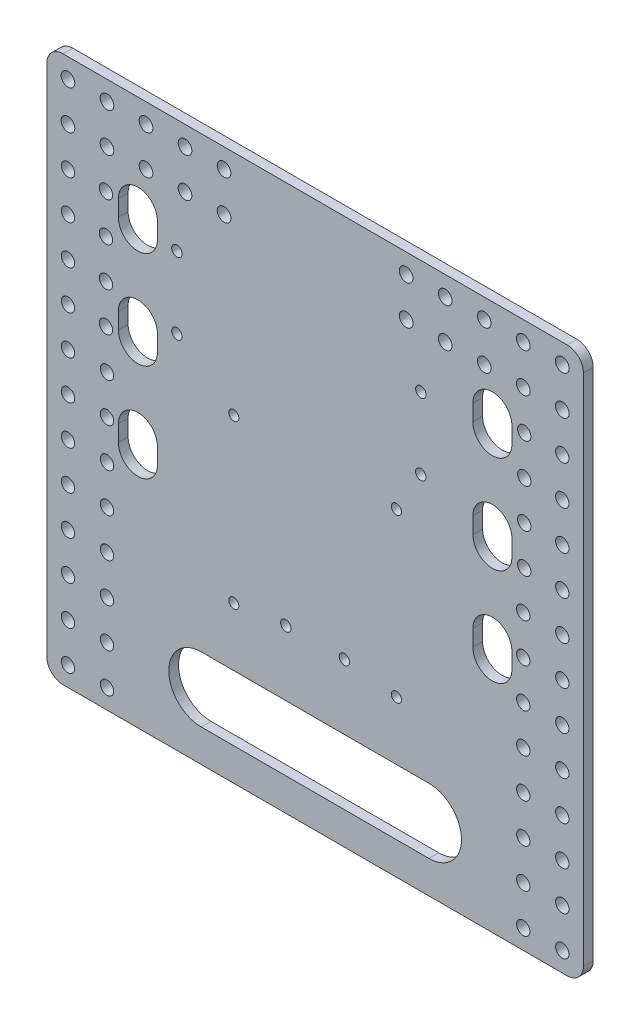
ISO-10303-21;
HEADER;
FILE_DESCRIPTION(('STEP AP214'),'2;1');
FILE_NAME('part.step','',(''),(''),'','','');
FILE_SCHEMA(('AUTOMOTIVE_DESIGN { 1 0 10303 214 1 1 1 1 }'));
ENDSEC;
DATA;
#1=APPLICATION_CONTEXT('core data for automotive mechanical design processes');
#2=APPLICATION_PROTOCOL_DEFINITION('international standard','automotive_design',2000,#1);
#3=PRODUCT_CONTEXT('',#1,'mechanical');
#4=PRODUCT('Part','Part','',(#3));
#5=PRODUCT_RELATED_PRODUCT_CATEGORY('part','',(#4));
#6=PRODUCT_DEFINITION_FORMATION('','',#4);
#7=PRODUCT_DEFINITION_CONTEXT('part definition',#1,'design');
#8=PRODUCT_DEFINITION('design','',#6,#7);
#9=PRODUCT_DEFINITION_SHAPE('','',#8);
#10=(LENGTH_UNIT() NAMED_UNIT(*) SI_UNIT(.MILLI.,.METRE.));
#11=(NAMED_UNIT(*) PLANE_ANGLE_UNIT() SI_UNIT($,.RADIAN.));
#12=(NAMED_UNIT(*) SI_UNIT($,.STERADIAN.) SOLID_ANGLE_UNIT());
#13=UNCERTAINTY_MEASURE_WITH_UNIT(LENGTH_MEASURE(1.E-05),#10,'distance_accuracy_value','');
#14=(GEOMETRIC_REPRESENTATION_CONTEXT(3) GLOBAL_UNCERTAINTY_ASSIGNED_CONTEXT((#13)) GLOBAL_UNIT_ASSIGNED_CONTEXT((#10,
#11,#12)) REPRESENTATION_CONTEXT('',''));
#15=CARTESIAN_POINT('',(0.,0.,0.));
#16=DIRECTION('',(0.,0.,1.));
#17=DIRECTION('',(1.,0.,0.));
#18=AXIS2_PLACEMENT_3D('',#15,#16,#17);
#19=CARTESIAN_POINT('',(0.,0.,3.));
#20=DIRECTION('',(0.,0.,-1.));
#21=DIRECTION('',(-1.,0.,0.));
#22=AXIS2_PLACEMENT_3D('',#19,#20,#21);
#23=PLANE('',#22);
#24=DIRECTION('',(0.,1.,0.));
#25=VECTOR('',#24,1.);
#26=CARTESIAN_POINT('',(-60.4999999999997,0.,3.));
#27=LINE('',#26,#25);
#28=CARTESIAN_POINT('',(-60.5,192.,3.));
#29=VERTEX_POINT('',#28);
#30=CARTESIAN_POINT('',(-60.4999999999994,197.,3.));
#31=VERTEX_POINT('',#30);
#32=EDGE_CURVE('E434',#29,#31,#27,.T.);
#33=ORIENTED_EDGE('',*,*,#32,.T.);
#34=CARTESIAN_POINT('',(-54.5000000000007,197.,3.));
#35=DIRECTION('',(0.,0.,-1.));
#36=DIRECTION('',(-1.,0.,0.));
#37=AXIS2_PLACEMENT_3D('',#34,#35,#36);
#38=CIRCLE('',#37,5.99999999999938);
#39=CARTESIAN_POINT('',(-48.5000000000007,197.,3.));
#40=VERTEX_POINT('',#39);
#41=EDGE_CURVE('E437',#31,#40,#38,.T.);
#42=ORIENTED_EDGE('',*,*,#41,.T.);
#43=DIRECTION('',(0.,-1.,0.));
#44=VECTOR('',#43,1.);
#45=CARTESIAN_POINT('',(-48.5000000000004,0.,3.));
#46=LINE('',#45,#44);
#47=CARTESIAN_POINT('',(-48.5000000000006,192.,3.));
#48=VERTEX_POINT('',#47);
#49=EDGE_CURVE('E428',#40,#48,#46,.T.);
#50=ORIENTED_EDGE('',*,*,#49,.T.);
#51=CARTESIAN_POINT('',(-54.5000000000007,192.,3.));
#52=DIRECTION('',(0.,0.,-1.));
#53=DIRECTION('',(-1.,0.,0.));
#54=AXIS2_PLACEMENT_3D('',#51,#52,#53);
#55=CIRCLE('',#54,5.99999999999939);
#56=EDGE_CURVE('E431',#48,#29,#55,.T.);
#57=ORIENTED_EDGE('',*,*,#56,.T.);
#58=EDGE_LOOP('',(#33,#42,#50,#57));
#59=FACE_BOUND('',#58,.T.);
#60=DIRECTION('',(0.,1.,0.));
#61=VECTOR('',#60,1.);
#62=CARTESIAN_POINT('',(48.4999999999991,0.,3.));
#63=LINE('',#62,#61);
#64=CARTESIAN_POINT('',(48.4999999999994,192.,3.));
#65=VERTEX_POINT('',#64);
#66=CARTESIAN_POINT('',(48.4999999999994,197.,3.));
#67=VERTEX_POINT('',#66);
#68=EDGE_CURVE('E422',#65,#67,#63,.T.);
#69=ORIENTED_EDGE('',*,*,#68,.T.);
#70=CARTESIAN_POINT('',(54.4999999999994,197.,3.));
#71=DIRECTION('',(0.,0.,-1.));
#72=DIRECTION('',(-1.,0.,0.));
#73=AXIS2_PLACEMENT_3D('',#70,#71,#72);
#74=CIRCLE('',#73,6.00000000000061);
#75=CARTESIAN_POINT('',(60.5000000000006,197.,3.));
#76=VERTEX_POINT('',#75);
#77=EDGE_CURVE('E425',#67,#76,#74,.T.);
#78=ORIENTED_EDGE('',*,*,#77,.T.);
#79=DIRECTION('',(0.,-1.,0.));
#80=VECTOR('',#79,1.);
#81=CARTESIAN_POINT('',(60.5000000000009,0.,3.));
#82=LINE('',#81,#80);
#83=CARTESIAN_POINT('',(60.5000000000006,192.,3.));
#84=VERTEX_POINT('',#83);
#85=EDGE_CURVE('E416',#76,#84,#82,.T.);
#86=ORIENTED_EDGE('',*,*,#85,.T.);
#87=CARTESIAN_POINT('',(54.4999999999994,192.,3.));
#88=DIRECTION('',(0.,0.,-1.));
#89=DIRECTION('',(-1.,0.,0.));
#90=AXIS2_PLACEMENT_3D('',#87,#88,#89);
#91=CIRCLE('',#90,6.00000000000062);
#92=EDGE_CURVE('E419',#84,#65,#91,.T.);
#93=ORIENTED_EDGE('',*,*,#92,.T.);
#94=EDGE_LOOP('',(#69,#78,#86,#93));
#95=FACE_BOUND('',#94,.T.);
#96=DIRECTION('',(0.,1.,0.));
#97=VECTOR('',#96,1.);
#98=CARTESIAN_POINT('',(-60.5,0.,3.));
#99=LINE('',#98,#97);
#100=CARTESIAN_POINT('',(-60.5,222.,3.));
#101=VERTEX_POINT('',#100);
#102=CARTESIAN_POINT('',(-60.4999999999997,227.,3.));
#103=VERTEX_POINT('',#102);
#104=EDGE_CURVE('E410',#101,#103,#99,.T.);
#105=ORIENTED_EDGE('',*,*,#104,.T.);
#106=CARTESIAN_POINT('',(-54.5000000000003,227.,3.));
#107=DIRECTION('',(0.,0.,-1.));
#108=DIRECTION('',(-1.,0.,0.));
#109=AXIS2_PLACEMENT_3D('',#106,#107,#108);
#110=CIRCLE('',#109,5.99999999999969);
#111=CARTESIAN_POINT('',(-48.5000000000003,227.,3.));
#112=VERTEX_POINT('',#111);
#113=EDGE_CURVE('E413',#103,#112,#110,.T.);
#114=ORIENTED_EDGE('',*,*,#113,.T.);
#115=DIRECTION('',(0.,-1.,0.));
#116=VECTOR('',#115,1.);
#117=CARTESIAN_POINT('',(-48.5,0.,3.));
#118=LINE('',#117,#116);
#119=CARTESIAN_POINT('',(-48.5000000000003,222.,3.));
#120=VERTEX_POINT('',#119);
#121=EDGE_CURVE('E407',#112,#120,#118,.T.);
#122=ORIENTED_EDGE('',*,*,#121,.T.);
#123=CARTESIAN_POINT('',(-54.5000000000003,222.,3.));
#124=DIRECTION('',(0.,0.,-1.));
#125=DIRECTION('',(-1.,0.,0.));
#126=AXIS2_PLACEMENT_3D('',#123,#124,#125);
#127=CIRCLE('',#126,5.99999999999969);
#128=EDGE_CURVE('E276',#120,#101,#127,.T.);
#129=ORIENTED_EDGE('',*,*,#128,.T.);
#130=EDGE_LOOP('',(#105,#114,#122,#129));
#131=FACE_BOUND('',#130,.T.);
#132=DIRECTION('',(0.,1.,0.));
#133=VECTOR('',#132,1.);
#134=CARTESIAN_POINT('',(48.4999999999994,0.,3.));
#135=LINE('',#134,#133);
#136=CARTESIAN_POINT('',(48.4999999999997,222.,3.));
#137=VERTEX_POINT('',#136);
#138=CARTESIAN_POINT('',(48.4999999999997,227.,3.));
#139=VERTEX_POINT('',#138);
#140=EDGE_CURVE('E401',#137,#139,#135,.T.);
#141=ORIENTED_EDGE('',*,*,#140,.T.);
#142=CARTESIAN_POINT('',(54.4999999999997,227.,3.));
#143=DIRECTION('',(0.,0.,-1.));
#144=DIRECTION('',(-1.,0.,0.));
#145=AXIS2_PLACEMENT_3D('',#142,#143,#144);
#146=CIRCLE('',#145,6.0000000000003);
#147=CARTESIAN_POINT('',(60.5000000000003,227.,3.));
#148=VERTEX_POINT('',#147);
#149=EDGE_CURVE('E404',#139,#148,#146,.T.);
#150=ORIENTED_EDGE('',*,*,#149,.T.);
#151=DIRECTION('',(0.,-1.,0.));
#152=VECTOR('',#151,1.);
#153=CARTESIAN_POINT('',(60.5000000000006,0.,3.));
#154=LINE('',#153,#152);
#155=CARTESIAN_POINT('',(60.5000000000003,222.,3.));
#156=VERTEX_POINT('',#155);
#157=EDGE_CURVE('E395',#148,#156,#154,.T.);
#158=ORIENTED_EDGE('',*,*,#157,.T.);
#159=CARTESIAN_POINT('',(54.4999999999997,222.,3.));
#160=DIRECTION('',(0.,0.,-1.));
#161=DIRECTION('',(-1.,0.,0.));
#162=AXIS2_PLACEMENT_3D('',#159,#160,#161);
#163=CIRCLE('',#162,6.00000000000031);
#164=EDGE_CURVE('E398',#156,#137,#163,.T.);
#165=ORIENTED_EDGE('',*,*,#164,.T.);
#166=EDGE_LOOP('',(#141,#150,#158,#165));
#167=FACE_BOUND('',#166,.T.);
#168=DIRECTION('',(0.,1.,0.));
#169=VECTOR('',#168,1.);
#170=CARTESIAN_POINT('',(-60.4999999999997,0.,3.));
#171=LINE('',#170,#169);
#172=CARTESIAN_POINT('',(-60.5,252.,3.));
#173=VERTEX_POINT('',#172);
#174=CARTESIAN_POINT('',(-60.5,257.,3.));
#175=VERTEX_POINT('',#174);
#176=EDGE_CURVE('E389',#173,#175,#171,.T.);
#177=ORIENTED_EDGE('',*,*,#176,.T.);
#178=CARTESIAN_POINT('',(-54.5,257.,3.));
#179=DIRECTION('',(0.,0.,-1.));
#180=DIRECTION('',(-1.,0.,0.));
#181=AXIS2_PLACEMENT_3D('',#178,#179,#180);
#182=CIRCLE('',#181,6.00000000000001);
#183=CARTESIAN_POINT('',(-48.5,257.,3.));
#184=VERTEX_POINT('',#183);
#185=EDGE_CURVE('E392',#175,#184,#182,.T.);
#186=ORIENTED_EDGE('',*,*,#185,.T.);
#187=DIRECTION('',(0.,-1.,0.));
#188=VECTOR('',#187,1.);
#189=CARTESIAN_POINT('',(-48.5000000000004,0.,3.));
#190=LINE('',#189,#188);
#191=CARTESIAN_POINT('',(-48.5,252.,3.));
#192=VERTEX_POINT('',#191);
#193=EDGE_CURVE('E359',#184,#192,#190,.T.);
#194=ORIENTED_EDGE('',*,*,#193,.T.);
#195=CARTESIAN_POINT('',(-54.5,252.,3.));
#196=DIRECTION('',(0.,0.,-1.));
#197=DIRECTION('',(-1.,0.,0.));
#198=AXIS2_PLACEMENT_3D('',#195,#196,#197);
#199=CIRCLE('',#198,6.);
#200=EDGE_CURVE('E386',#192,#173,#199,.T.);
#201=ORIENTED_EDGE('',*,*,#200,.T.);
#202=EDGE_LOOP('',(#177,#186,#194,#201));
#203=FACE_BOUND('',#202,.T.);
#204=DIRECTION('',(0.,1.,0.));
#205=VECTOR('',#204,1.);
#206=CARTESIAN_POINT('',(48.5000000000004,0.,3.));
#207=LINE('',#206,#205);
#208=CARTESIAN_POINT('',(48.5,252.,3.));
#209=VERTEX_POINT('',#208);
#210=CARTESIAN_POINT('',(48.5,257.,3.));
#211=VERTEX_POINT('',#210);
#212=EDGE_CURVE('E466',#209,#211,#207,.T.);
#213=ORIENTED_EDGE('',*,*,#212,.T.);
#214=CARTESIAN_POINT('',(54.5,257.,3.));
#215=DIRECTION('',(0.,0.,-1.));
#216=DIRECTION('',(-1.,0.,0.));
#217=AXIS2_PLACEMENT_3D('',#214,#215,#216);
#218=CIRCLE('',#217,6.00000000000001);
#219=CARTESIAN_POINT('',(60.5,257.,3.));
#220=VERTEX_POINT('',#219);
#221=EDGE_CURVE('E469',#211,#220,#218,.T.);
#222=ORIENTED_EDGE('',*,*,#221,.T.);
#223=DIRECTION('',(0.,-1.,0.));
#224=VECTOR('',#223,1.);
#225=CARTESIAN_POINT('',(60.4999999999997,0.,3.));
#226=LINE('',#225,#224);
#227=CARTESIAN_POINT('',(60.5,252.,3.));
#228=VERTEX_POINT('',#227);
#229=EDGE_CURVE('E454',#220,#228,#226,.T.);
#230=ORIENTED_EDGE('',*,*,#229,.T.);
#231=CARTESIAN_POINT('',(54.5,252.,3.));
#232=DIRECTION('',(0.,0.,-1.));
#233=DIRECTION('',(-1.,0.,0.));
#234=AXIS2_PLACEMENT_3D('',#231,#232,#233);
#235=CIRCLE('',#234,6.);
#236=EDGE_CURVE('E463',#228,#209,#235,.T.);
#237=ORIENTED_EDGE('',*,*,#236,.T.);
#238=EDGE_LOOP('',(#213,#222,#230,#237));
#239=FACE_BOUND('',#238,.T.);
#240=CARTESIAN_POINT('',(-64.3039308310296,220.996150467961,3.));
#241=DIRECTION('',(0.,0.,1.));
#242=DIRECTION('',(1.,0.,0.));
#243=AXIS2_PLACEMENT_3D('',#240,#241,#242);
#244=CIRCLE('',#243,2.04999999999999);
#245=CARTESIAN_POINT('',(-62.2539308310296,220.996150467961,3.));
#246=VERTEX_POINT('',#245);
#247=EDGE_CURVE('E473',#246,#246,#244,.T.);
#248=ORIENTED_EDGE('',*,*,#247,.F.);
#249=EDGE_LOOP('',(#248));
#250=FACE_BOUND('',#249,.T.);
#251=CARTESIAN_POINT('',(-76.0000000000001,233.,3.));
#252=DIRECTION('',(0.,0.,1.));
#253=DIRECTION('',(1.,0.,0.));
#254=AXIS2_PLACEMENT_3D('',#251,#252,#253);
#255=CIRCLE('',#254,2.04999999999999);
#256=CARTESIAN_POINT('',(-73.9500000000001,233.,3.));
#257=VERTEX_POINT('',#256);
#258=EDGE_CURVE('E477',#257,#257,#255,.T.);
#259=ORIENTED_EDGE('',*,*,#258,.F.);
#260=EDGE_LOOP('',(#259));
#261=FACE_BOUND('',#260,.T.);
#262=CARTESIAN_POINT('',(-64.3039308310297,232.996150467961,3.));
#263=DIRECTION('',(0.,0.,1.));
#264=DIRECTION('',(1.,0.,0.));
#265=AXIS2_PLACEMENT_3D('',#262,#263,#264);
#266=CIRCLE('',#265,2.04999999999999);
#267=CARTESIAN_POINT('',(-62.2539308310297,232.996150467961,3.));
#268=VERTEX_POINT('',#267);
#269=EDGE_CURVE('E480',#268,#268,#266,.T.);
#270=ORIENTED_EDGE('',*,*,#269,.F.);
#271=EDGE_LOOP('',(#270));
#272=FACE_BOUND('',#271,.T.);
#273=CARTESIAN_POINT('',(-76.0000000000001,245.,3.));
#274=DIRECTION('',(0.,0.,1.));
#275=DIRECTION('',(1.,0.,0.));
#276=AXIS2_PLACEMENT_3D('',#273,#274,#275);
#277=CIRCLE('',#276,2.04999999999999);
#278=CARTESIAN_POINT('',(-73.9500000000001,245.,3.));
#279=VERTEX_POINT('',#278);
#280=EDGE_CURVE('E483',#279,#279,#277,.T.);
#281=ORIENTED_EDGE('',*,*,#280,.F.);
#282=EDGE_LOOP('',(#281));
#283=FACE_BOUND('',#282,.T.);
#284=CARTESIAN_POINT('',(-64.3039308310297,244.996150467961,3.));
#285=DIRECTION('',(0.,0.,1.));
#286=DIRECTION('',(1.,0.,0.));
#287=AXIS2_PLACEMENT_3D('',#284,#285,#286);
#288=CIRCLE('',#287,2.04999999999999);
#289=CARTESIAN_POINT('',(-62.2539308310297,244.996150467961,3.));
#290=VERTEX_POINT('',#289);
#291=EDGE_CURVE('E486',#290,#290,#288,.T.);
#292=ORIENTED_EDGE('',*,*,#291,.F.);
#293=EDGE_LOOP('',(#292));
#294=FACE_BOUND('',#293,.T.);
#295=CARTESIAN_POINT('',(-76.0000000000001,257.,3.));
#296=DIRECTION('',(0.,0.,1.));
#297=DIRECTION('',(1.,0.,0.));
#298=AXIS2_PLACEMENT_3D('',#295,#296,#297);
#299=CIRCLE('',#298,2.05);
#300=CARTESIAN_POINT('',(-73.9500000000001,257.,3.));
#301=VERTEX_POINT('',#300);
#302=EDGE_CURVE('E489',#301,#301,#299,.T.);
#303=ORIENTED_EDGE('',*,*,#302,.F.);
#304=EDGE_LOOP('',(#303));
#305=FACE_BOUND('',#304,.T.);
#306=CARTESIAN_POINT('',(-64.3039308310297,256.996150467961,3.));
#307=DIRECTION('',(0.,0.,1.));
#308=DIRECTION('',(1.,0.,0.));
#309=AXIS2_PLACEMENT_3D('',#306,#307,#308);
#310=CIRCLE('',#309,2.05);
#311=CARTESIAN_POINT('',(-62.2539308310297,256.996150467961,3.));
#312=VERTEX_POINT('',#311);
#313=EDGE_CURVE('E492',#312,#312,#310,.T.);
#314=ORIENTED_EDGE('',*,*,#313,.F.);
#315=EDGE_LOOP('',(#314));
#316=FACE_BOUND('',#315,.T.);
#317=CARTESIAN_POINT('',(64.3039308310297,256.99615046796,3.));
#318=DIRECTION('',(0.,0.,1.));
#319=DIRECTION('',(-1.,0.,0.));
#320=AXIS2_PLACEMENT_3D('',#317,#318,#319);
#321=CIRCLE('',#320,2.05);
#322=CARTESIAN_POINT('',(62.2539308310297,256.99615046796,3.));
#323=VERTEX_POINT('',#322);
#324=EDGE_CURVE('E495',#323,#323,#321,.T.);
#325=ORIENTED_EDGE('',*,*,#324,.F.);
#326=EDGE_LOOP('',(#325));
#327=FACE_BOUND('',#326,.T.);
#328=CARTESIAN_POINT('',(76.0000000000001,257.,3.));
#329=DIRECTION('',(0.,0.,1.));
#330=DIRECTION('',(-1.,0.,0.));
#331=AXIS2_PLACEMENT_3D('',#328,#329,#330);
#332=CIRCLE('',#331,2.05000000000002);
#333=CARTESIAN_POINT('',(73.9500000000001,257.,3.));
#334=VERTEX_POINT('',#333);
#335=EDGE_CURVE('E498',#334,#334,#332,.T.);
#336=ORIENTED_EDGE('',*,*,#335,.F.);
#337=EDGE_LOOP('',(#336));
#338=FACE_BOUND('',#337,.T.);
#339=CARTESIAN_POINT('',(64.3039308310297,244.99615046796,3.));
#340=DIRECTION('',(0.,0.,1.));
#341=DIRECTION('',(-1.,0.,0.));
#342=AXIS2_PLACEMENT_3D('',#339,#340,#341);
#343=CIRCLE('',#342,2.04999999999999);
#344=CARTESIAN_POINT('',(62.2539308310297,244.99615046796,3.));
#345=VERTEX_POINT('',#344);
#346=EDGE_CURVE('E501',#345,#345,#343,.T.);
#347=ORIENTED_EDGE('',*,*,#346,.F.);
#348=EDGE_LOOP('',(#347));
#349=FACE_BOUND('',#348,.T.);
#350=CARTESIAN_POINT('',(76.0000000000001,245.,3.));
#351=DIRECTION('',(0.,0.,1.));
#352=DIRECTION('',(-1.,0.,0.));
#353=AXIS2_PLACEMENT_3D('',#350,#351,#352);
#354=CIRCLE('',#353,2.04999999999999);
#355=CARTESIAN_POINT('',(73.9500000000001,245.,3.));
#356=VERTEX_POINT('',#355);
#357=EDGE_CURVE('E504',#356,#356,#354,.T.);
#358=ORIENTED_EDGE('',*,*,#357,.F.);
#359=EDGE_LOOP('',(#358));
#360=FACE_BOUND('',#359,.T.);
#361=CARTESIAN_POINT('',(64.3039308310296,232.996150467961,3.));
#362=DIRECTION('',(0.,0.,1.));
#363=DIRECTION('',(-1.,0.,0.));
#364=AXIS2_PLACEMENT_3D('',#361,#362,#363);
#365=CIRCLE('',#364,2.04999999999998);
#366=CARTESIAN_POINT('',(62.2539308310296,232.996150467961,3.));
#367=VERTEX_POINT('',#366);
#368=EDGE_CURVE('E507',#367,#367,#365,.T.);
#369=ORIENTED_EDGE('',*,*,#368,.F.);
#370=EDGE_LOOP('',(#369));
#371=FACE_BOUND('',#370,.T.);
#372=CARTESIAN_POINT('',(76.,233.,3.));
#373=DIRECTION('',(0.,0.,1.));
#374=DIRECTION('',(-1.,0.,0.));
#375=AXIS2_PLACEMENT_3D('',#372,#373,#374);
#376=CIRCLE('',#375,2.04999999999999);
#377=CARTESIAN_POINT('',(73.95,233.,3.));
#378=VERTEX_POINT('',#377);
#379=EDGE_CURVE('E510',#378,#378,#376,.T.);
#380=ORIENTED_EDGE('',*,*,#379,.F.);
#381=EDGE_LOOP('',(#380));
#382=FACE_BOUND('',#381,.T.);
#383=CARTESIAN_POINT('',(64.3039308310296,220.99615046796,3.));
#384=DIRECTION('',(0.,0.,1.));
#385=DIRECTION('',(-1.,0.,0.));
#386=AXIS2_PLACEMENT_3D('',#383,#384,#385);
#387=CIRCLE('',#386,2.04999999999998);
#388=CARTESIAN_POINT('',(62.2539308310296,220.99615046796,3.));
#389=VERTEX_POINT('',#388);
#390=EDGE_CURVE('E513',#389,#389,#387,.T.);
#391=ORIENTED_EDGE('',*,*,#390,.F.);
#392=EDGE_LOOP('',(#391));
#393=FACE_BOUND('',#392,.T.);
#394=CARTESIAN_POINT('',(76.,221.,3.));
#395=DIRECTION('',(0.,0.,1.));
#396=DIRECTION('',(-1.,0.,0.));
#397=AXIS2_PLACEMENT_3D('',#394,#395,#396);
#398=CIRCLE('',#397,2.04999999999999);
#399=CARTESIAN_POINT('',(73.95,221.,3.));
#400=VERTEX_POINT('',#399);
#401=EDGE_CURVE('E472',#400,#400,#398,.T.);
#402=ORIENTED_EDGE('',*,*,#401,.F.);
#403=EDGE_LOOP('',(#402));
#404=FACE_BOUND('',#403,.T.);
#405=CARTESIAN_POINT('',(-76.,221.,3.));
#406=DIRECTION('',(0.,0.,1.));
#407=DIRECTION('',(1.,0.,0.));
#408=AXIS2_PLACEMENT_3D('',#405,#406,#407);
#409=CIRCLE('',#408,2.04999999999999);
#410=CARTESIAN_POINT('',(-73.95,221.,3.));
#411=VERTEX_POINT('',#410);
#412=EDGE_CURVE('E518',#411,#411,#409,.T.);
#413=ORIENTED_EDGE('',*,*,#412,.F.);
#414=EDGE_LOOP('',(#413));
#415=FACE_BOUND('',#414,.T.);
#416=CARTESIAN_POINT('',(-28.0000000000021,281.,3.));
#417=DIRECTION('',(0.,0.,-1.));
#418=DIRECTION('',(-1.,0.,0.));
#419=AXIS2_PLACEMENT_3D('',#416,#417,#418);
#420=CIRCLE('',#419,2.1);
#421=CARTESIAN_POINT('',(-30.1000000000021,281.,3.));
#422=VERTEX_POINT('',#421);
#423=EDGE_CURVE('E634',#422,#422,#420,.T.);
#424=ORIENTED_EDGE('',*,*,#423,.T.);
#425=EDGE_LOOP('',(#424));
#426=FACE_BOUND('',#425,.T.);
#427=CARTESIAN_POINT('',(-40.0000000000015,281.,3.));
#428=DIRECTION('',(0.,0.,-1.));
#429=DIRECTION('',(-1.,0.,0.));
#430=AXIS2_PLACEMENT_3D('',#427,#428,#429);
#431=CIRCLE('',#430,2.09999999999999);
#432=CARTESIAN_POINT('',(-42.1000000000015,281.,3.));
#433=VERTEX_POINT('',#432);
#434=EDGE_CURVE('E631',#433,#433,#431,.T.);
#435=ORIENTED_EDGE('',*,*,#434,.T.);
#436=EDGE_LOOP('',(#435));
#437=FACE_BOUND('',#436,.T.);
#438=CARTESIAN_POINT('',(-75.9999999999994,269.,3.));
#439=DIRECTION('',(0.,0.,-1.));
#440=DIRECTION('',(-1.,0.,0.));
#441=AXIS2_PLACEMENT_3D('',#438,#439,#440);
#442=CIRCLE('',#441,2.1);
#443=CARTESIAN_POINT('',(-78.0999999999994,269.,3.));
#444=VERTEX_POINT('',#443);
#445=EDGE_CURVE('E628',#444,#444,#442,.T.);
#446=ORIENTED_EDGE('',*,*,#445,.T.);
#447=EDGE_LOOP('',(#446));
#448=FACE_BOUND('',#447,.T.);
#449=CARTESIAN_POINT('',(-52.0000000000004,269.,3.));
#450=DIRECTION('',(0.,0.,-1.));
#451=DIRECTION('',(-1.,0.,0.));
#452=AXIS2_PLACEMENT_3D('',#449,#450,#451);
#453=CIRCLE('',#452,2.1);
#454=CARTESIAN_POINT('',(-54.1000000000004,269.,3.));
#455=VERTEX_POINT('',#454);
#456=EDGE_CURVE('E625',#455,#455,#453,.T.);
#457=ORIENTED_EDGE('',*,*,#456,.T.);
#458=EDGE_LOOP('',(#457));
#459=FACE_BOUND('',#458,.T.);
#460=CARTESIAN_POINT('',(-63.9999999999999,269.,3.));
#461=DIRECTION('',(0.,0.,-1.));
#462=DIRECTION('',(-1.,0.,0.));
#463=AXIS2_PLACEMENT_3D('',#460,#461,#462);
#464=CIRCLE('',#463,2.1);
#465=CARTESIAN_POINT('',(-66.0999999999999,269.,3.));
#466=VERTEX_POINT('',#465);
#467=EDGE_CURVE('E622',#466,#466,#464,.T.);
#468=ORIENTED_EDGE('',*,*,#467,.T.);
#469=EDGE_LOOP('',(#468));
#470=FACE_BOUND('',#469,.T.);
#471=CARTESIAN_POINT('',(28.0000000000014,269.,3.));
#472=DIRECTION('',(0.,0.,-1.));
#473=DIRECTION('',(-1.,0.,0.));
#474=AXIS2_PLACEMENT_3D('',#471,#472,#473);
#475=CIRCLE('',#474,2.1);
#476=CARTESIAN_POINT('',(25.9000000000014,269.,3.));
#477=VERTEX_POINT('',#476);
#478=EDGE_CURVE('E619',#477,#477,#475,.T.);
#479=ORIENTED_EDGE('',*,*,#478,.T.);
#480=EDGE_LOOP('',(#479));
#481=FACE_BOUND('',#480,.T.);
#482=CARTESIAN_POINT('',(40.0000000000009,269.,3.));
#483=DIRECTION('',(0.,0.,-1.));
#484=DIRECTION('',(-1.,0.,0.));
#485=AXIS2_PLACEMENT_3D('',#482,#483,#484);
#486=CIRCLE('',#485,2.09999999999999);
#487=CARTESIAN_POINT('',(37.9000000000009,269.,3.));
#488=VERTEX_POINT('',#487);
#489=EDGE_CURVE('E616',#488,#488,#486,.T.);
#490=ORIENTED_EDGE('',*,*,#489,.T.);
#491=EDGE_LOOP('',(#490));
#492=FACE_BOUND('',#491,.T.);
#493=CARTESIAN_POINT('',(-76.,281.,3.));
#494=DIRECTION('',(0.,0.,-1.));
#495=DIRECTION('',(-1.,0.,0.));
#496=AXIS2_PLACEMENT_3D('',#493,#494,#495);
#497=CIRCLE('',#496,2.1);
#498=CARTESIAN_POINT('',(-78.1,281.,3.));
#499=VERTEX_POINT('',#498);
#500=EDGE_CURVE('E613',#499,#499,#497,.T.);
#501=ORIENTED_EDGE('',*,*,#500,.T.);
#502=EDGE_LOOP('',(#501));
#503=FACE_BOUND('',#502,.T.);
#504=CARTESIAN_POINT('',(-64.0000000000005,281.,3.));
#505=DIRECTION('',(0.,0.,-1.));
#506=DIRECTION('',(-1.,0.,0.));
#507=AXIS2_PLACEMENT_3D('',#504,#505,#506);
#508=CIRCLE('',#507,2.1);
#509=CARTESIAN_POINT('',(-66.1000000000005,281.,3.));
#510=VERTEX_POINT('',#509);
#511=EDGE_CURVE('E610',#510,#510,#508,.T.);
#512=ORIENTED_EDGE('',*,*,#511,.T.);
#513=EDGE_LOOP('',(#512));
#514=FACE_BOUND('',#513,.T.);
#515=CARTESIAN_POINT('',(-52.000000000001,281.,3.));
#516=DIRECTION('',(0.,0.,-1.));
#517=DIRECTION('',(-1.,0.,0.));
#518=AXIS2_PLACEMENT_3D('',#515,#516,#517);
#519=CIRCLE('',#518,2.1);
#520=CARTESIAN_POINT('',(-54.100000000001,281.,3.));
#521=VERTEX_POINT('',#520);
#522=EDGE_CURVE('E607',#521,#521,#519,.T.);
#523=ORIENTED_EDGE('',*,*,#522,.T.);
#524=EDGE_LOOP('',(#523));
#525=FACE_BOUND('',#524,.T.);
#526=CARTESIAN_POINT('',(64.0000000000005,281.,3.));
#527=DIRECTION('',(0.,0.,-1.));
#528=DIRECTION('',(-1.,0.,0.));
#529=AXIS2_PLACEMENT_3D('',#526,#527,#528);
#530=CIRCLE('',#529,2.1);
#531=CARTESIAN_POINT('',(61.9000000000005,281.,3.));
#532=VERTEX_POINT('',#531);
#533=EDGE_CURVE('E604',#532,#532,#530,.T.);
#534=ORIENTED_EDGE('',*,*,#533,.T.);
#535=EDGE_LOOP('',(#534));
#536=FACE_BOUND('',#535,.T.);
#537=CARTESIAN_POINT('',(52.000000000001,281.,3.));
#538=DIRECTION('',(0.,0.,-1.));
#539=DIRECTION('',(-1.,0.,0.));
#540=AXIS2_PLACEMENT_3D('',#537,#538,#539);
#541=CIRCLE('',#540,2.1);
#542=CARTESIAN_POINT('',(49.900000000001,281.,3.));
#543=VERTEX_POINT('',#542);
#544=EDGE_CURVE('E601',#543,#543,#541,.T.);
#545=ORIENTED_EDGE('',*,*,#544,.T.);
#546=EDGE_LOOP('',(#545));
#547=FACE_BOUND('',#546,.T.);
#548=CARTESIAN_POINT('',(63.9999999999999,269.,3.));
#549=DIRECTION('',(0.,0.,-1.));
#550=DIRECTION('',(-1.,0.,0.));
#551=AXIS2_PLACEMENT_3D('',#548,#549,#550);
#552=CIRCLE('',#551,2.1);
#553=CARTESIAN_POINT('',(61.8999999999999,269.,3.));
#554=VERTEX_POINT('',#553);
#555=EDGE_CURVE('E598',#554,#554,#552,.T.);
#556=ORIENTED_EDGE('',*,*,#555,.T.);
#557=EDGE_LOOP('',(#556));
#558=FACE_BOUND('',#557,.T.);
#559=CARTESIAN_POINT('',(52.0000000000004,269.,3.));
#560=DIRECTION('',(0.,0.,-1.));
#561=DIRECTION('',(-1.,0.,0.));
#562=AXIS2_PLACEMENT_3D('',#559,#560,#561);
#563=CIRCLE('',#562,2.1);
#564=CARTESIAN_POINT('',(49.9000000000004,269.,3.));
#565=VERTEX_POINT('',#564);
#566=EDGE_CURVE('E595',#565,#565,#563,.T.);
#567=ORIENTED_EDGE('',*,*,#566,.T.);
#568=EDGE_LOOP('',(#567));
#569=FACE_BOUND('',#568,.T.);
#570=CARTESIAN_POINT('',(28.0000000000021,281.,3.));
#571=DIRECTION('',(0.,0.,-1.));
#572=DIRECTION('',(-1.,0.,0.));
#573=AXIS2_PLACEMENT_3D('',#570,#571,#572);
#574=CIRCLE('',#573,2.1);
#575=CARTESIAN_POINT('',(25.9000000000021,281.,3.));
#576=VERTEX_POINT('',#575);
#577=EDGE_CURVE('E592',#576,#576,#574,.T.);
#578=ORIENTED_EDGE('',*,*,#577,.T.);
#579=EDGE_LOOP('',(#578));
#580=FACE_BOUND('',#579,.T.);
#581=CARTESIAN_POINT('',(40.0000000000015,281.,3.));
#582=DIRECTION('',(0.,0.,-1.));
#583=DIRECTION('',(-1.,0.,0.));
#584=AXIS2_PLACEMENT_3D('',#581,#582,#583);
#585=CIRCLE('',#584,2.09999999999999);
#586=CARTESIAN_POINT('',(37.9000000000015,281.,3.));
#587=VERTEX_POINT('',#586);
#588=EDGE_CURVE('E589',#587,#587,#585,.T.);
#589=ORIENTED_EDGE('',*,*,#588,.T.);
#590=EDGE_LOOP('',(#589));
#591=FACE_BOUND('',#590,.T.);
#592=CARTESIAN_POINT('',(-40.0000000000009,269.,3.));
#593=DIRECTION('',(0.,0.,-1.));
#594=DIRECTION('',(-1.,0.,0.));
#595=AXIS2_PLACEMENT_3D('',#592,#593,#594);
#596=CIRCLE('',#595,2.09999999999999);
#597=CARTESIAN_POINT('',(-42.1000000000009,269.,3.));
#598=VERTEX_POINT('',#597);
#599=EDGE_CURVE('E586',#598,#598,#596,.T.);
#600=ORIENTED_EDGE('',*,*,#599,.T.);
#601=EDGE_LOOP('',(#600));
#602=FACE_BOUND('',#601,.T.);
#603=CARTESIAN_POINT('',(-28.0000000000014,269.,3.));
#604=DIRECTION('',(0.,0.,-1.));
#605=DIRECTION('',(-1.,0.,0.));
#606=AXIS2_PLACEMENT_3D('',#603,#604,#605);
#607=CIRCLE('',#606,2.1);
#608=CARTESIAN_POINT('',(-30.1000000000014,269.,3.));
#609=VERTEX_POINT('',#608);
#610=EDGE_CURVE('E583',#609,#609,#607,.T.);
#611=ORIENTED_EDGE('',*,*,#610,.T.);
#612=EDGE_LOOP('',(#611));
#613=FACE_BOUND('',#612,.T.);
#614=CARTESIAN_POINT('',(75.9999999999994,269.,3.));
#615=DIRECTION('',(0.,0.,-1.));
#616=DIRECTION('',(-1.,0.,0.));
#617=AXIS2_PLACEMENT_3D('',#614,#615,#616);
#618=CIRCLE('',#617,2.1);
#619=CARTESIAN_POINT('',(73.8999999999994,269.,3.));
#620=VERTEX_POINT('',#619);
#621=EDGE_CURVE('E572',#620,#620,#618,.T.);
#622=ORIENTED_EDGE('',*,*,#621,.T.);
#623=EDGE_LOOP('',(#622));
#624=FACE_BOUND('',#623,.T.);
#625=CARTESIAN_POINT('',(76.,281.,3.));
#626=DIRECTION('',(0.,0.,-1.));
#627=DIRECTION('',(-1.,0.,0.));
#628=AXIS2_PLACEMENT_3D('',#625,#626,#627);
#629=CIRCLE('',#628,2.1);
#630=CARTESIAN_POINT('',(73.9,281.,3.));
#631=VERTEX_POINT('',#630);
#632=EDGE_CURVE('E640',#631,#631,#629,.T.);
#633=ORIENTED_EDGE('',*,*,#632,.T.);
#634=EDGE_LOOP('',(#633));
#635=FACE_BOUND('',#634,.T.);
#636=DIRECTION('',(1.,0.,0.));
#637=VECTOR('',#636,1.);
#638=CARTESIAN_POINT('',(-35.,129.,3.));
#639=LINE('',#638,#637);
#640=CARTESIAN_POINT('',(-35.,129.,3.));
#641=VERTEX_POINT('',#640);
#642=CARTESIAN_POINT('',(35.,129.,3.));
#643=VERTEX_POINT('',#642);
#644=EDGE_CURVE('E645',#641,#643,#639,.T.);
#645=ORIENTED_EDGE('',*,*,#644,.F.);
#646=CARTESIAN_POINT('',(-35.,139.,3.));
#647=DIRECTION('',(0.,0.,1.));
#648=DIRECTION('',(1.,0.,0.));
#649=AXIS2_PLACEMENT_3D('',#646,#647,#648);
#650=CIRCLE('',#649,10.);
#651=CARTESIAN_POINT('',(-35.,149.,3.));
#652=VERTEX_POINT('',#651);
#653=EDGE_CURVE('E643',#652,#641,#650,.T.);
#654=ORIENTED_EDGE('',*,*,#653,.F.);
#655=DIRECTION('',(-1.,0.,0.));
#656=VECTOR('',#655,1.);
#657=CARTESIAN_POINT('',(-35.,149.,3.));
#658=LINE('',#657,#656);
#659=CARTESIAN_POINT('',(35.,149.,3.));
#660=VERTEX_POINT('',#659);
#661=EDGE_CURVE('E651',#660,#652,#658,.T.);
#662=ORIENTED_EDGE('',*,*,#661,.F.);
#663=CARTESIAN_POINT('',(35.,139.,3.));
#664=DIRECTION('',(0.,0.,1.));
#665=DIRECTION('',(1.,0.,0.));
#666=AXIS2_PLACEMENT_3D('',#663,#664,#665);
#667=CIRCLE('',#666,10.);
#668=EDGE_CURVE('E648',#643,#660,#667,.T.);
#669=ORIENTED_EDGE('',*,*,#668,.F.);
#670=EDGE_LOOP('',(#645,#654,#662,#669));
#671=FACE_BOUND('',#670,.T.);
#672=CARTESIAN_POINT('',(-64.,209.,3.));
#673=DIRECTION('',(0.,0.,1.));
#674=DIRECTION('',(-1.,0.,0.));
#675=AXIS2_PLACEMENT_3D('',#672,#673,#674);
#676=CIRCLE('',#675,2.04999999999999);
#677=CARTESIAN_POINT('',(-66.05,209.,3.));
#678=VERTEX_POINT('',#677);
#679=EDGE_CURVE('E666',#678,#678,#676,.T.);
#680=ORIENTED_EDGE('',*,*,#679,.F.);
#681=EDGE_LOOP('',(#680));
#682=FACE_BOUND('',#681,.T.);
#683=CARTESIAN_POINT('',(76.,209.,3.));
#684=DIRECTION('',(0.,0.,1.));
#685=DIRECTION('',(-1.,0.,0.));
#686=AXIS2_PLACEMENT_3D('',#683,#684,#685);
#687=CIRCLE('',#686,2.04999999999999);
#688=CARTESIAN_POINT('',(73.95,209.,3.));
#689=VERTEX_POINT('',#688);
#690=EDGE_CURVE('E670',#689,#689,#687,.T.);
#691=ORIENTED_EDGE('',*,*,#690,.F.);
#692=EDGE_LOOP('',(#691));
#693=FACE_BOUND('',#692,.T.);
#694=CARTESIAN_POINT('',(64.,209.,3.));
#695=DIRECTION('',(0.,0.,1.));
#696=DIRECTION('',(1.,0.,0.));
#697=AXIS2_PLACEMENT_3D('',#694,#695,#696);
#698=CIRCLE('',#697,2.04999999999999);
#699=CARTESIAN_POINT('',(66.05,209.,3.));
#700=VERTEX_POINT('',#699);
#701=EDGE_CURVE('E673',#700,#700,#698,.T.);
#702=ORIENTED_EDGE('',*,*,#701,.F.);
#703=EDGE_LOOP('',(#702));
#704=FACE_BOUND('',#703,.T.);
#705=CARTESIAN_POINT('',(-75.9999999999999,197.,3.));
#706=DIRECTION('',(0.,0.,1.));
#707=DIRECTION('',(1.,0.,0.));
#708=AXIS2_PLACEMENT_3D('',#705,#706,#707);
#709=CIRCLE('',#708,2.04999999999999);
#710=CARTESIAN_POINT('',(-73.9499999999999,197.,3.));
#711=VERTEX_POINT('',#710);
#712=EDGE_CURVE('E676',#711,#711,#709,.T.);
#713=ORIENTED_EDGE('',*,*,#712,.F.);
#714=EDGE_LOOP('',(#713));
#715=FACE_BOUND('',#714,.T.);
#716=CARTESIAN_POINT('',(-63.9999999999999,197.,3.));
#717=DIRECTION('',(0.,0.,1.));
#718=DIRECTION('',(-1.,0.,0.));
#719=AXIS2_PLACEMENT_3D('',#716,#717,#718);
#720=CIRCLE('',#719,2.04999999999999);
#721=CARTESIAN_POINT('',(-66.0499999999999,197.,3.));
#722=VERTEX_POINT('',#721);
#723=EDGE_CURVE('E679',#722,#722,#720,.T.);
#724=ORIENTED_EDGE('',*,*,#723,.F.);
#725=EDGE_LOOP('',(#724));
#726=FACE_BOUND('',#725,.T.);
#727=CARTESIAN_POINT('',(76.0000000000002,197.,3.));
#728=DIRECTION('',(0.,0.,1.));
#729=DIRECTION('',(-1.,0.,0.));
#730=AXIS2_PLACEMENT_3D('',#727,#728,#729);
#731=CIRCLE('',#730,2.04999999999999);
#732=CARTESIAN_POINT('',(73.9500000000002,197.,3.));
#733=VERTEX_POINT('',#732);
#734=EDGE_CURVE('E682',#733,#733,#731,.T.);
#735=ORIENTED_EDGE('',*,*,#734,.F.);
#736=EDGE_LOOP('',(#735));
#737=FACE_BOUND('',#736,.T.);
#738=CARTESIAN_POINT('',(64.0000000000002,197.,3.));
#739=DIRECTION('',(0.,0.,1.));
#740=DIRECTION('',(1.,0.,0.));
#741=AXIS2_PLACEMENT_3D('',#738,#739,#740);
#742=CIRCLE('',#741,2.04999999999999);
#743=CARTESIAN_POINT('',(66.0500000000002,197.,3.));
#744=VERTEX_POINT('',#743);
#745=EDGE_CURVE('E685',#744,#744,#742,.T.);
#746=ORIENTED_EDGE('',*,*,#745,.F.);
#747=EDGE_LOOP('',(#746));
#748=FACE_BOUND('',#747,.T.);
#749=CARTESIAN_POINT('',(-75.9999999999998,185.,3.));
#750=DIRECTION('',(0.,0.,1.));
#751=DIRECTION('',(1.,0.,0.));
#752=AXIS2_PLACEMENT_3D('',#749,#750,#751);
#753=CIRCLE('',#752,2.04999999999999);
#754=CARTESIAN_POINT('',(-73.9499999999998,185.,3.));
#755=VERTEX_POINT('',#754);
#756=EDGE_CURVE('E688',#755,#755,#753,.T.);
#757=ORIENTED_EDGE('',*,*,#756,.F.);
#758=EDGE_LOOP('',(#757));
#759=FACE_BOUND('',#758,.T.);
#760=CARTESIAN_POINT('',(-63.9999999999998,185.,3.));
#761=DIRECTION('',(0.,0.,1.));
#762=DIRECTION('',(-1.,0.,0.));
#763=AXIS2_PLACEMENT_3D('',#760,#761,#762);
#764=CIRCLE('',#763,2.04999999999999);
#765=CARTESIAN_POINT('',(-66.0499999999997,185.,3.));
#766=VERTEX_POINT('',#765);
#767=EDGE_CURVE('E691',#766,#766,#764,.T.);
#768=ORIENTED_EDGE('',*,*,#767,.F.);
#769=EDGE_LOOP('',(#768));
#770=FACE_BOUND('',#769,.T.);
#771=CARTESIAN_POINT('',(76.0000000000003,185.,3.));
#772=DIRECTION('',(0.,0.,1.));
#773=DIRECTION('',(-1.,0.,0.));
#774=AXIS2_PLACEMENT_3D('',#771,#772,#773);
#775=CIRCLE('',#774,2.04999999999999);
#776=CARTESIAN_POINT('',(73.9500000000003,185.,3.));
#777=VERTEX_POINT('',#776);
#778=EDGE_CURVE('E694',#777,#777,#775,.T.);
#779=ORIENTED_EDGE('',*,*,#778,.F.);
#780=EDGE_LOOP('',(#779));
#781=FACE_BOUND('',#780,.T.);
#782=CARTESIAN_POINT('',(64.0000000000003,185.,3.));
#783=DIRECTION('',(0.,0.,1.));
#784=DIRECTION('',(1.,0.,0.));
#785=AXIS2_PLACEMENT_3D('',#782,#783,#784);
#786=CIRCLE('',#785,2.04999999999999);
#787=CARTESIAN_POINT('',(66.0500000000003,185.,3.));
#788=VERTEX_POINT('',#787);
#789=EDGE_CURVE('E697',#788,#788,#786,.T.);
#790=ORIENTED_EDGE('',*,*,#789,.F.);
#791=EDGE_LOOP('',(#790));
#792=FACE_BOUND('',#791,.T.);
#793=CARTESIAN_POINT('',(-75.9999999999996,173.,3.));
#794=DIRECTION('',(0.,0.,1.));
#795=DIRECTION('',(1.,0.,0.));
#796=AXIS2_PLACEMENT_3D('',#793,#794,#795);
#797=CIRCLE('',#796,2.04999999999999);
#798=CARTESIAN_POINT('',(-73.9499999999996,173.,3.));
#799=VERTEX_POINT('',#798);
#800=EDGE_CURVE('E700',#799,#799,#797,.T.);
#801=ORIENTED_EDGE('',*,*,#800,.F.);
#802=EDGE_LOOP('',(#801));
#803=FACE_BOUND('',#802,.T.);
#804=CARTESIAN_POINT('',(-63.9999999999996,173.,3.));
#805=DIRECTION('',(0.,0.,1.));
#806=DIRECTION('',(-1.,0.,0.));
#807=AXIS2_PLACEMENT_3D('',#804,#805,#806);
#808=CIRCLE('',#807,2.04999999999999);
#809=CARTESIAN_POINT('',(-66.0499999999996,173.,3.));
#810=VERTEX_POINT('',#809);
#811=EDGE_CURVE('E703',#810,#810,#808,.T.);
#812=ORIENTED_EDGE('',*,*,#811,.F.);
#813=EDGE_LOOP('',(#812));
#814=FACE_BOUND('',#813,.T.);
#815=CARTESIAN_POINT('',(76.0000000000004,173.,3.));
#816=DIRECTION('',(0.,0.,1.));
#817=DIRECTION('',(-1.,0.,0.));
#818=AXIS2_PLACEMENT_3D('',#815,#816,#817);
#819=CIRCLE('',#818,2.04999999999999);
#820=CARTESIAN_POINT('',(73.9500000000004,173.,3.));
#821=VERTEX_POINT('',#820);
#822=EDGE_CURVE('E706',#821,#821,#819,.T.);
#823=ORIENTED_EDGE('',*,*,#822,.F.);
#824=EDGE_LOOP('',(#823));
#825=FACE_BOUND('',#824,.T.);
#826=CARTESIAN_POINT('',(64.0000000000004,173.,3.));
#827=DIRECTION('',(0.,0.,1.));
#828=DIRECTION('',(1.,0.,0.));
#829=AXIS2_PLACEMENT_3D('',#826,#827,#828);
#830=CIRCLE('',#829,2.04999999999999);
#831=CARTESIAN_POINT('',(66.0500000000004,173.,3.));
#832=VERTEX_POINT('',#831);
#833=EDGE_CURVE('E709',#832,#832,#830,.T.);
#834=ORIENTED_EDGE('',*,*,#833,.F.);
#835=EDGE_LOOP('',(#834));
#836=FACE_BOUND('',#835,.T.);
#837=CARTESIAN_POINT('',(-75.9999999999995,161.,3.));
#838=DIRECTION('',(0.,0.,1.));
#839=DIRECTION('',(1.,0.,0.));
#840=AXIS2_PLACEMENT_3D('',#837,#838,#839);
#841=CIRCLE('',#840,2.04999999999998);
#842=CARTESIAN_POINT('',(-73.9499999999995,161.,3.));
#843=VERTEX_POINT('',#842);
#844=EDGE_CURVE('E712',#843,#843,#841,.T.);
#845=ORIENTED_EDGE('',*,*,#844,.F.);
#846=EDGE_LOOP('',(#845));
#847=FACE_BOUND('',#846,.T.);
#848=CARTESIAN_POINT('',(-63.9999999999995,161.,3.));
#849=DIRECTION('',(0.,0.,1.));
#850=DIRECTION('',(-1.,0.,0.));
#851=AXIS2_PLACEMENT_3D('',#848,#849,#850);
#852=CIRCLE('',#851,2.04999999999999);
#853=CARTESIAN_POINT('',(-66.0499999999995,161.,3.));
#854=VERTEX_POINT('',#853);
#855=EDGE_CURVE('E715',#854,#854,#852,.T.);
#856=ORIENTED_EDGE('',*,*,#855,.F.);
#857=EDGE_LOOP('',(#856));
#858=FACE_BOUND('',#857,.T.);
#859=CARTESIAN_POINT('',(76.0000000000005,161.,3.));
#860=DIRECTION('',(0.,0.,1.));
#861=DIRECTION('',(-1.,0.,0.));
#862=AXIS2_PLACEMENT_3D('',#859,#860,#861);
#863=CIRCLE('',#862,2.04999999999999);
#864=CARTESIAN_POINT('',(73.9500000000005,161.,3.));
#865=VERTEX_POINT('',#864);
#866=EDGE_CURVE('E718',#865,#865,#863,.T.);
#867=ORIENTED_EDGE('',*,*,#866,.F.);
#868=EDGE_LOOP('',(#867));
#869=FACE_BOUND('',#868,.T.);
#870=CARTESIAN_POINT('',(64.0000000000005,161.,3.));
#871=DIRECTION('',(0.,0.,1.));
#872=DIRECTION('',(1.,0.,0.));
#873=AXIS2_PLACEMENT_3D('',#870,#871,#872);
#874=CIRCLE('',#873,2.04999999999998);
#875=CARTESIAN_POINT('',(66.0500000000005,161.,3.));
#876=VERTEX_POINT('',#875);
#877=EDGE_CURVE('E721',#876,#876,#874,.T.);
#878=ORIENTED_EDGE('',*,*,#877,.F.);
#879=EDGE_LOOP('',(#878));
#880=FACE_BOUND('',#879,.T.);
#881=CARTESIAN_POINT('',(-75.9999999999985,149.,3.));
#882=DIRECTION('',(0.,0.,1.));
#883=DIRECTION('',(1.,0.,0.));
#884=AXIS2_PLACEMENT_3D('',#881,#882,#883);
#885=CIRCLE('',#884,2.04999999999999);
#886=CARTESIAN_POINT('',(-73.9499999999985,149.,3.));
#887=VERTEX_POINT('',#886);
#888=EDGE_CURVE('E724',#887,#887,#885,.T.);
#889=ORIENTED_EDGE('',*,*,#888,.F.);
#890=EDGE_LOOP('',(#889));
#891=FACE_BOUND('',#890,.T.);
#892=CARTESIAN_POINT('',(-63.9999999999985,149.,3.));
#893=DIRECTION('',(0.,0.,1.));
#894=DIRECTION('',(-1.,0.,0.));
#895=AXIS2_PLACEMENT_3D('',#892,#893,#894);
#896=CIRCLE('',#895,2.04999999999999);
#897=CARTESIAN_POINT('',(-66.0499999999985,149.,3.));
#898=VERTEX_POINT('',#897);
#899=EDGE_CURVE('E727',#898,#898,#896,.T.);
#900=ORIENTED_EDGE('',*,*,#899,.F.);
#901=EDGE_LOOP('',(#900));
#902=FACE_BOUND('',#901,.T.);
#903=CARTESIAN_POINT('',(76.0000000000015,149.,3.));
#904=DIRECTION('',(0.,0.,1.));
#905=DIRECTION('',(-1.,0.,0.));
#906=AXIS2_PLACEMENT_3D('',#903,#904,#905);
#907=CIRCLE('',#906,2.04999999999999);
#908=CARTESIAN_POINT('',(73.9500000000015,149.,3.));
#909=VERTEX_POINT('',#908);
#910=EDGE_CURVE('E730',#909,#909,#907,.T.);
#911=ORIENTED_EDGE('',*,*,#910,.F.);
#912=EDGE_LOOP('',(#911));
#913=FACE_BOUND('',#912,.T.);
#914=CARTESIAN_POINT('',(64.0000000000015,149.,3.));
#915=DIRECTION('',(0.,0.,1.));
#916=DIRECTION('',(1.,0.,0.));
#917=AXIS2_PLACEMENT_3D('',#914,#915,#916);
#918=CIRCLE('',#917,2.04999999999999);
#919=CARTESIAN_POINT('',(66.0500000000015,149.,3.));
#920=VERTEX_POINT('',#919);
#921=EDGE_CURVE('E733',#920,#920,#918,.T.);
#922=ORIENTED_EDGE('',*,*,#921,.F.);
#923=EDGE_LOOP('',(#922));
#924=FACE_BOUND('',#923,.T.);
#925=CARTESIAN_POINT('',(-75.9999999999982,137.,3.));
#926=DIRECTION('',(0.,0.,1.));
#927=DIRECTION('',(1.,0.,0.));
#928=AXIS2_PLACEMENT_3D('',#925,#926,#927);
#929=CIRCLE('',#928,2.04999999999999);
#930=CARTESIAN_POINT('',(-73.9499999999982,137.,3.));
#931=VERTEX_POINT('',#930);
#932=EDGE_CURVE('E736',#931,#931,#929,.T.);
#933=ORIENTED_EDGE('',*,*,#932,.F.);
#934=EDGE_LOOP('',(#933));
#935=FACE_BOUND('',#934,.T.);
#936=CARTESIAN_POINT('',(-63.9999999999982,137.,3.));
#937=DIRECTION('',(0.,0.,1.));
#938=DIRECTION('',(-1.,0.,0.));
#939=AXIS2_PLACEMENT_3D('',#936,#937,#938);
#940=CIRCLE('',#939,2.04999999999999);
#941=CARTESIAN_POINT('',(-66.0499999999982,137.,3.));
#942=VERTEX_POINT('',#941);
#943=EDGE_CURVE('E739',#942,#942,#940,.T.);
#944=ORIENTED_EDGE('',*,*,#943,.F.);
#945=EDGE_LOOP('',(#944));
#946=FACE_BOUND('',#945,.T.);
#947=CARTESIAN_POINT('',(76.0000000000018,137.,3.));
#948=DIRECTION('',(0.,0.,1.));
#949=DIRECTION('',(-1.,0.,0.));
#950=AXIS2_PLACEMENT_3D('',#947,#948,#949);
#951=CIRCLE('',#950,2.04999999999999);
#952=CARTESIAN_POINT('',(73.9500000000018,137.,3.));
#953=VERTEX_POINT('',#952);
#954=EDGE_CURVE('E742',#953,#953,#951,.T.);
#955=ORIENTED_EDGE('',*,*,#954,.F.);
#956=EDGE_LOOP('',(#955));
#957=FACE_BOUND('',#956,.T.);
#958=CARTESIAN_POINT('',(64.0000000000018,137.,3.));
#959=DIRECTION('',(0.,0.,1.));
#960=DIRECTION('',(1.,0.,0.));
#961=AXIS2_PLACEMENT_3D('',#958,#959,#960);
#962=CIRCLE('',#961,2.04999999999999);
#963=CARTESIAN_POINT('',(66.0500000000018,137.,3.));
#964=VERTEX_POINT('',#963);
#965=EDGE_CURVE('E745',#964,#964,#962,.T.);
#966=ORIENTED_EDGE('',*,*,#965,.F.);
#967=EDGE_LOOP('',(#966));
#968=FACE_BOUND('',#967,.T.);
#969=CARTESIAN_POINT('',(-75.9999999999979,125.,3.));
#970=DIRECTION('',(0.,0.,1.));
#971=DIRECTION('',(1.,0.,0.));
#972=AXIS2_PLACEMENT_3D('',#969,#970,#971);
#973=CIRCLE('',#972,2.04999999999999);
#974=CARTESIAN_POINT('',(-73.9499999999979,125.,3.));
#975=VERTEX_POINT('',#974);
#976=EDGE_CURVE('E748',#975,#975,#973,.T.);
#977=ORIENTED_EDGE('',*,*,#976,.F.);
#978=EDGE_LOOP('',(#977));
#979=FACE_BOUND('',#978,.T.);
#980=CARTESIAN_POINT('',(-63.9999999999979,125.,3.));
#981=DIRECTION('',(0.,0.,1.));
#982=DIRECTION('',(-1.,0.,0.));
#983=AXIS2_PLACEMENT_3D('',#980,#981,#982);
#984=CIRCLE('',#983,2.05);
#985=CARTESIAN_POINT('',(-66.0499999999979,125.,3.));
#986=VERTEX_POINT('',#985);
#987=EDGE_CURVE('E751',#986,#986,#984,.T.);
#988=ORIENTED_EDGE('',*,*,#987,.F.);
#989=EDGE_LOOP('',(#988));
#990=FACE_BOUND('',#989,.T.);
#991=CARTESIAN_POINT('',(76.0000000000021,125.,3.));
#992=DIRECTION('',(0.,0.,1.));
#993=DIRECTION('',(-1.,0.,0.));
#994=AXIS2_PLACEMENT_3D('',#991,#992,#993);
#995=CIRCLE('',#994,2.04999999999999);
#996=CARTESIAN_POINT('',(73.9500000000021,125.,3.));
#997=VERTEX_POINT('',#996);
#998=EDGE_CURVE('E754',#997,#997,#995,.T.);
#999=ORIENTED_EDGE('',*,*,#998,.F.);
#1000=EDGE_LOOP('',(#999));
#1001=FACE_BOUND('',#1000,.T.);
#1002=CARTESIAN_POINT('',(64.0000000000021,125.,3.));
#1003=DIRECTION('',(0.,0.,1.));
#1004=DIRECTION('',(1.,0.,0.));
#1005=AXIS2_PLACEMENT_3D('',#1002,#1003,#1004);
#1006=CIRCLE('',#1005,2.04999999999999);
#1007=CARTESIAN_POINT('',(66.0500000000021,125.,3.));
#1008=VERTEX_POINT('',#1007);
#1009=EDGE_CURVE('E665',#1008,#1008,#1006,.T.);
#1010=ORIENTED_EDGE('',*,*,#1009,.F.);
#1011=EDGE_LOOP('',(#1010));
#1012=FACE_BOUND('',#1011,.T.);
#1013=CARTESIAN_POINT('',(-76.,209.,3.));
#1014=DIRECTION('',(0.,0.,1.));
#1015=DIRECTION('',(1.,0.,0.));
#1016=AXIS2_PLACEMENT_3D('',#1013,#1014,#1015);
#1017=CIRCLE('',#1016,2.04999999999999);
#1018=CARTESIAN_POINT('',(-73.95,209.,3.));
#1019=VERTEX_POINT('',#1018);
#1020=EDGE_CURVE('E759',#1019,#1019,#1017,.T.);
#1021=ORIENTED_EDGE('',*,*,#1020,.F.);
#1022=EDGE_LOOP('',(#1021));
#1023=FACE_BOUND('',#1022,.T.);
#1024=CARTESIAN_POINT('',(25.0000000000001,217.,3.));
#1025=DIRECTION('',(0.,0.,1.));
#1026=DIRECTION('',(1.,0.,0.));
#1027=AXIS2_PLACEMENT_3D('',#1024,#1025,#1026);
#1028=CIRCLE('',#1027,1.55);
#1029=CARTESIAN_POINT('',(26.5500000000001,217.,3.));
#1030=VERTEX_POINT('',#1029);
#1031=EDGE_CURVE('E764',#1030,#1030,#1028,.T.);
#1032=ORIENTED_EDGE('',*,*,#1031,.F.);
#1033=EDGE_LOOP('',(#1032));
#1034=FACE_BOUND('',#1033,.T.);
#1035=CARTESIAN_POINT('',(25.0000000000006,167.,3.));
#1036=DIRECTION('',(0.,0.,1.));
#1037=DIRECTION('',(1.,0.,0.));
#1038=AXIS2_PLACEMENT_3D('',#1035,#1036,#1037);
#1039=CIRCLE('',#1038,1.55);
#1040=CARTESIAN_POINT('',(26.5500000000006,167.,3.));
#1041=VERTEX_POINT('',#1040);
#1042=EDGE_CURVE('E768',#1041,#1041,#1039,.T.);
#1043=ORIENTED_EDGE('',*,*,#1042,.F.);
#1044=EDGE_LOOP('',(#1043));
#1045=FACE_BOUND('',#1044,.T.);
#1046=CARTESIAN_POINT('',(-24.9999999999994,167.,3.));
#1047=DIRECTION('',(0.,0.,1.));
#1048=DIRECTION('',(1.,0.,0.));
#1049=AXIS2_PLACEMENT_3D('',#1046,#1047,#1048);
#1050=CIRCLE('',#1049,1.55);
#1051=CARTESIAN_POINT('',(-23.4499999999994,167.,3.));
#1052=VERTEX_POINT('',#1051);
#1053=EDGE_CURVE('E771',#1052,#1052,#1050,.T.);
#1054=ORIENTED_EDGE('',*,*,#1053,.F.);
#1055=EDGE_LOOP('',(#1054));
#1056=FACE_BOUND('',#1055,.T.);
#1057=CARTESIAN_POINT('',(-24.9999999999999,217.,3.));
#1058=DIRECTION('',(0.,0.,1.));
#1059=DIRECTION('',(1.,0.,0.));
#1060=AXIS2_PLACEMENT_3D('',#1057,#1058,#1059);
#1061=CIRCLE('',#1060,1.55);
#1062=CARTESIAN_POINT('',(-23.4499999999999,217.,3.));
#1063=VERTEX_POINT('',#1062);
#1064=EDGE_CURVE('E774',#1063,#1063,#1061,.T.);
#1065=ORIENTED_EDGE('',*,*,#1064,.F.);
#1066=EDGE_LOOP('',(#1065));
#1067=FACE_BOUND('',#1066,.T.);
#1068=CARTESIAN_POINT('',(-42.5,252.,3.));
#1069=DIRECTION('',(0.,0.,-1.));
#1070=DIRECTION('',(-1.,0.,0.));
#1071=AXIS2_PLACEMENT_3D('',#1068,#1069,#1070);
#1072=CIRCLE('',#1071,1.59999999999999);
#1073=CARTESIAN_POINT('',(-44.1,252.,3.));
#1074=VERTEX_POINT('',#1073);
#1075=EDGE_CURVE('E779',#1074,#1074,#1072,.T.);
#1076=ORIENTED_EDGE('',*,*,#1075,.T.);
#1077=EDGE_LOOP('',(#1076));
#1078=FACE_BOUND('',#1077,.T.);
#1079=CARTESIAN_POINT('',(32.5,230.,3.));
#1080=DIRECTION('',(0.,0.,-1.));
#1081=DIRECTION('',(-1.,0.,0.));
#1082=AXIS2_PLACEMENT_3D('',#1079,#1080,#1081);
#1083=CIRCLE('',#1082,1.59999999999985);
#1084=CARTESIAN_POINT('',(30.9000000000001,230.,3.));
#1085=VERTEX_POINT('',#1084);
#1086=EDGE_CURVE('E783',#1085,#1085,#1083,.T.);
#1087=ORIENTED_EDGE('',*,*,#1086,.T.);
#1088=EDGE_LOOP('',(#1087));
#1089=FACE_BOUND('',#1088,.T.);
#1090=CARTESIAN_POINT('',(-42.5,230.,3.));
#1091=DIRECTION('',(0.,0.,-1.));
#1092=DIRECTION('',(-1.,0.,0.));
#1093=AXIS2_PLACEMENT_3D('',#1090,#1091,#1092);
#1094=CIRCLE('',#1093,1.6);
#1095=CARTESIAN_POINT('',(-44.1,230.,3.));
#1096=VERTEX_POINT('',#1095);
#1097=EDGE_CURVE('E786',#1096,#1096,#1094,.T.);
#1098=ORIENTED_EDGE('',*,*,#1097,.T.);
#1099=EDGE_LOOP('',(#1098));
#1100=FACE_BOUND('',#1099,.T.);
#1101=CARTESIAN_POINT('',(32.5,252.,3.));
#1102=DIRECTION('',(0.,0.,-1.));
#1103=DIRECTION('',(-1.,0.,0.));
#1104=AXIS2_PLACEMENT_3D('',#1101,#1102,#1103);
#1105=CIRCLE('',#1104,1.59999999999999);
#1106=CARTESIAN_POINT('',(30.9,252.,3.));
#1107=VERTEX_POINT('',#1106);
#1108=EDGE_CURVE('E789',#1107,#1107,#1105,.T.);
#1109=ORIENTED_EDGE('',*,*,#1108,.T.);
#1110=EDGE_LOOP('',(#1109));
#1111=FACE_BOUND('',#1110,.T.);
#1112=CARTESIAN_POINT('',(9.,169.,3.));
#1113=DIRECTION('',(0.,0.,-1.));
#1114=DIRECTION('',(1.,0.,0.));
#1115=AXIS2_PLACEMENT_3D('',#1112,#1113,#1114);
#1116=CIRCLE('',#1115,1.59999999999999);
#1117=CARTESIAN_POINT('',(10.6,169.,3.));
#1118=VERTEX_POINT('',#1117);
#1119=EDGE_CURVE('E794',#1118,#1118,#1116,.T.);
#1120=ORIENTED_EDGE('',*,*,#1119,.T.);
#1121=EDGE_LOOP('',(#1120));
#1122=FACE_BOUND('',#1121,.T.);
#1123=CARTESIAN_POINT('',(-9.,169.,3.));
#1124=DIRECTION('',(0.,0.,-1.));
#1125=DIRECTION('',(-1.,0.,0.));
#1126=AXIS2_PLACEMENT_3D('',#1123,#1124,#1125);
#1127=CIRCLE('',#1126,1.59999999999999);
#1128=CARTESIAN_POINT('',(-10.6,169.,3.));
#1129=VERTEX_POINT('',#1128);
#1130=EDGE_CURVE('E798',#1129,#1129,#1127,.T.);
#1131=ORIENTED_EDGE('',*,*,#1130,.T.);
#1132=EDGE_LOOP('',(#1131));
#1133=FACE_BOUND('',#1132,.T.);
#1134=DIRECTION('',(0.,1.,0.));
#1135=VECTOR('',#1134,1.);
#1136=CARTESIAN_POINT('',(82.5,-215.,3.));
#1137=LINE('',#1136,#1135);
#1138=CARTESIAN_POINT('',(82.5,124.,3.));
#1139=VERTEX_POINT('',#1138);
#1140=CARTESIAN_POINT('',(82.5,282.,3.));
#1141=VERTEX_POINT('',#1140);
#1142=EDGE_CURVE('E809',#1139,#1141,#1137,.T.);
#1143=ORIENTED_EDGE('',*,*,#1142,.T.);
#1144=CARTESIAN_POINT('',(77.5,282.,3.));
#1145=DIRECTION('',(0.,0.,-1.));
#1146=DIRECTION('',(-1.,0.,0.));
#1147=AXIS2_PLACEMENT_3D('',#1144,#1145,#1146);
#1148=CIRCLE('',#1147,5.);
#1149=CARTESIAN_POINT('',(77.5,287.,3.));
#1150=VERTEX_POINT('',#1149);
#1151=EDGE_CURVE('E1013',#1141,#1150,#1148,.F.);
#1152=ORIENTED_EDGE('',*,*,#1151,.T.);
#1153=DIRECTION('',(-1.,0.,0.));
#1154=VECTOR('',#1153,1.);
#1155=CARTESIAN_POINT('',(0.,287.,3.));
#1156=LINE('',#1155,#1154);
#1157=CARTESIAN_POINT('',(-77.5,287.,3.));
#1158=VERTEX_POINT('',#1157);
#1159=EDGE_CURVE('E802',#1150,#1158,#1156,.T.);
#1160=ORIENTED_EDGE('',*,*,#1159,.T.);
#1161=CARTESIAN_POINT('',(-77.5,282.,3.));
#1162=DIRECTION('',(0.,0.,-1.));
#1163=DIRECTION('',(-1.,0.,0.));
#1164=AXIS2_PLACEMENT_3D('',#1161,#1162,#1163);
#1165=CIRCLE('',#1164,5.);
#1166=CARTESIAN_POINT('',(-82.5,282.,3.));
#1167=VERTEX_POINT('',#1166);
#1168=EDGE_CURVE('E1011',#1158,#1167,#1165,.F.);
#1169=ORIENTED_EDGE('',*,*,#1168,.T.);
#1170=DIRECTION('',(0.,-1.,0.));
#1171=VECTOR('',#1170,1.);
#1172=CARTESIAN_POINT('',(-82.5,-215.,3.));
#1173=LINE('',#1172,#1171);
#1174=CARTESIAN_POINT('',(-82.5,124.,3.));
#1175=VERTEX_POINT('',#1174);
#1176=EDGE_CURVE('E812',#1167,#1175,#1173,.T.);
#1177=ORIENTED_EDGE('',*,*,#1176,.T.);
#1178=CARTESIAN_POINT('',(-77.5,124.,3.));
#1179=DIRECTION('',(0.,0.,-1.));
#1180=DIRECTION('',(-1.,0.,0.));
#1181=AXIS2_PLACEMENT_3D('',#1178,#1179,#1180);
#1182=CIRCLE('',#1181,5.);
#1183=CARTESIAN_POINT('',(-77.5000000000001,119.,3.));
#1184=VERTEX_POINT('',#1183);
#1185=EDGE_CURVE('E51',#1175,#1184,#1182,.F.);
#1186=ORIENTED_EDGE('',*,*,#1185,.T.);
#1187=DIRECTION('',(-1.,0.,0.));
#1188=VECTOR('',#1187,1.);
#1189=CARTESIAN_POINT('',(-293.615257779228,119.,3.));
#1190=LINE('',#1189,#1188);
#1191=CARTESIAN_POINT('',(77.4999999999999,119.,3.));
#1192=VERTEX_POINT('',#1191);
#1193=EDGE_CURVE('E657',#1192,#1184,#1190,.T.);
#1194=ORIENTED_EDGE('',*,*,#1193,.F.);
#1195=CARTESIAN_POINT('',(77.5,124.,3.));
#1196=DIRECTION('',(0.,0.,-1.));
#1197=DIRECTION('',(-1.,0.,0.));
#1198=AXIS2_PLACEMENT_3D('',#1195,#1196,#1197);
#1199=CIRCLE('',#1198,5.);
#1200=EDGE_CURVE('E1008',#1192,#1139,#1199,.F.);
#1201=ORIENTED_EDGE('',*,*,#1200,.T.);
#1202=EDGE_LOOP('',(#1143,#1152,#1160,#1169,#1177,#1186,#1194,#1201));
#1203=FACE_BOUND('',#1202,.T.);
#1204=ADVANCED_FACE('F36',(#59,#95,#131,#167,#203,#239,#250,#261,#272,#283,#294,#305,#316,#327,
#338,#349,#360,#371,#382,#393,#404,#415,#426,#437,#448,#459,#470,#481,#492,#503,#514,#525,#536,
#547,#558,#569,#580,#591,#602,#613,#624,#635,#671,#682,#693,#704,#715,#726,#737,#748,#759,#770,
#781,#792,#803,#814,#825,#836,#847,#858,#869,#880,#891,#902,#913,#924,#935,#946,#957,#968,#979,
#990,#1001,#1012,#1023,#1034,#1045,#1056,#1067,#1078,#1089,#1100,#1111,#1122,#1133,#1203),#23,.F.);
#1205=CARTESIAN_POINT('',(0.,0.,0.));
#1206=DIRECTION('',(0.,0.,-1.));
#1207=DIRECTION('',(-1.,0.,0.));
#1208=AXIS2_PLACEMENT_3D('',#1205,#1206,#1207);
#1209=PLANE('',#1208);
#1210=CARTESIAN_POINT('',(-54.5000000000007,197.,0.));
#1211=DIRECTION('',(0.,0.,-1.));
#1212=DIRECTION('',(1.,0.,0.));
#1213=AXIS2_PLACEMENT_3D('',#1210,#1211,#1212);
#1214=CIRCLE('',#1213,5.99999999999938);
#1215=CARTESIAN_POINT('',(-60.4999999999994,197.,0.));
#1216=VERTEX_POINT('',#1215);
#1217=CARTESIAN_POINT('',(-48.5000000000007,197.,0.));
#1218=VERTEX_POINT('',#1217);
#1219=EDGE_CURVE('E325',#1216,#1218,#1214,.T.);
#1220=ORIENTED_EDGE('',*,*,#1219,.F.);
#1221=DIRECTION('',(0.,1.,0.));
#1222=VECTOR('',#1221,1.);
#1223=CARTESIAN_POINT('',(-60.4999999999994,197.,0.));
#1224=LINE('',#1223,#1222);
#1225=CARTESIAN_POINT('',(-60.5,192.,0.));
#1226=VERTEX_POINT('',#1225);
#1227=EDGE_CURVE('E333',#1226,#1216,#1224,.T.);
#1228=ORIENTED_EDGE('',*,*,#1227,.F.);
#1229=CARTESIAN_POINT('',(-54.5000000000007,192.,0.));
#1230=DIRECTION('',(0.,0.,-1.));
#1231=DIRECTION('',(1.,0.,0.));
#1232=AXIS2_PLACEMENT_3D('',#1229,#1230,#1231);
#1233=CIRCLE('',#1232,5.99999999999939);
#1234=CARTESIAN_POINT('',(-48.5000000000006,192.,0.));
#1235=VERTEX_POINT('',#1234);
#1236=EDGE_CURVE('E330',#1235,#1226,#1233,.T.);
#1237=ORIENTED_EDGE('',*,*,#1236,.F.);
#1238=DIRECTION('',(0.,-1.,0.));
#1239=VECTOR('',#1238,1.);
#1240=CARTESIAN_POINT('',(-48.5000000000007,197.,0.));
#1241=LINE('',#1240,#1239);
#1242=EDGE_CURVE('E327',#1218,#1235,#1241,.T.);
#1243=ORIENTED_EDGE('',*,*,#1242,.F.);
#1244=EDGE_LOOP('',(#1220,#1228,#1237,#1243));
#1245=FACE_BOUND('',#1244,.T.);
#1246=CARTESIAN_POINT('',(54.4999999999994,197.,0.));
#1247=DIRECTION('',(0.,0.,-1.));
#1248=DIRECTION('',(-1.,0.,0.));
#1249=AXIS2_PLACEMENT_3D('',#1246,#1247,#1248);
#1250=CIRCLE('',#1249,6.00000000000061);
#1251=CARTESIAN_POINT('',(48.4999999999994,197.,0.));
#1252=VERTEX_POINT('',#1251);
#1253=CARTESIAN_POINT('',(60.5000000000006,197.,0.));
#1254=VERTEX_POINT('',#1253);
#1255=EDGE_CURVE('E304',#1252,#1254,#1250,.T.);
#1256=ORIENTED_EDGE('',*,*,#1255,.F.);
#1257=DIRECTION('',(0.,1.,0.));
#1258=VECTOR('',#1257,1.);
#1259=CARTESIAN_POINT('',(48.4999999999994,197.,0.));
#1260=LINE('',#1259,#1258);
#1261=CARTESIAN_POINT('',(48.4999999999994,192.,0.));
#1262=VERTEX_POINT('',#1261);
#1263=EDGE_CURVE('E313',#1262,#1252,#1260,.T.);
#1264=ORIENTED_EDGE('',*,*,#1263,.F.);
#1265=CARTESIAN_POINT('',(54.4999999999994,192.,0.));
#1266=DIRECTION('',(0.,0.,-1.));
#1267=DIRECTION('',(-1.,0.,0.));
#1268=AXIS2_PLACEMENT_3D('',#1265,#1266,#1267);
#1269=CIRCLE('',#1268,6.00000000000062);
#1270=CARTESIAN_POINT('',(60.5,192.,0.));
#1271=VERTEX_POINT('',#1270);
#1272=EDGE_CURVE('E310',#1271,#1262,#1269,.T.);
#1273=ORIENTED_EDGE('',*,*,#1272,.F.);
#1274=DIRECTION('',(0.,-1.,0.));
#1275=VECTOR('',#1274,1.);
#1276=CARTESIAN_POINT('',(60.5000000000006,197.,0.));
#1277=LINE('',#1276,#1275);
#1278=EDGE_CURVE('E306',#1254,#1271,#1277,.T.);
#1279=ORIENTED_EDGE('',*,*,#1278,.F.);
#1280=EDGE_LOOP('',(#1256,#1264,#1273,#1279));
#1281=FACE_BOUND('',#1280,.T.);
#1282=CARTESIAN_POINT('',(-54.5000000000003,227.,0.));
#1283=DIRECTION('',(0.,0.,-1.));
#1284=DIRECTION('',(1.,0.,0.));
#1285=AXIS2_PLACEMENT_3D('',#1282,#1283,#1284);
#1286=CIRCLE('',#1285,5.99999999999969);
#1287=CARTESIAN_POINT('',(-60.4999999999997,227.,0.));
#1288=VERTEX_POINT('',#1287);
#1289=CARTESIAN_POINT('',(-48.5000000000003,227.,0.));
#1290=VERTEX_POINT('',#1289);
#1291=EDGE_CURVE('E289',#1288,#1290,#1286,.T.);
#1292=ORIENTED_EDGE('',*,*,#1291,.F.);
#1293=DIRECTION('',(0.,1.,0.));
#1294=VECTOR('',#1293,1.);
#1295=CARTESIAN_POINT('',(-60.4999999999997,227.,0.));
#1296=LINE('',#1295,#1294);
#1297=CARTESIAN_POINT('',(-60.5,222.,0.));
#1298=VERTEX_POINT('',#1297);
#1299=EDGE_CURVE('E294',#1298,#1288,#1296,.T.);
#1300=ORIENTED_EDGE('',*,*,#1299,.F.);
#1301=CARTESIAN_POINT('',(-54.5000000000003,222.,0.));
#1302=DIRECTION('',(0.,0.,-1.));
#1303=DIRECTION('',(1.,0.,0.));
#1304=AXIS2_PLACEMENT_3D('',#1301,#1302,#1303);
#1305=CIRCLE('',#1304,5.99999999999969);
#1306=CARTESIAN_POINT('',(-48.5000000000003,222.,0.));
#1307=VERTEX_POINT('',#1306);
#1308=EDGE_CURVE('E273',#1307,#1298,#1305,.T.);
#1309=ORIENTED_EDGE('',*,*,#1308,.F.);
#1310=DIRECTION('',(0.,-1.,0.));
#1311=VECTOR('',#1310,1.);
#1312=CARTESIAN_POINT('',(-48.5000000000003,227.,0.));
#1313=LINE('',#1312,#1311);
#1314=EDGE_CURVE('E284',#1290,#1307,#1313,.T.);
#1315=ORIENTED_EDGE('',*,*,#1314,.F.);
#1316=EDGE_LOOP('',(#1292,#1300,#1309,#1315));
#1317=FACE_BOUND('',#1316,.T.);
#1318=CARTESIAN_POINT('',(54.4999999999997,227.,0.));
#1319=DIRECTION('',(0.,0.,-1.));
#1320=DIRECTION('',(-1.,0.,0.));
#1321=AXIS2_PLACEMENT_3D('',#1318,#1319,#1320);
#1322=CIRCLE('',#1321,6.0000000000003);
#1323=CARTESIAN_POINT('',(48.4999999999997,227.,0.));
#1324=VERTEX_POINT('',#1323);
#1325=CARTESIAN_POINT('',(60.5000000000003,227.,0.));
#1326=VERTEX_POINT('',#1325);
#1327=EDGE_CURVE('E301',#1324,#1326,#1322,.T.);
#1328=ORIENTED_EDGE('',*,*,#1327,.F.);
#1329=DIRECTION('',(0.,1.,0.));
#1330=VECTOR('',#1329,1.);
#1331=CARTESIAN_POINT('',(48.4999999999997,227.,0.));
#1332=LINE('',#1331,#1330);
#1333=CARTESIAN_POINT('',(48.4999999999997,222.,0.));
#1334=VERTEX_POINT('',#1333);
#1335=EDGE_CURVE('E373',#1334,#1324,#1332,.T.);
#1336=ORIENTED_EDGE('',*,*,#1335,.F.);
#1337=CARTESIAN_POINT('',(54.4999999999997,222.,0.));
#1338=DIRECTION('',(0.,0.,-1.));
#1339=DIRECTION('',(-1.,0.,0.));
#1340=AXIS2_PLACEMENT_3D('',#1337,#1338,#1339);
#1341=CIRCLE('',#1340,6.00000000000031);
#1342=CARTESIAN_POINT('',(60.5,222.,0.));
#1343=VERTEX_POINT('',#1342);
#1344=EDGE_CURVE('E370',#1343,#1334,#1341,.T.);
#1345=ORIENTED_EDGE('',*,*,#1344,.F.);
#1346=DIRECTION('',(0.,-1.,0.));
#1347=VECTOR('',#1346,1.);
#1348=CARTESIAN_POINT('',(60.5000000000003,227.,0.));
#1349=LINE('',#1348,#1347);
#1350=EDGE_CURVE('E367',#1326,#1343,#1349,.T.);
#1351=ORIENTED_EDGE('',*,*,#1350,.F.);
#1352=EDGE_LOOP('',(#1328,#1336,#1345,#1351));
#1353=FACE_BOUND('',#1352,.T.);
#1354=CARTESIAN_POINT('',(-54.5,257.,0.));
#1355=DIRECTION('',(0.,0.,-1.));
#1356=DIRECTION('',(1.,0.,0.));
#1357=AXIS2_PLACEMENT_3D('',#1354,#1355,#1356);
#1358=CIRCLE('',#1357,6.00000000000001);
#1359=CARTESIAN_POINT('',(-60.5,257.,0.));
#1360=VERTEX_POINT('',#1359);
#1361=CARTESIAN_POINT('',(-48.5,257.,0.));
#1362=VERTEX_POINT('',#1361);
#1363=EDGE_CURVE('E344',#1360,#1362,#1358,.T.);
#1364=ORIENTED_EDGE('',*,*,#1363,.F.);
#1365=DIRECTION('',(0.,1.,0.));
#1366=VECTOR('',#1365,1.);
#1367=CARTESIAN_POINT('',(-60.5,257.,0.));
#1368=LINE('',#1367,#1366);
#1369=CARTESIAN_POINT('',(-60.5,252.,0.));
#1370=VERTEX_POINT('',#1369);
#1371=EDGE_CURVE('E353',#1370,#1360,#1368,.T.);
#1372=ORIENTED_EDGE('',*,*,#1371,.F.);
#1373=CARTESIAN_POINT('',(-54.5,252.,0.));
#1374=DIRECTION('',(0.,0.,-1.));
#1375=DIRECTION('',(1.,0.,0.));
#1376=AXIS2_PLACEMENT_3D('',#1373,#1374,#1375);
#1377=CIRCLE('',#1376,6.);
#1378=CARTESIAN_POINT('',(-48.5,252.,0.));
#1379=VERTEX_POINT('',#1378);
#1380=EDGE_CURVE('E350',#1379,#1370,#1377,.T.);
#1381=ORIENTED_EDGE('',*,*,#1380,.F.);
#1382=DIRECTION('',(0.,-1.,0.));
#1383=VECTOR('',#1382,1.);
#1384=CARTESIAN_POINT('',(-48.5,257.,0.));
#1385=LINE('',#1384,#1383);
#1386=EDGE_CURVE('E346',#1362,#1379,#1385,.T.);
#1387=ORIENTED_EDGE('',*,*,#1386,.F.);
#1388=EDGE_LOOP('',(#1364,#1372,#1381,#1387));
#1389=FACE_BOUND('',#1388,.T.);
#1390=CARTESIAN_POINT('',(54.5,257.,0.));
#1391=DIRECTION('',(0.,0.,-1.));
#1392=DIRECTION('',(-1.,0.,0.));
#1393=AXIS2_PLACEMENT_3D('',#1390,#1391,#1392);
#1394=CIRCLE('',#1393,6.00000000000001);
#1395=CARTESIAN_POINT('',(48.5,257.,0.));
#1396=VERTEX_POINT('',#1395);
#1397=CARTESIAN_POINT('',(60.5,257.,0.));
#1398=VERTEX_POINT('',#1397);
#1399=EDGE_CURVE('E440',#1396,#1398,#1394,.T.);
#1400=ORIENTED_EDGE('',*,*,#1399,.F.);
#1401=DIRECTION('',(0.,1.,0.));
#1402=VECTOR('',#1401,1.);
#1403=CARTESIAN_POINT('',(48.5,257.,0.));
#1404=LINE('',#1403,#1402);
#1405=CARTESIAN_POINT('',(48.5,252.,0.));
#1406=VERTEX_POINT('',#1405);
#1407=EDGE_CURVE('E448',#1406,#1396,#1404,.T.);
#1408=ORIENTED_EDGE('',*,*,#1407,.F.);
#1409=CARTESIAN_POINT('',(54.5,252.,0.));
#1410=DIRECTION('',(0.,0.,-1.));
#1411=DIRECTION('',(-1.,0.,0.));
#1412=AXIS2_PLACEMENT_3D('',#1409,#1410,#1411);
#1413=CIRCLE('',#1412,6.);
#1414=CARTESIAN_POINT('',(60.5,252.,0.));
#1415=VERTEX_POINT('',#1414);
#1416=EDGE_CURVE('E445',#1415,#1406,#1413,.T.);
#1417=ORIENTED_EDGE('',*,*,#1416,.F.);
#1418=DIRECTION('',(0.,-1.,0.));
#1419=VECTOR('',#1418,1.);
#1420=CARTESIAN_POINT('',(60.5,257.,0.));
#1421=LINE('',#1420,#1419);
#1422=EDGE_CURVE('E442',#1398,#1415,#1421,.T.);
#1423=ORIENTED_EDGE('',*,*,#1422,.F.);
#1424=EDGE_LOOP('',(#1400,#1408,#1417,#1423));
#1425=FACE_BOUND('',#1424,.T.);
#1426=CARTESIAN_POINT('',(-64.3039308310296,220.996150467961,0.));
#1427=DIRECTION('',(0.,0.,-1.));
#1428=DIRECTION('',(-1.,0.,0.));
#1429=AXIS2_PLACEMENT_3D('',#1426,#1427,#1428);
#1430=CIRCLE('',#1429,2.04999999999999);
#1431=CARTESIAN_POINT('',(-66.3539308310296,220.996150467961,0.));
#1432=VERTEX_POINT('',#1431);
#1433=EDGE_CURVE('E522',#1432,#1432,#1430,.T.);
#1434=ORIENTED_EDGE('',*,*,#1433,.F.);
#1435=EDGE_LOOP('',(#1434));
#1436=FACE_BOUND('',#1435,.T.);
#1437=CARTESIAN_POINT('',(-76.0000000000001,233.,0.));
#1438=DIRECTION('',(0.,0.,-1.));
#1439=DIRECTION('',(-1.,0.,0.));
#1440=AXIS2_PLACEMENT_3D('',#1437,#1438,#1439);
#1441=CIRCLE('',#1440,2.04999999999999);
#1442=CARTESIAN_POINT('',(-78.0500000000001,233.,0.));
#1443=VERTEX_POINT('',#1442);
#1444=EDGE_CURVE('E986',#1443,#1443,#1441,.T.);
#1445=ORIENTED_EDGE('',*,*,#1444,.F.);
#1446=EDGE_LOOP('',(#1445));
#1447=FACE_BOUND('',#1446,.T.);
#1448=CARTESIAN_POINT('',(-64.3039308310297,232.996150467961,0.));
#1449=DIRECTION('',(0.,0.,-1.));
#1450=DIRECTION('',(-1.,0.,0.));
#1451=AXIS2_PLACEMENT_3D('',#1448,#1449,#1450);
#1452=CIRCLE('',#1451,2.04999999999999);
#1453=CARTESIAN_POINT('',(-66.3539308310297,232.996150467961,0.));
#1454=VERTEX_POINT('',#1453);
#1455=EDGE_CURVE('E983',#1454,#1454,#1452,.T.);
#1456=ORIENTED_EDGE('',*,*,#1455,.F.);
#1457=EDGE_LOOP('',(#1456));
#1458=FACE_BOUND('',#1457,.T.);
#1459=CARTESIAN_POINT('',(-76.0000000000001,245.,0.));
#1460=DIRECTION('',(0.,0.,-1.));
#1461=DIRECTION('',(-1.,0.,0.));
#1462=AXIS2_PLACEMENT_3D('',#1459,#1460,#1461);
#1463=CIRCLE('',#1462,2.04999999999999);
#1464=CARTESIAN_POINT('',(-78.0500000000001,245.,0.));
#1465=VERTEX_POINT('',#1464);
#1466=EDGE_CURVE('E980',#1465,#1465,#1463,.T.);
#1467=ORIENTED_EDGE('',*,*,#1466,.F.);
#1468=EDGE_LOOP('',(#1467));
#1469=FACE_BOUND('',#1468,.T.);
#1470=CARTESIAN_POINT('',(-64.3039308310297,244.996150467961,0.));
#1471=DIRECTION('',(0.,0.,-1.));
#1472=DIRECTION('',(-1.,0.,0.));
#1473=AXIS2_PLACEMENT_3D('',#1470,#1471,#1472);
#1474=CIRCLE('',#1473,2.04999999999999);
#1475=CARTESIAN_POINT('',(-66.3539308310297,244.996150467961,0.));
#1476=VERTEX_POINT('',#1475);
#1477=EDGE_CURVE('E977',#1476,#1476,#1474,.T.);
#1478=ORIENTED_EDGE('',*,*,#1477,.F.);
#1479=EDGE_LOOP('',(#1478));
#1480=FACE_BOUND('',#1479,.T.);
#1481=CARTESIAN_POINT('',(-76.0000000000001,257.,0.));
#1482=DIRECTION('',(0.,0.,-1.));
#1483=DIRECTION('',(-1.,0.,0.));
#1484=AXIS2_PLACEMENT_3D('',#1481,#1482,#1483);
#1485=CIRCLE('',#1484,2.05);
#1486=CARTESIAN_POINT('',(-78.0500000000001,257.,0.));
#1487=VERTEX_POINT('',#1486);
#1488=EDGE_CURVE('E974',#1487,#1487,#1485,.T.);
#1489=ORIENTED_EDGE('',*,*,#1488,.F.);
#1490=EDGE_LOOP('',(#1489));
#1491=FACE_BOUND('',#1490,.T.);
#1492=CARTESIAN_POINT('',(-64.3039308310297,256.996150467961,0.));
#1493=DIRECTION('',(0.,0.,-1.));
#1494=DIRECTION('',(-1.,0.,0.));
#1495=AXIS2_PLACEMENT_3D('',#1492,#1493,#1494);
#1496=CIRCLE('',#1495,2.05);
#1497=CARTESIAN_POINT('',(-66.3539308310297,256.996150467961,0.));
#1498=VERTEX_POINT('',#1497);
#1499=EDGE_CURVE('E971',#1498,#1498,#1496,.T.);
#1500=ORIENTED_EDGE('',*,*,#1499,.F.);
#1501=EDGE_LOOP('',(#1500));
#1502=FACE_BOUND('',#1501,.T.);
#1503=CARTESIAN_POINT('',(64.3039308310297,256.99615046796,0.));
#1504=DIRECTION('',(0.,0.,-1.));
#1505=DIRECTION('',(-1.,0.,0.));
#1506=AXIS2_PLACEMENT_3D('',#1503,#1504,#1505);
#1507=CIRCLE('',#1506,2.05);
#1508=CARTESIAN_POINT('',(62.2539308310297,256.99615046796,0.));
#1509=VERTEX_POINT('',#1508);
#1510=EDGE_CURVE('E968',#1509,#1509,#1507,.T.);
#1511=ORIENTED_EDGE('',*,*,#1510,.F.);
#1512=EDGE_LOOP('',(#1511));
#1513=FACE_BOUND('',#1512,.T.);
#1514=CARTESIAN_POINT('',(76.0000000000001,257.,0.));
#1515=DIRECTION('',(0.,0.,-1.));
#1516=DIRECTION('',(-1.,0.,0.));
#1517=AXIS2_PLACEMENT_3D('',#1514,#1515,#1516);
#1518=CIRCLE('',#1517,2.05000000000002);
#1519=CARTESIAN_POINT('',(73.9500000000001,257.,0.));
#1520=VERTEX_POINT('',#1519);
#1521=EDGE_CURVE('E965',#1520,#1520,#1518,.T.);
#1522=ORIENTED_EDGE('',*,*,#1521,.F.);
#1523=EDGE_LOOP('',(#1522));
#1524=FACE_BOUND('',#1523,.T.);
#1525=CARTESIAN_POINT('',(64.3039308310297,244.99615046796,0.));
#1526=DIRECTION('',(0.,0.,-1.));
#1527=DIRECTION('',(-1.,0.,0.));
#1528=AXIS2_PLACEMENT_3D('',#1525,#1526,#1527);
#1529=CIRCLE('',#1528,2.04999999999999);
#1530=CARTESIAN_POINT('',(62.2539308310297,244.99615046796,0.));
#1531=VERTEX_POINT('',#1530);
#1532=EDGE_CURVE('E962',#1531,#1531,#1529,.T.);
#1533=ORIENTED_EDGE('',*,*,#1532,.F.);
#1534=EDGE_LOOP('',(#1533));
#1535=FACE_BOUND('',#1534,.T.);
#1536=CARTESIAN_POINT('',(76.0000000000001,245.,0.));
#1537=DIRECTION('',(0.,0.,-1.));
#1538=DIRECTION('',(-1.,0.,0.));
#1539=AXIS2_PLACEMENT_3D('',#1536,#1537,#1538);
#1540=CIRCLE('',#1539,2.04999999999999);
#1541=CARTESIAN_POINT('',(73.9500000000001,245.,0.));
#1542=VERTEX_POINT('',#1541);
#1543=EDGE_CURVE('E959',#1542,#1542,#1540,.T.);
#1544=ORIENTED_EDGE('',*,*,#1543,.F.);
#1545=EDGE_LOOP('',(#1544));
#1546=FACE_BOUND('',#1545,.T.);
#1547=CARTESIAN_POINT('',(64.3039308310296,232.996150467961,0.));
#1548=DIRECTION('',(0.,0.,-1.));
#1549=DIRECTION('',(-1.,0.,0.));
#1550=AXIS2_PLACEMENT_3D('',#1547,#1548,#1549);
#1551=CIRCLE('',#1550,2.04999999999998);
#1552=CARTESIAN_POINT('',(62.2539308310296,232.996150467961,0.));
#1553=VERTEX_POINT('',#1552);
#1554=EDGE_CURVE('E956',#1553,#1553,#1551,.T.);
#1555=ORIENTED_EDGE('',*,*,#1554,.F.);
#1556=EDGE_LOOP('',(#1555));
#1557=FACE_BOUND('',#1556,.T.);
#1558=CARTESIAN_POINT('',(76.,233.,0.));
#1559=DIRECTION('',(0.,0.,-1.));
#1560=DIRECTION('',(-1.,0.,0.));
#1561=AXIS2_PLACEMENT_3D('',#1558,#1559,#1560);
#1562=CIRCLE('',#1561,2.04999999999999);
#1563=CARTESIAN_POINT('',(73.95,233.,0.));
#1564=VERTEX_POINT('',#1563);
#1565=EDGE_CURVE('E953',#1564,#1564,#1562,.T.);
#1566=ORIENTED_EDGE('',*,*,#1565,.F.);
#1567=EDGE_LOOP('',(#1566));
#1568=FACE_BOUND('',#1567,.T.);
#1569=CARTESIAN_POINT('',(64.3039308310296,220.99615046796,0.));
#1570=DIRECTION('',(0.,0.,-1.));
#1571=DIRECTION('',(-1.,0.,0.));
#1572=AXIS2_PLACEMENT_3D('',#1569,#1570,#1571);
#1573=CIRCLE('',#1572,2.04999999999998);
#1574=CARTESIAN_POINT('',(62.2539308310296,220.99615046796,0.));
#1575=VERTEX_POINT('',#1574);
#1576=EDGE_CURVE('E950',#1575,#1575,#1573,.T.);
#1577=ORIENTED_EDGE('',*,*,#1576,.F.);
#1578=EDGE_LOOP('',(#1577));
#1579=FACE_BOUND('',#1578,.T.);
#1580=CARTESIAN_POINT('',(76.,221.,0.));
#1581=DIRECTION('',(0.,0.,-1.));
#1582=DIRECTION('',(-1.,0.,0.));
#1583=AXIS2_PLACEMENT_3D('',#1580,#1581,#1582);
#1584=CIRCLE('',#1583,2.04999999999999);
#1585=CARTESIAN_POINT('',(73.95,221.,0.));
#1586=VERTEX_POINT('',#1585);
#1587=EDGE_CURVE('E476',#1586,#1586,#1584,.T.);
#1588=ORIENTED_EDGE('',*,*,#1587,.F.);
#1589=EDGE_LOOP('',(#1588));
#1590=FACE_BOUND('',#1589,.T.);
#1591=CARTESIAN_POINT('',(-76.,221.,0.));
#1592=DIRECTION('',(0.,0.,-1.));
#1593=DIRECTION('',(-1.,0.,0.));
#1594=AXIS2_PLACEMENT_3D('',#1591,#1592,#1593);
#1595=CIRCLE('',#1594,2.04999999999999);
#1596=CARTESIAN_POINT('',(-78.05,221.,0.));
#1597=VERTEX_POINT('',#1596);
#1598=EDGE_CURVE('E521',#1597,#1597,#1595,.T.);
#1599=ORIENTED_EDGE('',*,*,#1598,.F.);
#1600=EDGE_LOOP('',(#1599));
#1601=FACE_BOUND('',#1600,.T.);
#1602=CARTESIAN_POINT('',(-28.0000000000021,281.,0.));
#1603=DIRECTION('',(0.,0.,-1.));
#1604=DIRECTION('',(1.,0.,0.));
#1605=AXIS2_PLACEMENT_3D('',#1602,#1603,#1604);
#1606=CIRCLE('',#1605,2.1);
#1607=CARTESIAN_POINT('',(-25.9000000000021,281.,0.));
#1608=VERTEX_POINT('',#1607);
#1609=EDGE_CURVE('E539',#1608,#1608,#1606,.T.);
#1610=ORIENTED_EDGE('',*,*,#1609,.F.);
#1611=EDGE_LOOP('',(#1610));
#1612=FACE_BOUND('',#1611,.T.);
#1613=CARTESIAN_POINT('',(-40.0000000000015,281.,0.));
#1614=DIRECTION('',(0.,0.,-1.));
#1615=DIRECTION('',(1.,0.,0.));
#1616=AXIS2_PLACEMENT_3D('',#1613,#1614,#1615);
#1617=CIRCLE('',#1616,2.09999999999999);
#1618=CARTESIAN_POINT('',(-37.9000000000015,281.,0.));
#1619=VERTEX_POINT('',#1618);
#1620=EDGE_CURVE('E543',#1619,#1619,#1617,.T.);
#1621=ORIENTED_EDGE('',*,*,#1620,.F.);
#1622=EDGE_LOOP('',(#1621));
#1623=FACE_BOUND('',#1622,.T.);
#1624=CARTESIAN_POINT('',(-75.9999999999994,269.,0.));
#1625=DIRECTION('',(0.,0.,-1.));
#1626=DIRECTION('',(1.,0.,0.));
#1627=AXIS2_PLACEMENT_3D('',#1624,#1625,#1626);
#1628=CIRCLE('',#1627,2.1);
#1629=CARTESIAN_POINT('',(-73.8999999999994,269.,0.));
#1630=VERTEX_POINT('',#1629);
#1631=EDGE_CURVE('E546',#1630,#1630,#1628,.T.);
#1632=ORIENTED_EDGE('',*,*,#1631,.F.);
#1633=EDGE_LOOP('',(#1632));
#1634=FACE_BOUND('',#1633,.T.);
#1635=CARTESIAN_POINT('',(-52.0000000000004,269.,0.));
#1636=DIRECTION('',(0.,0.,-1.));
#1637=DIRECTION('',(1.,0.,0.));
#1638=AXIS2_PLACEMENT_3D('',#1635,#1636,#1637);
#1639=CIRCLE('',#1638,2.1);
#1640=CARTESIAN_POINT('',(-49.9000000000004,269.,0.));
#1641=VERTEX_POINT('',#1640);
#1642=EDGE_CURVE('E549',#1641,#1641,#1639,.T.);
#1643=ORIENTED_EDGE('',*,*,#1642,.F.);
#1644=EDGE_LOOP('',(#1643));
#1645=FACE_BOUND('',#1644,.T.);
#1646=CARTESIAN_POINT('',(-63.9999999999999,269.,0.));
#1647=DIRECTION('',(0.,0.,-1.));
#1648=DIRECTION('',(1.,0.,0.));
#1649=AXIS2_PLACEMENT_3D('',#1646,#1647,#1648);
#1650=CIRCLE('',#1649,2.1);
#1651=CARTESIAN_POINT('',(-61.8999999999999,269.,0.));
#1652=VERTEX_POINT('',#1651);
#1653=EDGE_CURVE('E536',#1652,#1652,#1650,.T.);
#1654=ORIENTED_EDGE('',*,*,#1653,.F.);
#1655=EDGE_LOOP('',(#1654));
#1656=FACE_BOUND('',#1655,.T.);
#1657=CARTESIAN_POINT('',(28.0000000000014,269.,0.));
#1658=DIRECTION('',(0.,0.,-1.));
#1659=DIRECTION('',(-1.,0.,0.));
#1660=AXIS2_PLACEMENT_3D('',#1657,#1658,#1659);
#1661=CIRCLE('',#1660,2.1);
#1662=CARTESIAN_POINT('',(25.9000000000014,269.,0.));
#1663=VERTEX_POINT('',#1662);
#1664=EDGE_CURVE('E530',#1663,#1663,#1661,.T.);
#1665=ORIENTED_EDGE('',*,*,#1664,.F.);
#1666=EDGE_LOOP('',(#1665));
#1667=FACE_BOUND('',#1666,.T.);
#1668=CARTESIAN_POINT('',(40.0000000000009,269.,0.));
#1669=DIRECTION('',(0.,0.,-1.));
#1670=DIRECTION('',(-1.,0.,0.));
#1671=AXIS2_PLACEMENT_3D('',#1668,#1669,#1670);
#1672=CIRCLE('',#1671,2.09999999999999);
#1673=CARTESIAN_POINT('',(37.9000000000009,269.,0.));
#1674=VERTEX_POINT('',#1673);
#1675=EDGE_CURVE('E527',#1674,#1674,#1672,.T.);
#1676=ORIENTED_EDGE('',*,*,#1675,.F.);
#1677=EDGE_LOOP('',(#1676));
#1678=FACE_BOUND('',#1677,.T.);
#1679=CARTESIAN_POINT('',(-76.,281.,0.));
#1680=DIRECTION('',(0.,0.,-1.));
#1681=DIRECTION('',(1.,0.,0.));
#1682=AXIS2_PLACEMENT_3D('',#1679,#1680,#1681);
#1683=CIRCLE('',#1682,2.1);
#1684=CARTESIAN_POINT('',(-73.9,281.,0.));
#1685=VERTEX_POINT('',#1684);
#1686=EDGE_CURVE('E523',#1685,#1685,#1683,.T.);
#1687=ORIENTED_EDGE('',*,*,#1686,.F.);
#1688=EDGE_LOOP('',(#1687));
#1689=FACE_BOUND('',#1688,.T.);
#1690=CARTESIAN_POINT('',(-64.0000000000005,281.,0.));
#1691=DIRECTION('',(0.,0.,-1.));
#1692=DIRECTION('',(1.,0.,0.));
#1693=AXIS2_PLACEMENT_3D('',#1690,#1691,#1692);
#1694=CIRCLE('',#1693,2.1);
#1695=CARTESIAN_POINT('',(-61.9000000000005,281.,0.));
#1696=VERTEX_POINT('',#1695);
#1697=EDGE_CURVE('E526',#1696,#1696,#1694,.T.);
#1698=ORIENTED_EDGE('',*,*,#1697,.F.);
#1699=EDGE_LOOP('',(#1698));
#1700=FACE_BOUND('',#1699,.T.);
#1701=CARTESIAN_POINT('',(-52.000000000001,281.,0.));
#1702=DIRECTION('',(0.,0.,-1.));
#1703=DIRECTION('',(1.,0.,0.));
#1704=AXIS2_PLACEMENT_3D('',#1701,#1702,#1703);
#1705=CIRCLE('',#1704,2.1);
#1706=CARTESIAN_POINT('',(-49.900000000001,281.,0.));
#1707=VERTEX_POINT('',#1706);
#1708=EDGE_CURVE('E533',#1707,#1707,#1705,.T.);
#1709=ORIENTED_EDGE('',*,*,#1708,.F.);
#1710=EDGE_LOOP('',(#1709));
#1711=FACE_BOUND('',#1710,.T.);
#1712=CARTESIAN_POINT('',(64.0000000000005,281.,0.));
#1713=DIRECTION('',(0.,0.,-1.));
#1714=DIRECTION('',(-1.,0.,0.));
#1715=AXIS2_PLACEMENT_3D('',#1712,#1713,#1714);
#1716=CIRCLE('',#1715,2.1);
#1717=CARTESIAN_POINT('',(61.9000000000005,281.,0.));
#1718=VERTEX_POINT('',#1717);
#1719=EDGE_CURVE('E569',#1718,#1718,#1716,.T.);
#1720=ORIENTED_EDGE('',*,*,#1719,.F.);
#1721=EDGE_LOOP('',(#1720));
#1722=FACE_BOUND('',#1721,.T.);
#1723=CARTESIAN_POINT('',(52.000000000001,281.,0.));
#1724=DIRECTION('',(0.,0.,-1.));
#1725=DIRECTION('',(-1.,0.,0.));
#1726=AXIS2_PLACEMENT_3D('',#1723,#1724,#1725);
#1727=CIRCLE('',#1726,2.1);
#1728=CARTESIAN_POINT('',(49.900000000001,281.,0.));
#1729=VERTEX_POINT('',#1728);
#1730=EDGE_CURVE('E573',#1729,#1729,#1727,.T.);
#1731=ORIENTED_EDGE('',*,*,#1730,.F.);
#1732=EDGE_LOOP('',(#1731));
#1733=FACE_BOUND('',#1732,.T.);
#1734=CARTESIAN_POINT('',(63.9999999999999,269.,0.));
#1735=DIRECTION('',(0.,0.,-1.));
#1736=DIRECTION('',(-1.,0.,0.));
#1737=AXIS2_PLACEMENT_3D('',#1734,#1735,#1736);
#1738=CIRCLE('',#1737,2.1);
#1739=CARTESIAN_POINT('',(61.8999999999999,269.,0.));
#1740=VERTEX_POINT('',#1739);
#1741=EDGE_CURVE('E576',#1740,#1740,#1738,.T.);
#1742=ORIENTED_EDGE('',*,*,#1741,.F.);
#1743=EDGE_LOOP('',(#1742));
#1744=FACE_BOUND('',#1743,.T.);
#1745=CARTESIAN_POINT('',(52.0000000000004,269.,0.));
#1746=DIRECTION('',(0.,0.,-1.));
#1747=DIRECTION('',(-1.,0.,0.));
#1748=AXIS2_PLACEMENT_3D('',#1745,#1746,#1747);
#1749=CIRCLE('',#1748,2.1);
#1750=CARTESIAN_POINT('',(49.9000000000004,269.,0.));
#1751=VERTEX_POINT('',#1750);
#1752=EDGE_CURVE('E566',#1751,#1751,#1749,.T.);
#1753=ORIENTED_EDGE('',*,*,#1752,.F.);
#1754=EDGE_LOOP('',(#1753));
#1755=FACE_BOUND('',#1754,.T.);
#1756=CARTESIAN_POINT('',(28.0000000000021,281.,0.));
#1757=DIRECTION('',(0.,0.,-1.));
#1758=DIRECTION('',(-1.,0.,0.));
#1759=AXIS2_PLACEMENT_3D('',#1756,#1757,#1758);
#1760=CIRCLE('',#1759,2.1);
#1761=CARTESIAN_POINT('',(25.9000000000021,281.,0.));
#1762=VERTEX_POINT('',#1761);
#1763=EDGE_CURVE('E542',#1762,#1762,#1760,.T.);
#1764=ORIENTED_EDGE('',*,*,#1763,.F.);
#1765=EDGE_LOOP('',(#1764));
#1766=FACE_BOUND('',#1765,.T.);
#1767=CARTESIAN_POINT('',(40.0000000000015,281.,0.));
#1768=DIRECTION('',(0.,0.,-1.));
#1769=DIRECTION('',(-1.,0.,0.));
#1770=AXIS2_PLACEMENT_3D('',#1767,#1768,#1769);
#1771=CIRCLE('',#1770,2.09999999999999);
#1772=CARTESIAN_POINT('',(37.9000000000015,281.,0.));
#1773=VERTEX_POINT('',#1772);
#1774=EDGE_CURVE('E558',#1773,#1773,#1771,.T.);
#1775=ORIENTED_EDGE('',*,*,#1774,.F.);
#1776=EDGE_LOOP('',(#1775));
#1777=FACE_BOUND('',#1776,.T.);
#1778=CARTESIAN_POINT('',(-40.0000000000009,269.,0.));
#1779=DIRECTION('',(0.,0.,-1.));
#1780=DIRECTION('',(1.,0.,0.));
#1781=AXIS2_PLACEMENT_3D('',#1778,#1779,#1780);
#1782=CIRCLE('',#1781,2.09999999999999);
#1783=CARTESIAN_POINT('',(-37.9000000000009,269.,0.));
#1784=VERTEX_POINT('',#1783);
#1785=EDGE_CURVE('E554',#1784,#1784,#1782,.T.);
#1786=ORIENTED_EDGE('',*,*,#1785,.F.);
#1787=EDGE_LOOP('',(#1786));
#1788=FACE_BOUND('',#1787,.T.);
#1789=CARTESIAN_POINT('',(-28.0000000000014,269.,0.));
#1790=DIRECTION('',(0.,0.,-1.));
#1791=DIRECTION('',(1.,0.,0.));
#1792=AXIS2_PLACEMENT_3D('',#1789,#1790,#1791);
#1793=CIRCLE('',#1792,2.1);
#1794=CARTESIAN_POINT('',(-25.9000000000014,269.,0.));
#1795=VERTEX_POINT('',#1794);
#1796=EDGE_CURVE('E557',#1795,#1795,#1793,.T.);
#1797=ORIENTED_EDGE('',*,*,#1796,.F.);
#1798=EDGE_LOOP('',(#1797));
#1799=FACE_BOUND('',#1798,.T.);
#1800=CARTESIAN_POINT('',(75.9999999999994,269.,0.));
#1801=DIRECTION('',(0.,0.,-1.));
#1802=DIRECTION('',(-1.,0.,0.));
#1803=AXIS2_PLACEMENT_3D('',#1800,#1801,#1802);
#1804=CIRCLE('',#1803,2.1);
#1805=CARTESIAN_POINT('',(73.8999999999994,269.,0.));
#1806=VERTEX_POINT('',#1805);
#1807=EDGE_CURVE('E563',#1806,#1806,#1804,.T.);
#1808=ORIENTED_EDGE('',*,*,#1807,.F.);
#1809=EDGE_LOOP('',(#1808));
#1810=FACE_BOUND('',#1809,.T.);
#1811=CARTESIAN_POINT('',(76.,281.,0.));
#1812=DIRECTION('',(0.,0.,-1.));
#1813=DIRECTION('',(-1.,0.,0.));
#1814=AXIS2_PLACEMENT_3D('',#1811,#1812,#1813);
#1815=CIRCLE('',#1814,2.1);
#1816=CARTESIAN_POINT('',(73.9,281.,0.));
#1817=VERTEX_POINT('',#1816);
#1818=EDGE_CURVE('E637',#1817,#1817,#1815,.T.);
#1819=ORIENTED_EDGE('',*,*,#1818,.F.);
#1820=EDGE_LOOP('',(#1819));
#1821=FACE_BOUND('',#1820,.T.);
#1822=CARTESIAN_POINT('',(-35.,139.,0.));
#1823=DIRECTION('',(0.,0.,-1.));
#1824=DIRECTION('',(-1.,0.,0.));
#1825=AXIS2_PLACEMENT_3D('',#1822,#1823,#1824);
#1826=CIRCLE('',#1825,10.);
#1827=CARTESIAN_POINT('',(-35.,129.,0.));
#1828=VERTEX_POINT('',#1827);
#1829=CARTESIAN_POINT('',(-35.,149.,0.));
#1830=VERTEX_POINT('',#1829);
#1831=EDGE_CURVE('E943',#1828,#1830,#1826,.T.);
#1832=ORIENTED_EDGE('',*,*,#1831,.F.);
#1833=DIRECTION('',(-1.,0.,0.));
#1834=VECTOR('',#1833,1.);
#1835=CARTESIAN_POINT('',(0.,129.,0.));
#1836=LINE('',#1835,#1834);
#1837=CARTESIAN_POINT('',(35.,129.,0.));
#1838=VERTEX_POINT('',#1837);
#1839=EDGE_CURVE('E936',#1838,#1828,#1836,.T.);
#1840=ORIENTED_EDGE('',*,*,#1839,.F.);
#1841=CARTESIAN_POINT('',(35.,139.,0.));
#1842=DIRECTION('',(0.,0.,-1.));
#1843=DIRECTION('',(-1.,0.,0.));
#1844=AXIS2_PLACEMENT_3D('',#1841,#1842,#1843);
#1845=CIRCLE('',#1844,10.);
#1846=CARTESIAN_POINT('',(35.,149.,0.));
#1847=VERTEX_POINT('',#1846);
#1848=EDGE_CURVE('E938',#1847,#1838,#1845,.T.);
#1849=ORIENTED_EDGE('',*,*,#1848,.F.);
#1850=DIRECTION('',(1.,0.,0.));
#1851=VECTOR('',#1850,1.);
#1852=CARTESIAN_POINT('',(0.,149.,0.));
#1853=LINE('',#1852,#1851);
#1854=EDGE_CURVE('E941',#1830,#1847,#1853,.T.);
#1855=ORIENTED_EDGE('',*,*,#1854,.F.);
#1856=EDGE_LOOP('',(#1832,#1840,#1849,#1855));
#1857=FACE_BOUND('',#1856,.T.);
#1858=CARTESIAN_POINT('',(-64.,209.,0.));
#1859=DIRECTION('',(0.,0.,-1.));
#1860=DIRECTION('',(-1.,0.,0.));
#1861=AXIS2_PLACEMENT_3D('',#1858,#1859,#1860);
#1862=CIRCLE('',#1861,2.04999999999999);
#1863=CARTESIAN_POINT('',(-66.05,209.,0.));
#1864=VERTEX_POINT('',#1863);
#1865=EDGE_CURVE('E763',#1864,#1864,#1862,.T.);
#1866=ORIENTED_EDGE('',*,*,#1865,.F.);
#1867=EDGE_LOOP('',(#1866));
#1868=FACE_BOUND('',#1867,.T.);
#1869=CARTESIAN_POINT('',(76.,209.,0.));
#1870=DIRECTION('',(0.,0.,-1.));
#1871=DIRECTION('',(-1.,0.,0.));
#1872=AXIS2_PLACEMENT_3D('',#1869,#1870,#1871);
#1873=CIRCLE('',#1872,2.04999999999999);
#1874=CARTESIAN_POINT('',(73.95,209.,0.));
#1875=VERTEX_POINT('',#1874);
#1876=EDGE_CURVE('E930',#1875,#1875,#1873,.T.);
#1877=ORIENTED_EDGE('',*,*,#1876,.F.);
#1878=EDGE_LOOP('',(#1877));
#1879=FACE_BOUND('',#1878,.T.);
#1880=CARTESIAN_POINT('',(64.,209.,0.));
#1881=DIRECTION('',(0.,0.,-1.));
#1882=DIRECTION('',(-1.,0.,0.));
#1883=AXIS2_PLACEMENT_3D('',#1880,#1881,#1882);
#1884=CIRCLE('',#1883,2.04999999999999);
#1885=CARTESIAN_POINT('',(61.95,209.,0.));
#1886=VERTEX_POINT('',#1885);
#1887=EDGE_CURVE('E927',#1886,#1886,#1884,.T.);
#1888=ORIENTED_EDGE('',*,*,#1887,.F.);
#1889=EDGE_LOOP('',(#1888));
#1890=FACE_BOUND('',#1889,.T.);
#1891=CARTESIAN_POINT('',(-75.9999999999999,197.,0.));
#1892=DIRECTION('',(0.,0.,-1.));
#1893=DIRECTION('',(-1.,0.,0.));
#1894=AXIS2_PLACEMENT_3D('',#1891,#1892,#1893);
#1895=CIRCLE('',#1894,2.04999999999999);
#1896=CARTESIAN_POINT('',(-78.0499999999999,197.,0.));
#1897=VERTEX_POINT('',#1896);
#1898=EDGE_CURVE('E924',#1897,#1897,#1895,.T.);
#1899=ORIENTED_EDGE('',*,*,#1898,.F.);
#1900=EDGE_LOOP('',(#1899));
#1901=FACE_BOUND('',#1900,.T.);
#1902=CARTESIAN_POINT('',(-63.9999999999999,197.,0.));
#1903=DIRECTION('',(0.,0.,-1.));
#1904=DIRECTION('',(-1.,0.,0.));
#1905=AXIS2_PLACEMENT_3D('',#1902,#1903,#1904);
#1906=CIRCLE('',#1905,2.04999999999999);
#1907=CARTESIAN_POINT('',(-66.0499999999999,197.,0.));
#1908=VERTEX_POINT('',#1907);
#1909=EDGE_CURVE('E921',#1908,#1908,#1906,.T.);
#1910=ORIENTED_EDGE('',*,*,#1909,.F.);
#1911=EDGE_LOOP('',(#1910));
#1912=FACE_BOUND('',#1911,.T.);
#1913=CARTESIAN_POINT('',(76.0000000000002,197.,0.));
#1914=DIRECTION('',(0.,0.,-1.));
#1915=DIRECTION('',(-1.,0.,0.));
#1916=AXIS2_PLACEMENT_3D('',#1913,#1914,#1915);
#1917=CIRCLE('',#1916,2.04999999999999);
#1918=CARTESIAN_POINT('',(73.9500000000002,197.,0.));
#1919=VERTEX_POINT('',#1918);
#1920=EDGE_CURVE('E918',#1919,#1919,#1917,.T.);
#1921=ORIENTED_EDGE('',*,*,#1920,.F.);
#1922=EDGE_LOOP('',(#1921));
#1923=FACE_BOUND('',#1922,.T.);
#1924=CARTESIAN_POINT('',(64.0000000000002,197.,0.));
#1925=DIRECTION('',(0.,0.,-1.));
#1926=DIRECTION('',(-1.,0.,0.));
#1927=AXIS2_PLACEMENT_3D('',#1924,#1925,#1926);
#1928=CIRCLE('',#1927,2.04999999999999);
#1929=CARTESIAN_POINT('',(61.9500000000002,197.,0.));
#1930=VERTEX_POINT('',#1929);
#1931=EDGE_CURVE('E915',#1930,#1930,#1928,.T.);
#1932=ORIENTED_EDGE('',*,*,#1931,.F.);
#1933=EDGE_LOOP('',(#1932));
#1934=FACE_BOUND('',#1933,.T.);
#1935=CARTESIAN_POINT('',(-75.9999999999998,185.,0.));
#1936=DIRECTION('',(0.,0.,-1.));
#1937=DIRECTION('',(-1.,0.,0.));
#1938=AXIS2_PLACEMENT_3D('',#1935,#1936,#1937);
#1939=CIRCLE('',#1938,2.04999999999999);
#1940=CARTESIAN_POINT('',(-78.0499999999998,185.,0.));
#1941=VERTEX_POINT('',#1940);
#1942=EDGE_CURVE('E912',#1941,#1941,#1939,.T.);
#1943=ORIENTED_EDGE('',*,*,#1942,.F.);
#1944=EDGE_LOOP('',(#1943));
#1945=FACE_BOUND('',#1944,.T.);
#1946=CARTESIAN_POINT('',(-63.9999999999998,185.,0.));
#1947=DIRECTION('',(0.,0.,-1.));
#1948=DIRECTION('',(-1.,0.,0.));
#1949=AXIS2_PLACEMENT_3D('',#1946,#1947,#1948);
#1950=CIRCLE('',#1949,2.04999999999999);
#1951=CARTESIAN_POINT('',(-66.0499999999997,185.,0.));
#1952=VERTEX_POINT('',#1951);
#1953=EDGE_CURVE('E909',#1952,#1952,#1950,.T.);
#1954=ORIENTED_EDGE('',*,*,#1953,.F.);
#1955=EDGE_LOOP('',(#1954));
#1956=FACE_BOUND('',#1955,.T.);
#1957=CARTESIAN_POINT('',(76.0000000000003,185.,0.));
#1958=DIRECTION('',(0.,0.,-1.));
#1959=DIRECTION('',(-1.,0.,0.));
#1960=AXIS2_PLACEMENT_3D('',#1957,#1958,#1959);
#1961=CIRCLE('',#1960,2.04999999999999);
#1962=CARTESIAN_POINT('',(73.9500000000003,185.,0.));
#1963=VERTEX_POINT('',#1962);
#1964=EDGE_CURVE('E906',#1963,#1963,#1961,.T.);
#1965=ORIENTED_EDGE('',*,*,#1964,.F.);
#1966=EDGE_LOOP('',(#1965));
#1967=FACE_BOUND('',#1966,.T.);
#1968=CARTESIAN_POINT('',(64.0000000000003,185.,0.));
#1969=DIRECTION('',(0.,0.,-1.));
#1970=DIRECTION('',(-1.,0.,0.));
#1971=AXIS2_PLACEMENT_3D('',#1968,#1969,#1970);
#1972=CIRCLE('',#1971,2.04999999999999);
#1973=CARTESIAN_POINT('',(61.9500000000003,185.,0.));
#1974=VERTEX_POINT('',#1973);
#1975=EDGE_CURVE('E903',#1974,#1974,#1972,.T.);
#1976=ORIENTED_EDGE('',*,*,#1975,.F.);
#1977=EDGE_LOOP('',(#1976));
#1978=FACE_BOUND('',#1977,.T.);
#1979=CARTESIAN_POINT('',(-75.9999999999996,173.,0.));
#1980=DIRECTION('',(0.,0.,-1.));
#1981=DIRECTION('',(-1.,0.,0.));
#1982=AXIS2_PLACEMENT_3D('',#1979,#1980,#1981);
#1983=CIRCLE('',#1982,2.04999999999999);
#1984=CARTESIAN_POINT('',(-78.0499999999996,173.,0.));
#1985=VERTEX_POINT('',#1984);
#1986=EDGE_CURVE('E900',#1985,#1985,#1983,.T.);
#1987=ORIENTED_EDGE('',*,*,#1986,.F.);
#1988=EDGE_LOOP('',(#1987));
#1989=FACE_BOUND('',#1988,.T.);
#1990=CARTESIAN_POINT('',(-63.9999999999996,173.,0.));
#1991=DIRECTION('',(0.,0.,-1.));
#1992=DIRECTION('',(-1.,0.,0.));
#1993=AXIS2_PLACEMENT_3D('',#1990,#1991,#1992);
#1994=CIRCLE('',#1993,2.04999999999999);
#1995=CARTESIAN_POINT('',(-66.0499999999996,173.,0.));
#1996=VERTEX_POINT('',#1995);
#1997=EDGE_CURVE('E897',#1996,#1996,#1994,.T.);
#1998=ORIENTED_EDGE('',*,*,#1997,.F.);
#1999=EDGE_LOOP('',(#1998));
#2000=FACE_BOUND('',#1999,.T.);
#2001=CARTESIAN_POINT('',(76.0000000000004,173.,0.));
#2002=DIRECTION('',(0.,0.,-1.));
#2003=DIRECTION('',(-1.,0.,0.));
#2004=AXIS2_PLACEMENT_3D('',#2001,#2002,#2003);
#2005=CIRCLE('',#2004,2.04999999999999);
#2006=CARTESIAN_POINT('',(73.9500000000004,173.,0.));
#2007=VERTEX_POINT('',#2006);
#2008=EDGE_CURVE('E894',#2007,#2007,#2005,.T.);
#2009=ORIENTED_EDGE('',*,*,#2008,.F.);
#2010=EDGE_LOOP('',(#2009));
#2011=FACE_BOUND('',#2010,.T.);
#2012=CARTESIAN_POINT('',(64.0000000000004,173.,0.));
#2013=DIRECTION('',(0.,0.,-1.));
#2014=DIRECTION('',(-1.,0.,0.));
#2015=AXIS2_PLACEMENT_3D('',#2012,#2013,#2014);
#2016=CIRCLE('',#2015,2.04999999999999);
#2017=CARTESIAN_POINT('',(61.9500000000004,173.,0.));
#2018=VERTEX_POINT('',#2017);
#2019=EDGE_CURVE('E891',#2018,#2018,#2016,.T.);
#2020=ORIENTED_EDGE('',*,*,#2019,.F.);
#2021=EDGE_LOOP('',(#2020));
#2022=FACE_BOUND('',#2021,.T.);
#2023=CARTESIAN_POINT('',(-75.9999999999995,161.,0.));
#2024=DIRECTION('',(0.,0.,-1.));
#2025=DIRECTION('',(-1.,0.,0.));
#2026=AXIS2_PLACEMENT_3D('',#2023,#2024,#2025);
#2027=CIRCLE('',#2026,2.04999999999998);
#2028=CARTESIAN_POINT('',(-78.0499999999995,161.,0.));
#2029=VERTEX_POINT('',#2028);
#2030=EDGE_CURVE('E888',#2029,#2029,#2027,.T.);
#2031=ORIENTED_EDGE('',*,*,#2030,.F.);
#2032=EDGE_LOOP('',(#2031));
#2033=FACE_BOUND('',#2032,.T.);
#2034=CARTESIAN_POINT('',(-63.9999999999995,161.,0.));
#2035=DIRECTION('',(0.,0.,-1.));
#2036=DIRECTION('',(-1.,0.,0.));
#2037=AXIS2_PLACEMENT_3D('',#2034,#2035,#2036);
#2038=CIRCLE('',#2037,2.04999999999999);
#2039=CARTESIAN_POINT('',(-66.0499999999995,161.,0.));
#2040=VERTEX_POINT('',#2039);
#2041=EDGE_CURVE('E885',#2040,#2040,#2038,.T.);
#2042=ORIENTED_EDGE('',*,*,#2041,.F.);
#2043=EDGE_LOOP('',(#2042));
#2044=FACE_BOUND('',#2043,.T.);
#2045=CARTESIAN_POINT('',(76.0000000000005,161.,0.));
#2046=DIRECTION('',(0.,0.,-1.));
#2047=DIRECTION('',(-1.,0.,0.));
#2048=AXIS2_PLACEMENT_3D('',#2045,#2046,#2047);
#2049=CIRCLE('',#2048,2.04999999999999);
#2050=CARTESIAN_POINT('',(73.9500000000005,161.,0.));
#2051=VERTEX_POINT('',#2050);
#2052=EDGE_CURVE('E882',#2051,#2051,#2049,.T.);
#2053=ORIENTED_EDGE('',*,*,#2052,.F.);
#2054=EDGE_LOOP('',(#2053));
#2055=FACE_BOUND('',#2054,.T.);
#2056=CARTESIAN_POINT('',(64.0000000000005,161.,0.));
#2057=DIRECTION('',(0.,0.,-1.));
#2058=DIRECTION('',(-1.,0.,0.));
#2059=AXIS2_PLACEMENT_3D('',#2056,#2057,#2058);
#2060=CIRCLE('',#2059,2.04999999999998);
#2061=CARTESIAN_POINT('',(61.9500000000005,161.,0.));
#2062=VERTEX_POINT('',#2061);
#2063=EDGE_CURVE('E879',#2062,#2062,#2060,.T.);
#2064=ORIENTED_EDGE('',*,*,#2063,.F.);
#2065=EDGE_LOOP('',(#2064));
#2066=FACE_BOUND('',#2065,.T.);
#2067=CARTESIAN_POINT('',(-75.9999999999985,149.,0.));
#2068=DIRECTION('',(0.,0.,-1.));
#2069=DIRECTION('',(-1.,0.,0.));
#2070=AXIS2_PLACEMENT_3D('',#2067,#2068,#2069);
#2071=CIRCLE('',#2070,2.04999999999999);
#2072=CARTESIAN_POINT('',(-78.0499999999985,149.,0.));
#2073=VERTEX_POINT('',#2072);
#2074=EDGE_CURVE('E876',#2073,#2073,#2071,.T.);
#2075=ORIENTED_EDGE('',*,*,#2074,.F.);
#2076=EDGE_LOOP('',(#2075));
#2077=FACE_BOUND('',#2076,.T.);
#2078=CARTESIAN_POINT('',(-63.9999999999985,149.,0.));
#2079=DIRECTION('',(0.,0.,-1.));
#2080=DIRECTION('',(-1.,0.,0.));
#2081=AXIS2_PLACEMENT_3D('',#2078,#2079,#2080);
#2082=CIRCLE('',#2081,2.04999999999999);
#2083=CARTESIAN_POINT('',(-66.0499999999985,149.,0.));
#2084=VERTEX_POINT('',#2083);
#2085=EDGE_CURVE('E873',#2084,#2084,#2082,.T.);
#2086=ORIENTED_EDGE('',*,*,#2085,.F.);
#2087=EDGE_LOOP('',(#2086));
#2088=FACE_BOUND('',#2087,.T.);
#2089=CARTESIAN_POINT('',(76.0000000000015,149.,0.));
#2090=DIRECTION('',(0.,0.,-1.));
#2091=DIRECTION('',(-1.,0.,0.));
#2092=AXIS2_PLACEMENT_3D('',#2089,#2090,#2091);
#2093=CIRCLE('',#2092,2.04999999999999);
#2094=CARTESIAN_POINT('',(73.9500000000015,149.,0.));
#2095=VERTEX_POINT('',#2094);
#2096=EDGE_CURVE('E870',#2095,#2095,#2093,.T.);
#2097=ORIENTED_EDGE('',*,*,#2096,.F.);
#2098=EDGE_LOOP('',(#2097));
#2099=FACE_BOUND('',#2098,.T.);
#2100=CARTESIAN_POINT('',(64.0000000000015,149.,0.));
#2101=DIRECTION('',(0.,0.,-1.));
#2102=DIRECTION('',(-1.,0.,0.));
#2103=AXIS2_PLACEMENT_3D('',#2100,#2101,#2102);
#2104=CIRCLE('',#2103,2.04999999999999);
#2105=CARTESIAN_POINT('',(61.9500000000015,149.,0.));
#2106=VERTEX_POINT('',#2105);
#2107=EDGE_CURVE('E867',#2106,#2106,#2104,.T.);
#2108=ORIENTED_EDGE('',*,*,#2107,.F.);
#2109=EDGE_LOOP('',(#2108));
#2110=FACE_BOUND('',#2109,.T.);
#2111=CARTESIAN_POINT('',(-75.9999999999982,137.,0.));
#2112=DIRECTION('',(0.,0.,-1.));
#2113=DIRECTION('',(-1.,0.,0.));
#2114=AXIS2_PLACEMENT_3D('',#2111,#2112,#2113);
#2115=CIRCLE('',#2114,2.04999999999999);
#2116=CARTESIAN_POINT('',(-78.0499999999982,137.,0.));
#2117=VERTEX_POINT('',#2116);
#2118=EDGE_CURVE('E864',#2117,#2117,#2115,.T.);
#2119=ORIENTED_EDGE('',*,*,#2118,.F.);
#2120=EDGE_LOOP('',(#2119));
#2121=FACE_BOUND('',#2120,.T.);
#2122=CARTESIAN_POINT('',(-63.9999999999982,137.,0.));
#2123=DIRECTION('',(0.,0.,-1.));
#2124=DIRECTION('',(-1.,0.,0.));
#2125=AXIS2_PLACEMENT_3D('',#2122,#2123,#2124);
#2126=CIRCLE('',#2125,2.04999999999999);
#2127=CARTESIAN_POINT('',(-66.0499999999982,137.,0.));
#2128=VERTEX_POINT('',#2127);
#2129=EDGE_CURVE('E861',#2128,#2128,#2126,.T.);
#2130=ORIENTED_EDGE('',*,*,#2129,.F.);
#2131=EDGE_LOOP('',(#2130));
#2132=FACE_BOUND('',#2131,.T.);
#2133=CARTESIAN_POINT('',(76.0000000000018,137.,0.));
#2134=DIRECTION('',(0.,0.,-1.));
#2135=DIRECTION('',(-1.,0.,0.));
#2136=AXIS2_PLACEMENT_3D('',#2133,#2134,#2135);
#2137=CIRCLE('',#2136,2.04999999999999);
#2138=CARTESIAN_POINT('',(73.9500000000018,137.,0.));
#2139=VERTEX_POINT('',#2138);
#2140=EDGE_CURVE('E858',#2139,#2139,#2137,.T.);
#2141=ORIENTED_EDGE('',*,*,#2140,.F.);
#2142=EDGE_LOOP('',(#2141));
#2143=FACE_BOUND('',#2142,.T.);
#2144=CARTESIAN_POINT('',(64.0000000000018,137.,0.));
#2145=DIRECTION('',(0.,0.,-1.));
#2146=DIRECTION('',(-1.,0.,0.));
#2147=AXIS2_PLACEMENT_3D('',#2144,#2145,#2146);
#2148=CIRCLE('',#2147,2.04999999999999);
#2149=CARTESIAN_POINT('',(61.9500000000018,137.,0.));
#2150=VERTEX_POINT('',#2149);
#2151=EDGE_CURVE('E855',#2150,#2150,#2148,.T.);
#2152=ORIENTED_EDGE('',*,*,#2151,.F.);
#2153=EDGE_LOOP('',(#2152));
#2154=FACE_BOUND('',#2153,.T.);
#2155=CARTESIAN_POINT('',(-75.9999999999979,125.,0.));
#2156=DIRECTION('',(0.,0.,-1.));
#2157=DIRECTION('',(-1.,0.,0.));
#2158=AXIS2_PLACEMENT_3D('',#2155,#2156,#2157);
#2159=CIRCLE('',#2158,2.04999999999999);
#2160=CARTESIAN_POINT('',(-78.0499999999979,125.,0.));
#2161=VERTEX_POINT('',#2160);
#2162=EDGE_CURVE('E852',#2161,#2161,#2159,.T.);
#2163=ORIENTED_EDGE('',*,*,#2162,.F.);
#2164=EDGE_LOOP('',(#2163));
#2165=FACE_BOUND('',#2164,.T.);
#2166=CARTESIAN_POINT('',(-63.9999999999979,125.,0.));
#2167=DIRECTION('',(0.,0.,-1.));
#2168=DIRECTION('',(-1.,0.,0.));
#2169=AXIS2_PLACEMENT_3D('',#2166,#2167,#2168);
#2170=CIRCLE('',#2169,2.05);
#2171=CARTESIAN_POINT('',(-66.0499999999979,125.,0.));
#2172=VERTEX_POINT('',#2171);
#2173=EDGE_CURVE('E849',#2172,#2172,#2170,.T.);
#2174=ORIENTED_EDGE('',*,*,#2173,.F.);
#2175=EDGE_LOOP('',(#2174));
#2176=FACE_BOUND('',#2175,.T.);
#2177=CARTESIAN_POINT('',(76.0000000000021,125.,0.));
#2178=DIRECTION('',(0.,0.,-1.));
#2179=DIRECTION('',(-1.,0.,0.));
#2180=AXIS2_PLACEMENT_3D('',#2177,#2178,#2179);
#2181=CIRCLE('',#2180,2.04999999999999);
#2182=CARTESIAN_POINT('',(73.9500000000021,125.,0.));
#2183=VERTEX_POINT('',#2182);
#2184=EDGE_CURVE('E846',#2183,#2183,#2181,.T.);
#2185=ORIENTED_EDGE('',*,*,#2184,.F.);
#2186=EDGE_LOOP('',(#2185));
#2187=FACE_BOUND('',#2186,.T.);
#2188=CARTESIAN_POINT('',(64.0000000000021,125.,0.));
#2189=DIRECTION('',(0.,0.,-1.));
#2190=DIRECTION('',(-1.,0.,0.));
#2191=AXIS2_PLACEMENT_3D('',#2188,#2189,#2190);
#2192=CIRCLE('',#2191,2.04999999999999);
#2193=CARTESIAN_POINT('',(61.9500000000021,125.,0.));
#2194=VERTEX_POINT('',#2193);
#2195=EDGE_CURVE('E669',#2194,#2194,#2192,.T.);
#2196=ORIENTED_EDGE('',*,*,#2195,.F.);
#2197=EDGE_LOOP('',(#2196));
#2198=FACE_BOUND('',#2197,.T.);
#2199=CARTESIAN_POINT('',(-76.,209.,0.));
#2200=DIRECTION('',(0.,0.,-1.));
#2201=DIRECTION('',(-1.,0.,0.));
#2202=AXIS2_PLACEMENT_3D('',#2199,#2200,#2201);
#2203=CIRCLE('',#2202,2.04999999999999);
#2204=CARTESIAN_POINT('',(-78.05,209.,0.));
#2205=VERTEX_POINT('',#2204);
#2206=EDGE_CURVE('E762',#2205,#2205,#2203,.T.);
#2207=ORIENTED_EDGE('',*,*,#2206,.F.);
#2208=EDGE_LOOP('',(#2207));
#2209=FACE_BOUND('',#2208,.T.);
#2210=CARTESIAN_POINT('',(25.0000000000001,217.,0.));
#2211=DIRECTION('',(0.,0.,-1.));
#2212=DIRECTION('',(-1.,0.,0.));
#2213=AXIS2_PLACEMENT_3D('',#2210,#2211,#2212);
#2214=CIRCLE('',#2213,1.55);
#2215=CARTESIAN_POINT('',(23.4500000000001,217.,0.));
#2216=VERTEX_POINT('',#2215);
#2217=EDGE_CURVE('E778',#2216,#2216,#2214,.T.);
#2218=ORIENTED_EDGE('',*,*,#2217,.F.);
#2219=EDGE_LOOP('',(#2218));
#2220=FACE_BOUND('',#2219,.T.);
#2221=CARTESIAN_POINT('',(25.0000000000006,167.,0.));
#2222=DIRECTION('',(0.,0.,-1.));
#2223=DIRECTION('',(-1.,0.,0.));
#2224=AXIS2_PLACEMENT_3D('',#2221,#2222,#2223);
#2225=CIRCLE('',#2224,1.55);
#2226=CARTESIAN_POINT('',(23.4500000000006,167.,0.));
#2227=VERTEX_POINT('',#2226);
#2228=EDGE_CURVE('E837',#2227,#2227,#2225,.T.);
#2229=ORIENTED_EDGE('',*,*,#2228,.F.);
#2230=EDGE_LOOP('',(#2229));
#2231=FACE_BOUND('',#2230,.T.);
#2232=CARTESIAN_POINT('',(-24.9999999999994,167.,0.));
#2233=DIRECTION('',(0.,0.,-1.));
#2234=DIRECTION('',(-1.,0.,0.));
#2235=AXIS2_PLACEMENT_3D('',#2232,#2233,#2234);
#2236=CIRCLE('',#2235,1.55);
#2237=CARTESIAN_POINT('',(-26.5499999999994,167.,0.));
#2238=VERTEX_POINT('',#2237);
#2239=EDGE_CURVE('E767',#2238,#2238,#2236,.T.);
#2240=ORIENTED_EDGE('',*,*,#2239,.F.);
#2241=EDGE_LOOP('',(#2240));
#2242=FACE_BOUND('',#2241,.T.);
#2243=CARTESIAN_POINT('',(-24.9999999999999,217.,0.));
#2244=DIRECTION('',(0.,0.,-1.));
#2245=DIRECTION('',(-1.,0.,0.));
#2246=AXIS2_PLACEMENT_3D('',#2243,#2244,#2245);
#2247=CIRCLE('',#2246,1.55);
#2248=CARTESIAN_POINT('',(-26.5499999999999,217.,0.));
#2249=VERTEX_POINT('',#2248);
#2250=EDGE_CURVE('E777',#2249,#2249,#2247,.T.);
#2251=ORIENTED_EDGE('',*,*,#2250,.F.);
#2252=EDGE_LOOP('',(#2251));
#2253=FACE_BOUND('',#2252,.T.);
#2254=CARTESIAN_POINT('',(-42.5,252.,0.));
#2255=DIRECTION('',(0.,0.,-1.));
#2256=DIRECTION('',(-1.,0.,0.));
#2257=AXIS2_PLACEMENT_3D('',#2254,#2255,#2256);
#2258=CIRCLE('',#2257,1.59999999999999);
#2259=CARTESIAN_POINT('',(-44.1,252.,0.));
#2260=VERTEX_POINT('',#2259);
#2261=EDGE_CURVE('E793',#2260,#2260,#2258,.T.);
#2262=ORIENTED_EDGE('',*,*,#2261,.F.);
#2263=EDGE_LOOP('',(#2262));
#2264=FACE_BOUND('',#2263,.T.);
#2265=CARTESIAN_POINT('',(32.5,230.,0.));
#2266=DIRECTION('',(0.,0.,-1.));
#2267=DIRECTION('',(-1.,0.,0.));
#2268=AXIS2_PLACEMENT_3D('',#2265,#2266,#2267);
#2269=CIRCLE('',#2268,1.59999999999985);
#2270=CARTESIAN_POINT('',(30.9000000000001,230.,0.));
#2271=VERTEX_POINT('',#2270);
#2272=EDGE_CURVE('E828',#2271,#2271,#2269,.T.);
#2273=ORIENTED_EDGE('',*,*,#2272,.F.);
#2274=EDGE_LOOP('',(#2273));
#2275=FACE_BOUND('',#2274,.T.);
#2276=CARTESIAN_POINT('',(-42.5,230.,0.));
#2277=DIRECTION('',(0.,0.,-1.));
#2278=DIRECTION('',(-1.,0.,0.));
#2279=AXIS2_PLACEMENT_3D('',#2276,#2277,#2278);
#2280=CIRCLE('',#2279,1.6);
#2281=CARTESIAN_POINT('',(-44.1,230.,0.));
#2282=VERTEX_POINT('',#2281);
#2283=EDGE_CURVE('E782',#2282,#2282,#2280,.T.);
#2284=ORIENTED_EDGE('',*,*,#2283,.F.);
#2285=EDGE_LOOP('',(#2284));
#2286=FACE_BOUND('',#2285,.T.);
#2287=CARTESIAN_POINT('',(32.5,252.,0.));
#2288=DIRECTION('',(0.,0.,-1.));
#2289=DIRECTION('',(-1.,0.,0.));
#2290=AXIS2_PLACEMENT_3D('',#2287,#2288,#2289);
#2291=CIRCLE('',#2290,1.59999999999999);
#2292=CARTESIAN_POINT('',(30.9,252.,0.));
#2293=VERTEX_POINT('',#2292);
#2294=EDGE_CURVE('E792',#2293,#2293,#2291,.T.);
#2295=ORIENTED_EDGE('',*,*,#2294,.F.);
#2296=EDGE_LOOP('',(#2295));
#2297=FACE_BOUND('',#2296,.T.);
#2298=CARTESIAN_POINT('',(9.,169.,0.));
#2299=DIRECTION('',(0.,0.,-1.));
#2300=DIRECTION('',(-1.,0.,0.));
#2301=AXIS2_PLACEMENT_3D('',#2298,#2299,#2300);
#2302=CIRCLE('',#2301,1.59999999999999);
#2303=CARTESIAN_POINT('',(7.40000000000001,169.,0.));
#2304=VERTEX_POINT('',#2303);
#2305=EDGE_CURVE('E797',#2304,#2304,#2302,.T.);
#2306=ORIENTED_EDGE('',*,*,#2305,.F.);
#2307=EDGE_LOOP('',(#2306));
#2308=FACE_BOUND('',#2307,.T.);
#2309=CARTESIAN_POINT('',(-9.,169.,0.));
#2310=DIRECTION('',(0.,0.,-1.));
#2311=DIRECTION('',(-1.,0.,0.));
#2312=AXIS2_PLACEMENT_3D('',#2309,#2310,#2311);
#2313=CIRCLE('',#2312,1.59999999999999);
#2314=CARTESIAN_POINT('',(-10.6,169.,0.));
#2315=VERTEX_POINT('',#2314);
#2316=EDGE_CURVE('E801',#2315,#2315,#2313,.T.);
#2317=ORIENTED_EDGE('',*,*,#2316,.F.);
#2318=EDGE_LOOP('',(#2317));
#2319=FACE_BOUND('',#2318,.T.);
#2320=DIRECTION('',(-1.,0.,0.));
#2321=VECTOR('',#2320,1.);
#2322=CARTESIAN_POINT('',(0.,287.,0.));
#2323=LINE('',#2322,#2321);
#2324=CARTESIAN_POINT('',(77.5,287.,0.));
#2325=VERTEX_POINT('',#2324);
#2326=CARTESIAN_POINT('',(-77.5,287.,0.));
#2327=VERTEX_POINT('',#2326);
#2328=EDGE_CURVE('E806',#2325,#2327,#2323,.T.);
#2329=ORIENTED_EDGE('',*,*,#2328,.F.);
#2330=CARTESIAN_POINT('',(77.5,282.,0.));
#2331=DIRECTION('',(0.,0.,-1.));
#2332=DIRECTION('',(-1.,0.,0.));
#2333=AXIS2_PLACEMENT_3D('',#2330,#2331,#2332);
#2334=CIRCLE('',#2333,5.);
#2335=CARTESIAN_POINT('',(82.5,282.,0.));
#2336=VERTEX_POINT('',#2335);
#2337=EDGE_CURVE('E1001',#2325,#2336,#2334,.T.);
#2338=ORIENTED_EDGE('',*,*,#2337,.T.);
#2339=DIRECTION('',(0.,1.,0.));
#2340=VECTOR('',#2339,1.);
#2341=CARTESIAN_POINT('',(82.5,-215.,0.));
#2342=LINE('',#2341,#2340);
#2343=CARTESIAN_POINT('',(82.5,124.,0.));
#2344=VERTEX_POINT('',#2343);
#2345=EDGE_CURVE('E805',#2344,#2336,#2342,.T.);
#2346=ORIENTED_EDGE('',*,*,#2345,.F.);
#2347=CARTESIAN_POINT('',(77.5,124.,0.));
#2348=DIRECTION('',(0.,0.,-1.));
#2349=DIRECTION('',(-1.,0.,0.));
#2350=AXIS2_PLACEMENT_3D('',#2347,#2348,#2349);
#2351=CIRCLE('',#2350,5.);
#2352=CARTESIAN_POINT('',(77.5,119.,0.));
#2353=VERTEX_POINT('',#2352);
#2354=EDGE_CURVE('E995',#2344,#2353,#2351,.T.);
#2355=ORIENTED_EDGE('',*,*,#2354,.T.);
#2356=DIRECTION('',(1.,0.,0.));
#2357=VECTOR('',#2356,1.);
#2358=CARTESIAN_POINT('',(0.,119.,0.));
#2359=LINE('',#2358,#2357);
#2360=CARTESIAN_POINT('',(-77.5,119.,0.));
#2361=VERTEX_POINT('',#2360);
#2362=EDGE_CURVE('E815',#2361,#2353,#2359,.T.);
#2363=ORIENTED_EDGE('',*,*,#2362,.F.);
#2364=CARTESIAN_POINT('',(-77.5,124.,0.));
#2365=DIRECTION('',(0.,0.,-1.));
#2366=DIRECTION('',(-1.,0.,0.));
#2367=AXIS2_PLACEMENT_3D('',#2364,#2365,#2366);
#2368=CIRCLE('',#2367,5.);
#2369=CARTESIAN_POINT('',(-82.5,124.,0.));
#2370=VERTEX_POINT('',#2369);
#2371=EDGE_CURVE('E997',#2361,#2370,#2368,.T.);
#2372=ORIENTED_EDGE('',*,*,#2371,.T.);
#2373=DIRECTION('',(0.,-1.,0.));
#2374=VECTOR('',#2373,1.);
#2375=CARTESIAN_POINT('',(-82.5,-215.,0.));
#2376=LINE('',#2375,#2374);
#2377=CARTESIAN_POINT('',(-82.5,282.,0.));
#2378=VERTEX_POINT('',#2377);
#2379=EDGE_CURVE('E813',#2378,#2370,#2376,.T.);
#2380=ORIENTED_EDGE('',*,*,#2379,.F.);
#2381=CARTESIAN_POINT('',(-77.5,282.,0.));
#2382=DIRECTION('',(0.,0.,-1.));
#2383=DIRECTION('',(-1.,0.,0.));
#2384=AXIS2_PLACEMENT_3D('',#2381,#2382,#2383);
#2385=CIRCLE('',#2384,5.);
#2386=EDGE_CURVE('E999',#2378,#2327,#2385,.T.);
#2387=ORIENTED_EDGE('',*,*,#2386,.T.);
#2388=EDGE_LOOP('',(#2329,#2338,#2346,#2355,#2363,#2372,#2380,#2387));
#2389=FACE_BOUND('',#2388,.T.);
#2390=ADVANCED_FACE('F291',(#1245,#1281,#1317,#1353,#1389,#1425,#1436,#1447,#1458,#1469,#1480,
#1491,#1502,#1513,#1524,#1535,#1546,#1557,#1568,#1579,#1590,#1601,#1612,#1623,#1634,#1645,#1656,
#1667,#1678,#1689,#1700,#1711,#1722,#1733,#1744,#1755,#1766,#1777,#1788,#1799,#1810,#1821,#1857,
#1868,#1879,#1890,#1901,#1912,#1923,#1934,#1945,#1956,#1967,#1978,#1989,#2000,#2011,#2022,#2033,
#2044,#2055,#2066,#2077,#2088,#2099,#2110,#2121,#2132,#2143,#2154,#2165,#2176,#2187,#2198,#2209,
#2220,#2231,#2242,#2253,#2264,#2275,#2286,#2297,#2308,#2319,#2389),#1209,.T.);
#2391=CARTESIAN_POINT('',(0.,287.,3.));
#2392=DIRECTION('',(0.,-1.,0.));
#2393=DIRECTION('',(1.,0.,0.));
#2394=AXIS2_PLACEMENT_3D('',#2391,#2392,#2393);
#2395=PLANE('',#2394);
#2396=ORIENTED_EDGE('',*,*,#1159,.F.);
#2397=DIRECTION('',(0.,0.,-1.));
#2398=VECTOR('',#2397,1.);
#2399=CARTESIAN_POINT('',(77.5,287.,3.));
#2400=LINE('',#2399,#2398);
#2401=EDGE_CURVE('E992',#1150,#2325,#2400,.T.);
#2402=ORIENTED_EDGE('',*,*,#2401,.T.);
#2403=ORIENTED_EDGE('',*,*,#2328,.T.);
#2404=DIRECTION('',(0.,0.,-1.));
#2405=VECTOR('',#2404,1.);
#2406=CARTESIAN_POINT('',(-77.5,287.,3.));
#2407=LINE('',#2406,#2405);
#2408=EDGE_CURVE('E945',#2327,#1158,#2407,.F.);
#2409=ORIENTED_EDGE('',*,*,#2408,.T.);
#2410=EDGE_LOOP('',(#2396,#2402,#2403,#2409));
#2411=FACE_BOUND('',#2410,.T.);
#2412=ADVANCED_FACE('F1039',(#2411),#2395,.F.);
#2413=CARTESIAN_POINT('',(-82.5,-215.,3.));
#2414=DIRECTION('',(1.,0.,0.));
#2415=DIRECTION('',(0.,0.,-1.));
#2416=AXIS2_PLACEMENT_3D('',#2413,#2414,#2415);
#2417=PLANE('',#2416);
#2418=ORIENTED_EDGE('',*,*,#1176,.F.);
#2419=DIRECTION('',(0.,0.,-1.));
#2420=VECTOR('',#2419,1.);
#2421=CARTESIAN_POINT('',(-82.5,282.,3.));
#2422=LINE('',#2421,#2420);
#2423=EDGE_CURVE('E1018',#1167,#2378,#2422,.T.);
#2424=ORIENTED_EDGE('',*,*,#2423,.T.);
#2425=ORIENTED_EDGE('',*,*,#2379,.T.);
#2426=DIRECTION('',(0.,0.,1.));
#2427=VECTOR('',#2426,1.);
#2428=CARTESIAN_POINT('',(-82.5,124.,3.));
#2429=LINE('',#2428,#2427);
#2430=EDGE_CURVE('E1015',#2370,#1175,#2429,.T.);
#2431=ORIENTED_EDGE('',*,*,#2430,.T.);
#2432=EDGE_LOOP('',(#2418,#2424,#2425,#2431));
#2433=FACE_BOUND('',#2432,.T.);
#2434=ADVANCED_FACE('F1024',(#2433),#2417,.F.);
#2435=CARTESIAN_POINT('',(82.5,-215.,3.));
#2436=DIRECTION('',(-1.,0.,0.));
#2437=DIRECTION('',(0.,0.,1.));
#2438=AXIS2_PLACEMENT_3D('',#2435,#2436,#2437);
#2439=PLANE('',#2438);
#2440=ORIENTED_EDGE('',*,*,#2345,.T.);
#2441=DIRECTION('',(0.,0.,-1.));
#2442=VECTOR('',#2441,1.);
#2443=CARTESIAN_POINT('',(82.5,282.,3.));
#2444=LINE('',#2443,#2442);
#2445=EDGE_CURVE('E1006',#2336,#1141,#2444,.F.);
#2446=ORIENTED_EDGE('',*,*,#2445,.T.);
#2447=ORIENTED_EDGE('',*,*,#1142,.F.);
#2448=DIRECTION('',(0.,0.,-1.));
#2449=VECTOR('',#2448,1.);
#2450=CARTESIAN_POINT('',(82.5,124.,3.));
#2451=LINE('',#2450,#2449);
#2452=EDGE_CURVE('E1003',#1139,#2344,#2451,.T.);
#2453=ORIENTED_EDGE('',*,*,#2452,.T.);
#2454=EDGE_LOOP('',(#2440,#2446,#2447,#2453));
#2455=FACE_BOUND('',#2454,.T.);
#2456=ADVANCED_FACE('F1045',(#2455),#2439,.F.);
#2457=CARTESIAN_POINT('',(-9.,169.,3.));
#2458=DIRECTION('',(0.,0.,-1.));
#2459=DIRECTION('',(-1.,0.,0.));
#2460=AXIS2_PLACEMENT_3D('',#2457,#2458,#2459);
#2461=CYLINDRICAL_SURFACE('',#2460,1.59999999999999);
#2462=ORIENTED_EDGE('',*,*,#2316,.T.);
#2463=EDGE_LOOP('',(#2462));
#2464=FACE_BOUND('',#2463,.T.);
#2465=ORIENTED_EDGE('',*,*,#1130,.F.);
#2466=EDGE_LOOP('',(#2465));
#2467=FACE_BOUND('',#2466,.T.);
#2468=ADVANCED_FACE('F1083',(#2464,#2467),#2461,.F.);
#2469=CARTESIAN_POINT('',(9.,169.,3.));
#2470=DIRECTION('',(0.,0.,-1.));
#2471=DIRECTION('',(-1.,0.,0.));
#2472=AXIS2_PLACEMENT_3D('',#2469,#2470,#2471);
#2473=CYLINDRICAL_SURFACE('',#2472,1.59999999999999);
#2474=ORIENTED_EDGE('',*,*,#2305,.T.);
#2475=EDGE_LOOP('',(#2474));
#2476=FACE_BOUND('',#2475,.T.);
#2477=ORIENTED_EDGE('',*,*,#1119,.F.);
#2478=EDGE_LOOP('',(#2477));
#2479=FACE_BOUND('',#2478,.T.);
#2480=ADVANCED_FACE('F2175',(#2476,#2479),#2473,.F.);
#2481=CARTESIAN_POINT('',(32.5,252.,3.));
#2482=DIRECTION('',(0.,0.,-1.));
#2483=DIRECTION('',(-1.,0.,0.));
#2484=AXIS2_PLACEMENT_3D('',#2481,#2482,#2483);
#2485=CYLINDRICAL_SURFACE('',#2484,1.59999999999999);
#2486=ORIENTED_EDGE('',*,*,#2294,.T.);
#2487=EDGE_LOOP('',(#2486));
#2488=FACE_BOUND('',#2487,.T.);
#2489=ORIENTED_EDGE('',*,*,#1108,.F.);
#2490=EDGE_LOOP('',(#2489));
#2491=FACE_BOUND('',#2490,.T.);
#2492=ADVANCED_FACE('F2165',(#2488,#2491),#2485,.F.);
#2493=CARTESIAN_POINT('',(-42.5,230.,3.));
#2494=DIRECTION('',(0.,0.,-1.));
#2495=DIRECTION('',(-1.,0.,0.));
#2496=AXIS2_PLACEMENT_3D('',#2493,#2494,#2495);
#2497=CYLINDRICAL_SURFACE('',#2496,1.6);
#2498=ORIENTED_EDGE('',*,*,#2283,.T.);
#2499=EDGE_LOOP('',(#2498));
#2500=FACE_BOUND('',#2499,.T.);
#2501=ORIENTED_EDGE('',*,*,#1097,.F.);
#2502=EDGE_LOOP('',(#2501));
#2503=FACE_BOUND('',#2502,.T.);
#2504=ADVANCED_FACE('F2155',(#2500,#2503),#2497,.F.);
#2505=CARTESIAN_POINT('',(32.5,230.,3.));
#2506=DIRECTION('',(0.,0.,-1.));
#2507=DIRECTION('',(-1.,0.,0.));
#2508=AXIS2_PLACEMENT_3D('',#2505,#2506,#2507);
#2509=CYLINDRICAL_SURFACE('',#2508,1.59999999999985);
#2510=ORIENTED_EDGE('',*,*,#2272,.T.);
#2511=EDGE_LOOP('',(#2510));
#2512=FACE_BOUND('',#2511,.T.);
#2513=ORIENTED_EDGE('',*,*,#1086,.F.);
#2514=EDGE_LOOP('',(#2513));
#2515=FACE_BOUND('',#2514,.T.);
#2516=ADVANCED_FACE('F2145',(#2512,#2515),#2509,.F.);
#2517=CARTESIAN_POINT('',(-42.5,252.,3.));
#2518=DIRECTION('',(0.,0.,-1.));
#2519=DIRECTION('',(-1.,0.,0.));
#2520=AXIS2_PLACEMENT_3D('',#2517,#2518,#2519);
#2521=CYLINDRICAL_SURFACE('',#2520,1.59999999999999);
#2522=ORIENTED_EDGE('',*,*,#2261,.T.);
#2523=EDGE_LOOP('',(#2522));
#2524=FACE_BOUND('',#2523,.T.);
#2525=ORIENTED_EDGE('',*,*,#1075,.F.);
#2526=EDGE_LOOP('',(#2525));
#2527=FACE_BOUND('',#2526,.T.);
#2528=ADVANCED_FACE('F2135',(#2524,#2527),#2521,.F.);
#2529=CARTESIAN_POINT('',(-24.9999999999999,217.,-7.));
#2530=DIRECTION('',(0.,0.,1.));
#2531=DIRECTION('',(1.,0.,0.));
#2532=AXIS2_PLACEMENT_3D('',#2529,#2530,#2531);
#2533=CYLINDRICAL_SURFACE('',#2532,1.55);
#2534=ORIENTED_EDGE('',*,*,#2250,.T.);
#2535=EDGE_LOOP('',(#2534));
#2536=FACE_BOUND('',#2535,.T.);
#2537=ORIENTED_EDGE('',*,*,#1064,.T.);
#2538=EDGE_LOOP('',(#2537));
#2539=FACE_BOUND('',#2538,.T.);
#2540=ADVANCED_FACE('F2125',(#2536,#2539),#2533,.F.);
#2541=CARTESIAN_POINT('',(-24.9999999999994,167.,-7.));
#2542=DIRECTION('',(0.,0.,1.));
#2543=DIRECTION('',(1.,0.,0.));
#2544=AXIS2_PLACEMENT_3D('',#2541,#2542,#2543);
#2545=CYLINDRICAL_SURFACE('',#2544,1.55);
#2546=ORIENTED_EDGE('',*,*,#2239,.T.);
#2547=EDGE_LOOP('',(#2546));
#2548=FACE_BOUND('',#2547,.T.);
#2549=ORIENTED_EDGE('',*,*,#1053,.T.);
#2550=EDGE_LOOP('',(#2549));
#2551=FACE_BOUND('',#2550,.T.);
#2552=ADVANCED_FACE('F2115',(#2548,#2551),#2545,.F.);
#2553=CARTESIAN_POINT('',(25.0000000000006,167.,-7.));
#2554=DIRECTION('',(0.,0.,1.));
#2555=DIRECTION('',(1.,0.,0.));
#2556=AXIS2_PLACEMENT_3D('',#2553,#2554,#2555);
#2557=CYLINDRICAL_SURFACE('',#2556,1.55);
#2558=ORIENTED_EDGE('',*,*,#2228,.T.);
#2559=EDGE_LOOP('',(#2558));
#2560=FACE_BOUND('',#2559,.T.);
#2561=ORIENTED_EDGE('',*,*,#1042,.T.);
#2562=EDGE_LOOP('',(#2561));
#2563=FACE_BOUND('',#2562,.T.);
#2564=ADVANCED_FACE('F2105',(#2560,#2563),#2557,.F.);
#2565=CARTESIAN_POINT('',(25.0000000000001,217.,-7.));
#2566=DIRECTION('',(0.,0.,1.));
#2567=DIRECTION('',(1.,0.,0.));
#2568=AXIS2_PLACEMENT_3D('',#2565,#2566,#2567);
#2569=CYLINDRICAL_SURFACE('',#2568,1.55);
#2570=ORIENTED_EDGE('',*,*,#2217,.T.);
#2571=EDGE_LOOP('',(#2570));
#2572=FACE_BOUND('',#2571,.T.);
#2573=ORIENTED_EDGE('',*,*,#1031,.T.);
#2574=EDGE_LOOP('',(#2573));
#2575=FACE_BOUND('',#2574,.T.);
#2576=ADVANCED_FACE('F2095',(#2572,#2575),#2569,.F.);
#2577=CARTESIAN_POINT('',(-76.,209.,-7.));
#2578=DIRECTION('',(0.,0.,1.));
#2579=DIRECTION('',(1.,0.,0.));
#2580=AXIS2_PLACEMENT_3D('',#2577,#2578,#2579);
#2581=CYLINDRICAL_SURFACE('',#2580,2.04999999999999);
#2582=ORIENTED_EDGE('',*,*,#2206,.T.);
#2583=EDGE_LOOP('',(#2582));
#2584=FACE_BOUND('',#2583,.T.);
#2585=ORIENTED_EDGE('',*,*,#1020,.T.);
#2586=EDGE_LOOP('',(#2585));
#2587=FACE_BOUND('',#2586,.T.);
#2588=ADVANCED_FACE('F2085',(#2584,#2587),#2581,.F.);
#2589=CARTESIAN_POINT('',(64.0000000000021,125.,-7.));
#2590=DIRECTION('',(0.,0.,1.));
#2591=DIRECTION('',(1.,0.,0.));
#2592=AXIS2_PLACEMENT_3D('',#2589,#2590,#2591);
#2593=CYLINDRICAL_SURFACE('',#2592,2.04999999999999);
#2594=ORIENTED_EDGE('',*,*,#2195,.T.);
#2595=EDGE_LOOP('',(#2594));
#2596=FACE_BOUND('',#2595,.T.);
#2597=ORIENTED_EDGE('',*,*,#1009,.T.);
#2598=EDGE_LOOP('',(#2597));
#2599=FACE_BOUND('',#2598,.T.);
#2600=ADVANCED_FACE('F2075',(#2596,#2599),#2593,.F.);
#2601=CARTESIAN_POINT('',(76.0000000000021,125.,-7.));
#2602=DIRECTION('',(0.,0.,1.));
#2603=DIRECTION('',(1.,0.,0.));
#2604=AXIS2_PLACEMENT_3D('',#2601,#2602,#2603);
#2605=CYLINDRICAL_SURFACE('',#2604,2.04999999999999);
#2606=ORIENTED_EDGE('',*,*,#2184,.T.);
#2607=EDGE_LOOP('',(#2606));
#2608=FACE_BOUND('',#2607,.T.);
#2609=ORIENTED_EDGE('',*,*,#998,.T.);
#2610=EDGE_LOOP('',(#2609));
#2611=FACE_BOUND('',#2610,.T.);
#2612=ADVANCED_FACE('F2065',(#2608,#2611),#2605,.F.);
#2613=CARTESIAN_POINT('',(-63.9999999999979,125.,-7.));
#2614=DIRECTION('',(0.,0.,1.));
#2615=DIRECTION('',(1.,0.,0.));
#2616=AXIS2_PLACEMENT_3D('',#2613,#2614,#2615);
#2617=CYLINDRICAL_SURFACE('',#2616,2.05);
#2618=ORIENTED_EDGE('',*,*,#2173,.T.);
#2619=EDGE_LOOP('',(#2618));
#2620=FACE_BOUND('',#2619,.T.);
#2621=ORIENTED_EDGE('',*,*,#987,.T.);
#2622=EDGE_LOOP('',(#2621));
#2623=FACE_BOUND('',#2622,.T.);
#2624=ADVANCED_FACE('F2055',(#2620,#2623),#2617,.F.);
#2625=CARTESIAN_POINT('',(-75.9999999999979,125.,-7.));
#2626=DIRECTION('',(0.,0.,1.));
#2627=DIRECTION('',(1.,0.,0.));
#2628=AXIS2_PLACEMENT_3D('',#2625,#2626,#2627);
#2629=CYLINDRICAL_SURFACE('',#2628,2.04999999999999);
#2630=ORIENTED_EDGE('',*,*,#2162,.T.);
#2631=EDGE_LOOP('',(#2630));
#2632=FACE_BOUND('',#2631,.T.);
#2633=ORIENTED_EDGE('',*,*,#976,.T.);
#2634=EDGE_LOOP('',(#2633));
#2635=FACE_BOUND('',#2634,.T.);
#2636=ADVANCED_FACE('F2045',(#2632,#2635),#2629,.F.);
#2637=CARTESIAN_POINT('',(64.0000000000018,137.,-7.));
#2638=DIRECTION('',(0.,0.,1.));
#2639=DIRECTION('',(1.,0.,0.));
#2640=AXIS2_PLACEMENT_3D('',#2637,#2638,#2639);
#2641=CYLINDRICAL_SURFACE('',#2640,2.04999999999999);
#2642=ORIENTED_EDGE('',*,*,#2151,.T.);
#2643=EDGE_LOOP('',(#2642));
#2644=FACE_BOUND('',#2643,.T.);
#2645=ORIENTED_EDGE('',*,*,#965,.T.);
#2646=EDGE_LOOP('',(#2645));
#2647=FACE_BOUND('',#2646,.T.);
#2648=ADVANCED_FACE('F2035',(#2644,#2647),#2641,.F.);
#2649=CARTESIAN_POINT('',(76.0000000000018,137.,-7.));
#2650=DIRECTION('',(0.,0.,1.));
#2651=DIRECTION('',(1.,0.,0.));
#2652=AXIS2_PLACEMENT_3D('',#2649,#2650,#2651);
#2653=CYLINDRICAL_SURFACE('',#2652,2.04999999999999);
#2654=ORIENTED_EDGE('',*,*,#2140,.T.);
#2655=EDGE_LOOP('',(#2654));
#2656=FACE_BOUND('',#2655,.T.);
#2657=ORIENTED_EDGE('',*,*,#954,.T.);
#2658=EDGE_LOOP('',(#2657));
#2659=FACE_BOUND('',#2658,.T.);
#2660=ADVANCED_FACE('F2025',(#2656,#2659),#2653,.F.);
#2661=CARTESIAN_POINT('',(-63.9999999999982,137.,-7.));
#2662=DIRECTION('',(0.,0.,1.));
#2663=DIRECTION('',(1.,0.,0.));
#2664=AXIS2_PLACEMENT_3D('',#2661,#2662,#2663);
#2665=CYLINDRICAL_SURFACE('',#2664,2.04999999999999);
#2666=ORIENTED_EDGE('',*,*,#2129,.T.);
#2667=EDGE_LOOP('',(#2666));
#2668=FACE_BOUND('',#2667,.T.);
#2669=ORIENTED_EDGE('',*,*,#943,.T.);
#2670=EDGE_LOOP('',(#2669));
#2671=FACE_BOUND('',#2670,.T.);
#2672=ADVANCED_FACE('F2015',(#2668,#2671),#2665,.F.);
#2673=CARTESIAN_POINT('',(-75.9999999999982,137.,-7.));
#2674=DIRECTION('',(0.,0.,1.));
#2675=DIRECTION('',(1.,0.,0.));
#2676=AXIS2_PLACEMENT_3D('',#2673,#2674,#2675);
#2677=CYLINDRICAL_SURFACE('',#2676,2.04999999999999);
#2678=ORIENTED_EDGE('',*,*,#2118,.T.);
#2679=EDGE_LOOP('',(#2678));
#2680=FACE_BOUND('',#2679,.T.);
#2681=ORIENTED_EDGE('',*,*,#932,.T.);
#2682=EDGE_LOOP('',(#2681));
#2683=FACE_BOUND('',#2682,.T.);
#2684=ADVANCED_FACE('F2005',(#2680,#2683),#2677,.F.);
#2685=CARTESIAN_POINT('',(64.0000000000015,149.,-7.));
#2686=DIRECTION('',(0.,0.,1.));
#2687=DIRECTION('',(1.,0.,0.));
#2688=AXIS2_PLACEMENT_3D('',#2685,#2686,#2687);
#2689=CYLINDRICAL_SURFACE('',#2688,2.04999999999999);
#2690=ORIENTED_EDGE('',*,*,#2107,.T.);
#2691=EDGE_LOOP('',(#2690));
#2692=FACE_BOUND('',#2691,.T.);
#2693=ORIENTED_EDGE('',*,*,#921,.T.);
#2694=EDGE_LOOP('',(#2693));
#2695=FACE_BOUND('',#2694,.T.);
#2696=ADVANCED_FACE('F1995',(#2692,#2695),#2689,.F.);
#2697=CARTESIAN_POINT('',(76.0000000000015,149.,-7.));
#2698=DIRECTION('',(0.,0.,1.));
#2699=DIRECTION('',(1.,0.,0.));
#2700=AXIS2_PLACEMENT_3D('',#2697,#2698,#2699);
#2701=CYLINDRICAL_SURFACE('',#2700,2.04999999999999);
#2702=ORIENTED_EDGE('',*,*,#2096,.T.);
#2703=EDGE_LOOP('',(#2702));
#2704=FACE_BOUND('',#2703,.T.);
#2705=ORIENTED_EDGE('',*,*,#910,.T.);
#2706=EDGE_LOOP('',(#2705));
#2707=FACE_BOUND('',#2706,.T.);
#2708=ADVANCED_FACE('F1985',(#2704,#2707),#2701,.F.);
#2709=CARTESIAN_POINT('',(-63.9999999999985,149.,-7.));
#2710=DIRECTION('',(0.,0.,1.));
#2711=DIRECTION('',(1.,0.,0.));
#2712=AXIS2_PLACEMENT_3D('',#2709,#2710,#2711);
#2713=CYLINDRICAL_SURFACE('',#2712,2.04999999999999);
#2714=ORIENTED_EDGE('',*,*,#2085,.T.);
#2715=EDGE_LOOP('',(#2714));
#2716=FACE_BOUND('',#2715,.T.);
#2717=ORIENTED_EDGE('',*,*,#899,.T.);
#2718=EDGE_LOOP('',(#2717));
#2719=FACE_BOUND('',#2718,.T.);
#2720=ADVANCED_FACE('F1975',(#2716,#2719),#2713,.F.);
#2721=CARTESIAN_POINT('',(-75.9999999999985,149.,-7.));
#2722=DIRECTION('',(0.,0.,1.));
#2723=DIRECTION('',(1.,0.,0.));
#2724=AXIS2_PLACEMENT_3D('',#2721,#2722,#2723);
#2725=CYLINDRICAL_SURFACE('',#2724,2.04999999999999);
#2726=ORIENTED_EDGE('',*,*,#2074,.T.);
#2727=EDGE_LOOP('',(#2726));
#2728=FACE_BOUND('',#2727,.T.);
#2729=ORIENTED_EDGE('',*,*,#888,.T.);
#2730=EDGE_LOOP('',(#2729));
#2731=FACE_BOUND('',#2730,.T.);
#2732=ADVANCED_FACE('F1965',(#2728,#2731),#2725,.F.);
#2733=CARTESIAN_POINT('',(64.0000000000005,161.,-7.));
#2734=DIRECTION('',(0.,0.,1.));
#2735=DIRECTION('',(1.,0.,0.));
#2736=AXIS2_PLACEMENT_3D('',#2733,#2734,#2735);
#2737=CYLINDRICAL_SURFACE('',#2736,2.04999999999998);
#2738=ORIENTED_EDGE('',*,*,#2063,.T.);
#2739=EDGE_LOOP('',(#2738));
#2740=FACE_BOUND('',#2739,.T.);
#2741=ORIENTED_EDGE('',*,*,#877,.T.);
#2742=EDGE_LOOP('',(#2741));
#2743=FACE_BOUND('',#2742,.T.);
#2744=ADVANCED_FACE('F1955',(#2740,#2743),#2737,.F.);
#2745=CARTESIAN_POINT('',(76.0000000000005,161.,-7.));
#2746=DIRECTION('',(0.,0.,1.));
#2747=DIRECTION('',(1.,0.,0.));
#2748=AXIS2_PLACEMENT_3D('',#2745,#2746,#2747);
#2749=CYLINDRICAL_SURFACE('',#2748,2.04999999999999);
#2750=ORIENTED_EDGE('',*,*,#2052,.T.);
#2751=EDGE_LOOP('',(#2750));
#2752=FACE_BOUND('',#2751,.T.);
#2753=ORIENTED_EDGE('',*,*,#866,.T.);
#2754=EDGE_LOOP('',(#2753));
#2755=FACE_BOUND('',#2754,.T.);
#2756=ADVANCED_FACE('F1945',(#2752,#2755),#2749,.F.);
#2757=CARTESIAN_POINT('',(-63.9999999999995,161.,-7.));
#2758=DIRECTION('',(0.,0.,1.));
#2759=DIRECTION('',(1.,0.,0.));
#2760=AXIS2_PLACEMENT_3D('',#2757,#2758,#2759);
#2761=CYLINDRICAL_SURFACE('',#2760,2.04999999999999);
#2762=ORIENTED_EDGE('',*,*,#2041,.T.);
#2763=EDGE_LOOP('',(#2762));
#2764=FACE_BOUND('',#2763,.T.);
#2765=ORIENTED_EDGE('',*,*,#855,.T.);
#2766=EDGE_LOOP('',(#2765));
#2767=FACE_BOUND('',#2766,.T.);
#2768=ADVANCED_FACE('F1935',(#2764,#2767),#2761,.F.);
#2769=CARTESIAN_POINT('',(-75.9999999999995,161.,-7.));
#2770=DIRECTION('',(0.,0.,1.));
#2771=DIRECTION('',(1.,0.,0.));
#2772=AXIS2_PLACEMENT_3D('',#2769,#2770,#2771);
#2773=CYLINDRICAL_SURFACE('',#2772,2.04999999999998);
#2774=ORIENTED_EDGE('',*,*,#2030,.T.);
#2775=EDGE_LOOP('',(#2774));
#2776=FACE_BOUND('',#2775,.T.);
#2777=ORIENTED_EDGE('',*,*,#844,.T.);
#2778=EDGE_LOOP('',(#2777));
#2779=FACE_BOUND('',#2778,.T.);
#2780=ADVANCED_FACE('F1925',(#2776,#2779),#2773,.F.);
#2781=CARTESIAN_POINT('',(64.0000000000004,173.,-7.));
#2782=DIRECTION('',(0.,0.,1.));
#2783=DIRECTION('',(1.,0.,0.));
#2784=AXIS2_PLACEMENT_3D('',#2781,#2782,#2783);
#2785=CYLINDRICAL_SURFACE('',#2784,2.04999999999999);
#2786=ORIENTED_EDGE('',*,*,#2019,.T.);
#2787=EDGE_LOOP('',(#2786));
#2788=FACE_BOUND('',#2787,.T.);
#2789=ORIENTED_EDGE('',*,*,#833,.T.);
#2790=EDGE_LOOP('',(#2789));
#2791=FACE_BOUND('',#2790,.T.);
#2792=ADVANCED_FACE('F1915',(#2788,#2791),#2785,.F.);
#2793=CARTESIAN_POINT('',(76.0000000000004,173.,-7.));
#2794=DIRECTION('',(0.,0.,1.));
#2795=DIRECTION('',(1.,0.,0.));
#2796=AXIS2_PLACEMENT_3D('',#2793,#2794,#2795);
#2797=CYLINDRICAL_SURFACE('',#2796,2.04999999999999);
#2798=ORIENTED_EDGE('',*,*,#2008,.T.);
#2799=EDGE_LOOP('',(#2798));
#2800=FACE_BOUND('',#2799,.T.);
#2801=ORIENTED_EDGE('',*,*,#822,.T.);
#2802=EDGE_LOOP('',(#2801));
#2803=FACE_BOUND('',#2802,.T.);
#2804=ADVANCED_FACE('F1905',(#2800,#2803),#2797,.F.);
#2805=CARTESIAN_POINT('',(-63.9999999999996,173.,-7.));
#2806=DIRECTION('',(0.,0.,1.));
#2807=DIRECTION('',(1.,0.,0.));
#2808=AXIS2_PLACEMENT_3D('',#2805,#2806,#2807);
#2809=CYLINDRICAL_SURFACE('',#2808,2.04999999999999);
#2810=ORIENTED_EDGE('',*,*,#1997,.T.);
#2811=EDGE_LOOP('',(#2810));
#2812=FACE_BOUND('',#2811,.T.);
#2813=ORIENTED_EDGE('',*,*,#811,.T.);
#2814=EDGE_LOOP('',(#2813));
#2815=FACE_BOUND('',#2814,.T.);
#2816=ADVANCED_FACE('F1895',(#2812,#2815),#2809,.F.);
#2817=CARTESIAN_POINT('',(-75.9999999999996,173.,-7.));
#2818=DIRECTION('',(0.,0.,1.));
#2819=DIRECTION('',(1.,0.,0.));
#2820=AXIS2_PLACEMENT_3D('',#2817,#2818,#2819);
#2821=CYLINDRICAL_SURFACE('',#2820,2.04999999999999);
#2822=ORIENTED_EDGE('',*,*,#1986,.T.);
#2823=EDGE_LOOP('',(#2822));
#2824=FACE_BOUND('',#2823,.T.);
#2825=ORIENTED_EDGE('',*,*,#800,.T.);
#2826=EDGE_LOOP('',(#2825));
#2827=FACE_BOUND('',#2826,.T.);
#2828=ADVANCED_FACE('F1885',(#2824,#2827),#2821,.F.);
#2829=CARTESIAN_POINT('',(64.0000000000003,185.,-7.));
#2830=DIRECTION('',(0.,0.,1.));
#2831=DIRECTION('',(1.,0.,0.));
#2832=AXIS2_PLACEMENT_3D('',#2829,#2830,#2831);
#2833=CYLINDRICAL_SURFACE('',#2832,2.04999999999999);
#2834=ORIENTED_EDGE('',*,*,#1975,.T.);
#2835=EDGE_LOOP('',(#2834));
#2836=FACE_BOUND('',#2835,.T.);
#2837=ORIENTED_EDGE('',*,*,#789,.T.);
#2838=EDGE_LOOP('',(#2837));
#2839=FACE_BOUND('',#2838,.T.);
#2840=ADVANCED_FACE('F1875',(#2836,#2839),#2833,.F.);
#2841=CARTESIAN_POINT('',(76.0000000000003,185.,-7.));
#2842=DIRECTION('',(0.,0.,1.));
#2843=DIRECTION('',(1.,0.,0.));
#2844=AXIS2_PLACEMENT_3D('',#2841,#2842,#2843);
#2845=CYLINDRICAL_SURFACE('',#2844,2.04999999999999);
#2846=ORIENTED_EDGE('',*,*,#1964,.T.);
#2847=EDGE_LOOP('',(#2846));
#2848=FACE_BOUND('',#2847,.T.);
#2849=ORIENTED_EDGE('',*,*,#778,.T.);
#2850=EDGE_LOOP('',(#2849));
#2851=FACE_BOUND('',#2850,.T.);
#2852=ADVANCED_FACE('F1865',(#2848,#2851),#2845,.F.);
#2853=CARTESIAN_POINT('',(-63.9999999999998,185.,-7.));
#2854=DIRECTION('',(0.,0.,1.));
#2855=DIRECTION('',(1.,0.,0.));
#2856=AXIS2_PLACEMENT_3D('',#2853,#2854,#2855);
#2857=CYLINDRICAL_SURFACE('',#2856,2.04999999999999);
#2858=ORIENTED_EDGE('',*,*,#1953,.T.);
#2859=EDGE_LOOP('',(#2858));
#2860=FACE_BOUND('',#2859,.T.);
#2861=ORIENTED_EDGE('',*,*,#767,.T.);
#2862=EDGE_LOOP('',(#2861));
#2863=FACE_BOUND('',#2862,.T.);
#2864=ADVANCED_FACE('F1855',(#2860,#2863),#2857,.F.);
#2865=CARTESIAN_POINT('',(-75.9999999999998,185.,-7.));
#2866=DIRECTION('',(0.,0.,1.));
#2867=DIRECTION('',(1.,0.,0.));
#2868=AXIS2_PLACEMENT_3D('',#2865,#2866,#2867);
#2869=CYLINDRICAL_SURFACE('',#2868,2.04999999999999);
#2870=ORIENTED_EDGE('',*,*,#1942,.T.);
#2871=EDGE_LOOP('',(#2870));
#2872=FACE_BOUND('',#2871,.T.);
#2873=ORIENTED_EDGE('',*,*,#756,.T.);
#2874=EDGE_LOOP('',(#2873));
#2875=FACE_BOUND('',#2874,.T.);
#2876=ADVANCED_FACE('F1845',(#2872,#2875),#2869,.F.);
#2877=CARTESIAN_POINT('',(64.0000000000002,197.,-7.));
#2878=DIRECTION('',(0.,0.,1.));
#2879=DIRECTION('',(1.,0.,0.));
#2880=AXIS2_PLACEMENT_3D('',#2877,#2878,#2879);
#2881=CYLINDRICAL_SURFACE('',#2880,2.04999999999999);
#2882=ORIENTED_EDGE('',*,*,#1931,.T.);
#2883=EDGE_LOOP('',(#2882));
#2884=FACE_BOUND('',#2883,.T.);
#2885=ORIENTED_EDGE('',*,*,#745,.T.);
#2886=EDGE_LOOP('',(#2885));
#2887=FACE_BOUND('',#2886,.T.);
#2888=ADVANCED_FACE('F1835',(#2884,#2887),#2881,.F.);
#2889=CARTESIAN_POINT('',(76.0000000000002,197.,-7.));
#2890=DIRECTION('',(0.,0.,1.));
#2891=DIRECTION('',(1.,0.,0.));
#2892=AXIS2_PLACEMENT_3D('',#2889,#2890,#2891);
#2893=CYLINDRICAL_SURFACE('',#2892,2.04999999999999);
#2894=ORIENTED_EDGE('',*,*,#1920,.T.);
#2895=EDGE_LOOP('',(#2894));
#2896=FACE_BOUND('',#2895,.T.);
#2897=ORIENTED_EDGE('',*,*,#734,.T.);
#2898=EDGE_LOOP('',(#2897));
#2899=FACE_BOUND('',#2898,.T.);
#2900=ADVANCED_FACE('F1825',(#2896,#2899),#2893,.F.);
#2901=CARTESIAN_POINT('',(-63.9999999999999,197.,-7.));
#2902=DIRECTION('',(0.,0.,1.));
#2903=DIRECTION('',(1.,0.,0.));
#2904=AXIS2_PLACEMENT_3D('',#2901,#2902,#2903);
#2905=CYLINDRICAL_SURFACE('',#2904,2.04999999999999);
#2906=ORIENTED_EDGE('',*,*,#1909,.T.);
#2907=EDGE_LOOP('',(#2906));
#2908=FACE_BOUND('',#2907,.T.);
#2909=ORIENTED_EDGE('',*,*,#723,.T.);
#2910=EDGE_LOOP('',(#2909));
#2911=FACE_BOUND('',#2910,.T.);
#2912=ADVANCED_FACE('F1815',(#2908,#2911),#2905,.F.);
#2913=CARTESIAN_POINT('',(-75.9999999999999,197.,-7.));
#2914=DIRECTION('',(0.,0.,1.));
#2915=DIRECTION('',(1.,0.,0.));
#2916=AXIS2_PLACEMENT_3D('',#2913,#2914,#2915);
#2917=CYLINDRICAL_SURFACE('',#2916,2.04999999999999);
#2918=ORIENTED_EDGE('',*,*,#1898,.T.);
#2919=EDGE_LOOP('',(#2918));
#2920=FACE_BOUND('',#2919,.T.);
#2921=ORIENTED_EDGE('',*,*,#712,.T.);
#2922=EDGE_LOOP('',(#2921));
#2923=FACE_BOUND('',#2922,.T.);
#2924=ADVANCED_FACE('F1805',(#2920,#2923),#2917,.F.);
#2925=CARTESIAN_POINT('',(64.,209.,-7.));
#2926=DIRECTION('',(0.,0.,1.));
#2927=DIRECTION('',(1.,0.,0.));
#2928=AXIS2_PLACEMENT_3D('',#2925,#2926,#2927);
#2929=CYLINDRICAL_SURFACE('',#2928,2.04999999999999);
#2930=ORIENTED_EDGE('',*,*,#1887,.T.);
#2931=EDGE_LOOP('',(#2930));
#2932=FACE_BOUND('',#2931,.T.);
#2933=ORIENTED_EDGE('',*,*,#701,.T.);
#2934=EDGE_LOOP('',(#2933));
#2935=FACE_BOUND('',#2934,.T.);
#2936=ADVANCED_FACE('F1795',(#2932,#2935),#2929,.F.);
#2937=CARTESIAN_POINT('',(76.,209.,-7.));
#2938=DIRECTION('',(0.,0.,1.));
#2939=DIRECTION('',(1.,0.,0.));
#2940=AXIS2_PLACEMENT_3D('',#2937,#2938,#2939);
#2941=CYLINDRICAL_SURFACE('',#2940,2.04999999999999);
#2942=ORIENTED_EDGE('',*,*,#1876,.T.);
#2943=EDGE_LOOP('',(#2942));
#2944=FACE_BOUND('',#2943,.T.);
#2945=ORIENTED_EDGE('',*,*,#690,.T.);
#2946=EDGE_LOOP('',(#2945));
#2947=FACE_BOUND('',#2946,.T.);
#2948=ADVANCED_FACE('F1064',(#2944,#2947),#2941,.F.);
#2949=CARTESIAN_POINT('',(-64.,209.,-7.));
#2950=DIRECTION('',(0.,0.,1.));
#2951=DIRECTION('',(1.,0.,0.));
#2952=AXIS2_PLACEMENT_3D('',#2949,#2950,#2951);
#2953=CYLINDRICAL_SURFACE('',#2952,2.04999999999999);
#2954=ORIENTED_EDGE('',*,*,#1865,.T.);
#2955=EDGE_LOOP('',(#2954));
#2956=FACE_BOUND('',#2955,.T.);
#2957=ORIENTED_EDGE('',*,*,#679,.T.);
#2958=EDGE_LOOP('',(#2957));
#2959=FACE_BOUND('',#2958,.T.);
#2960=ADVANCED_FACE('F1055',(#2956,#2959),#2953,.F.);
#2961=CARTESIAN_POINT('',(-293.615257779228,119.,-7.));
#2962=DIRECTION('',(0.,1.,0.));
#2963=DIRECTION('',(0.,0.,1.));
#2964=AXIS2_PLACEMENT_3D('',#2961,#2962,#2963);
#2965=PLANE('',#2964);
#2966=ORIENTED_EDGE('',*,*,#1193,.T.);
#2967=DIRECTION('',(0.,0.,1.));
#2968=VECTOR('',#2967,1.);
#2969=CARTESIAN_POINT('',(-77.5,119.,-7.));
#2970=LINE('',#2969,#2968);
#2971=EDGE_CURVE('E11',#1184,#2361,#2970,.F.);
#2972=ORIENTED_EDGE('',*,*,#2971,.T.);
#2973=ORIENTED_EDGE('',*,*,#2362,.T.);
#2974=DIRECTION('',(0.,0.,-1.));
#2975=VECTOR('',#2974,1.);
#2976=CARTESIAN_POINT('',(77.5,119.,-7.));
#2977=LINE('',#2976,#2975);
#2978=EDGE_CURVE('E44',#2353,#1192,#2977,.F.);
#2979=ORIENTED_EDGE('',*,*,#2978,.T.);
#2980=EDGE_LOOP('',(#2966,#2972,#2973,#2979));
#2981=FACE_BOUND('',#2980,.T.);
#2982=ADVANCED_FACE('F1052',(#2981),#2965,.F.);
#2983=CARTESIAN_POINT('',(-35.,139.,-7.));
#2984=DIRECTION('',(0.,0.,1.));
#2985=DIRECTION('',(1.,0.,0.));
#2986=AXIS2_PLACEMENT_3D('',#2983,#2984,#2985);
#2987=CYLINDRICAL_SURFACE('',#2986,10.);
#2988=ORIENTED_EDGE('',*,*,#1831,.T.);
#2989=DIRECTION('',(0.,0.,1.));
#2990=VECTOR('',#2989,1.);
#2991=CARTESIAN_POINT('',(-35.,149.,-7.));
#2992=LINE('',#2991,#2990);
#2993=EDGE_CURVE('E655',#1830,#652,#2992,.T.);
#2994=ORIENTED_EDGE('',*,*,#2993,.T.);
#2995=ORIENTED_EDGE('',*,*,#653,.T.);
#2996=DIRECTION('',(0.,0.,1.));
#2997=VECTOR('',#2996,1.);
#2998=CARTESIAN_POINT('',(-35.,129.,-7.));
#2999=LINE('',#2998,#2997);
#3000=EDGE_CURVE('E654',#1828,#641,#2999,.T.);
#3001=ORIENTED_EDGE('',*,*,#3000,.F.);
#3002=EDGE_LOOP('',(#2988,#2994,#2995,#3001));
#3003=FACE_BOUND('',#3002,.T.);
#3004=ADVANCED_FACE('F1054',(#3003),#2987,.F.);
#3005=CARTESIAN_POINT('',(-35.,149.,-7.));
#3006=DIRECTION('',(0.,1.,0.));
#3007=DIRECTION('',(0.,0.,1.));
#3008=AXIS2_PLACEMENT_3D('',#3005,#3006,#3007);
#3009=PLANE('',#3008);
#3010=ORIENTED_EDGE('',*,*,#1854,.T.);
#3011=DIRECTION('',(0.,0.,1.));
#3012=VECTOR('',#3011,1.);
#3013=CARTESIAN_POINT('',(35.,149.,-7.));
#3014=LINE('',#3013,#3012);
#3015=EDGE_CURVE('E658',#1847,#660,#3014,.T.);
#3016=ORIENTED_EDGE('',*,*,#3015,.T.);
#3017=ORIENTED_EDGE('',*,*,#661,.T.);
#3018=ORIENTED_EDGE('',*,*,#2993,.F.);
#3019=EDGE_LOOP('',(#3010,#3016,#3017,#3018));
#3020=FACE_BOUND('',#3019,.T.);
#3021=ADVANCED_FACE('F1061',(#3020),#3009,.F.);
#3022=CARTESIAN_POINT('',(35.,139.,-7.));
#3023=DIRECTION('',(0.,0.,1.));
#3024=DIRECTION('',(1.,0.,0.));
#3025=AXIS2_PLACEMENT_3D('',#3022,#3023,#3024);
#3026=CYLINDRICAL_SURFACE('',#3025,10.);
#3027=ORIENTED_EDGE('',*,*,#1848,.T.);
#3028=DIRECTION('',(0.,0.,1.));
#3029=VECTOR('',#3028,1.);
#3030=CARTESIAN_POINT('',(35.,129.,-7.));
#3031=LINE('',#3030,#3029);
#3032=EDGE_CURVE('E660',#1838,#643,#3031,.T.);
#3033=ORIENTED_EDGE('',*,*,#3032,.T.);
#3034=ORIENTED_EDGE('',*,*,#668,.T.);
#3035=ORIENTED_EDGE('',*,*,#3015,.F.);
#3036=EDGE_LOOP('',(#3027,#3033,#3034,#3035));
#3037=FACE_BOUND('',#3036,.T.);
#3038=ADVANCED_FACE('F1757',(#3037),#3026,.F.);
#3039=CARTESIAN_POINT('',(-35.,129.,-7.));
#3040=DIRECTION('',(0.,-1.,0.));
#3041=DIRECTION('',(0.,0.,-1.));
#3042=AXIS2_PLACEMENT_3D('',#3039,#3040,#3041);
#3043=PLANE('',#3042);
#3044=ORIENTED_EDGE('',*,*,#1839,.T.);
#3045=ORIENTED_EDGE('',*,*,#3000,.T.);
#3046=ORIENTED_EDGE('',*,*,#644,.T.);
#3047=ORIENTED_EDGE('',*,*,#3032,.F.);
#3048=EDGE_LOOP('',(#3044,#3045,#3046,#3047));
#3049=FACE_BOUND('',#3048,.T.);
#3050=ADVANCED_FACE('F1748',(#3049),#3043,.F.);
#3051=CARTESIAN_POINT('',(76.,281.,10.));
#3052=DIRECTION('',(0.,0.,-1.));
#3053=DIRECTION('',(-1.,0.,0.));
#3054=AXIS2_PLACEMENT_3D('',#3051,#3052,#3053);
#3055=CYLINDRICAL_SURFACE('',#3054,2.1);
#3056=ORIENTED_EDGE('',*,*,#1818,.T.);
#3057=EDGE_LOOP('',(#3056));
#3058=FACE_BOUND('',#3057,.T.);
#3059=ORIENTED_EDGE('',*,*,#632,.F.);
#3060=EDGE_LOOP('',(#3059));
#3061=FACE_BOUND('',#3060,.T.);
#3062=ADVANCED_FACE('F1739',(#3058,#3061),#3055,.F.);
#3063=CARTESIAN_POINT('',(75.9999999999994,269.,10.));
#3064=DIRECTION('',(0.,0.,-1.));
#3065=DIRECTION('',(-1.,0.,0.));
#3066=AXIS2_PLACEMENT_3D('',#3063,#3064,#3065);
#3067=CYLINDRICAL_SURFACE('',#3066,2.1);
#3068=ORIENTED_EDGE('',*,*,#1807,.T.);
#3069=EDGE_LOOP('',(#3068));
#3070=FACE_BOUND('',#3069,.T.);
#3071=ORIENTED_EDGE('',*,*,#621,.F.);
#3072=EDGE_LOOP('',(#3071));
#3073=FACE_BOUND('',#3072,.T.);
#3074=ADVANCED_FACE('F1729',(#3070,#3073),#3067,.F.);
#3075=CARTESIAN_POINT('',(-28.0000000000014,269.,10.));
#3076=DIRECTION('',(0.,0.,-1.));
#3077=DIRECTION('',(-1.,0.,0.));
#3078=AXIS2_PLACEMENT_3D('',#3075,#3076,#3077);
#3079=CYLINDRICAL_SURFACE('',#3078,2.1);
#3080=ORIENTED_EDGE('',*,*,#1796,.T.);
#3081=EDGE_LOOP('',(#3080));
#3082=FACE_BOUND('',#3081,.T.);
#3083=ORIENTED_EDGE('',*,*,#610,.F.);
#3084=EDGE_LOOP('',(#3083));
#3085=FACE_BOUND('',#3084,.T.);
#3086=ADVANCED_FACE('F1719',(#3082,#3085),#3079,.F.);
#3087=CARTESIAN_POINT('',(-40.0000000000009,269.,10.));
#3088=DIRECTION('',(0.,0.,-1.));
#3089=DIRECTION('',(-1.,0.,0.));
#3090=AXIS2_PLACEMENT_3D('',#3087,#3088,#3089);
#3091=CYLINDRICAL_SURFACE('',#3090,2.09999999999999);
#3092=ORIENTED_EDGE('',*,*,#1785,.T.);
#3093=EDGE_LOOP('',(#3092));
#3094=FACE_BOUND('',#3093,.T.);
#3095=ORIENTED_EDGE('',*,*,#599,.F.);
#3096=EDGE_LOOP('',(#3095));
#3097=FACE_BOUND('',#3096,.T.);
#3098=ADVANCED_FACE('F1709',(#3094,#3097),#3091,.F.);
#3099=CARTESIAN_POINT('',(40.0000000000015,281.,10.));
#3100=DIRECTION('',(0.,0.,-1.));
#3101=DIRECTION('',(-1.,0.,0.));
#3102=AXIS2_PLACEMENT_3D('',#3099,#3100,#3101);
#3103=CYLINDRICAL_SURFACE('',#3102,2.09999999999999);
#3104=ORIENTED_EDGE('',*,*,#1774,.T.);
#3105=EDGE_LOOP('',(#3104));
#3106=FACE_BOUND('',#3105,.T.);
#3107=ORIENTED_EDGE('',*,*,#588,.F.);
#3108=EDGE_LOOP('',(#3107));
#3109=FACE_BOUND('',#3108,.T.);
#3110=ADVANCED_FACE('F1699',(#3106,#3109),#3103,.F.);
#3111=CARTESIAN_POINT('',(28.0000000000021,281.,10.));
#3112=DIRECTION('',(0.,0.,-1.));
#3113=DIRECTION('',(-1.,0.,0.));
#3114=AXIS2_PLACEMENT_3D('',#3111,#3112,#3113);
#3115=CYLINDRICAL_SURFACE('',#3114,2.1);
#3116=ORIENTED_EDGE('',*,*,#1763,.T.);
#3117=EDGE_LOOP('',(#3116));
#3118=FACE_BOUND('',#3117,.T.);
#3119=ORIENTED_EDGE('',*,*,#577,.F.);
#3120=EDGE_LOOP('',(#3119));
#3121=FACE_BOUND('',#3120,.T.);
#3122=ADVANCED_FACE('F1689',(#3118,#3121),#3115,.F.);
#3123=CARTESIAN_POINT('',(52.0000000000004,269.,10.));
#3124=DIRECTION('',(0.,0.,-1.));
#3125=DIRECTION('',(-1.,0.,0.));
#3126=AXIS2_PLACEMENT_3D('',#3123,#3124,#3125);
#3127=CYLINDRICAL_SURFACE('',#3126,2.1);
#3128=ORIENTED_EDGE('',*,*,#1752,.T.);
#3129=EDGE_LOOP('',(#3128));
#3130=FACE_BOUND('',#3129,.T.);
#3131=ORIENTED_EDGE('',*,*,#566,.F.);
#3132=EDGE_LOOP('',(#3131));
#3133=FACE_BOUND('',#3132,.T.);
#3134=ADVANCED_FACE('F1679',(#3130,#3133),#3127,.F.);
#3135=CARTESIAN_POINT('',(63.9999999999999,269.,10.));
#3136=DIRECTION('',(0.,0.,-1.));
#3137=DIRECTION('',(-1.,0.,0.));
#3138=AXIS2_PLACEMENT_3D('',#3135,#3136,#3137);
#3139=CYLINDRICAL_SURFACE('',#3138,2.1);
#3140=ORIENTED_EDGE('',*,*,#1741,.T.);
#3141=EDGE_LOOP('',(#3140));
#3142=FACE_BOUND('',#3141,.T.);
#3143=ORIENTED_EDGE('',*,*,#555,.F.);
#3144=EDGE_LOOP('',(#3143));
#3145=FACE_BOUND('',#3144,.T.);
#3146=ADVANCED_FACE('F1669',(#3142,#3145),#3139,.F.);
#3147=CARTESIAN_POINT('',(52.000000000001,281.,10.));
#3148=DIRECTION('',(0.,0.,-1.));
#3149=DIRECTION('',(-1.,0.,0.));
#3150=AXIS2_PLACEMENT_3D('',#3147,#3148,#3149);
#3151=CYLINDRICAL_SURFACE('',#3150,2.1);
#3152=ORIENTED_EDGE('',*,*,#1730,.T.);
#3153=EDGE_LOOP('',(#3152));
#3154=FACE_BOUND('',#3153,.T.);
#3155=ORIENTED_EDGE('',*,*,#544,.F.);
#3156=EDGE_LOOP('',(#3155));
#3157=FACE_BOUND('',#3156,.T.);
#3158=ADVANCED_FACE('F1659',(#3154,#3157),#3151,.F.);
#3159=CARTESIAN_POINT('',(64.0000000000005,281.,10.));
#3160=DIRECTION('',(0.,0.,-1.));
#3161=DIRECTION('',(-1.,0.,0.));
#3162=AXIS2_PLACEMENT_3D('',#3159,#3160,#3161);
#3163=CYLINDRICAL_SURFACE('',#3162,2.1);
#3164=ORIENTED_EDGE('',*,*,#1719,.T.);
#3165=EDGE_LOOP('',(#3164));
#3166=FACE_BOUND('',#3165,.T.);
#3167=ORIENTED_EDGE('',*,*,#533,.F.);
#3168=EDGE_LOOP('',(#3167));
#3169=FACE_BOUND('',#3168,.T.);
#3170=ADVANCED_FACE('F1649',(#3166,#3169),#3163,.F.);
#3171=CARTESIAN_POINT('',(-52.000000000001,281.,10.));
#3172=DIRECTION('',(0.,0.,-1.));
#3173=DIRECTION('',(-1.,0.,0.));
#3174=AXIS2_PLACEMENT_3D('',#3171,#3172,#3173);
#3175=CYLINDRICAL_SURFACE('',#3174,2.1);
#3176=ORIENTED_EDGE('',*,*,#1708,.T.);
#3177=EDGE_LOOP('',(#3176));
#3178=FACE_BOUND('',#3177,.T.);
#3179=ORIENTED_EDGE('',*,*,#522,.F.);
#3180=EDGE_LOOP('',(#3179));
#3181=FACE_BOUND('',#3180,.T.);
#3182=ADVANCED_FACE('F1639',(#3178,#3181),#3175,.F.);
#3183=CARTESIAN_POINT('',(-64.0000000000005,281.,10.));
#3184=DIRECTION('',(0.,0.,-1.));
#3185=DIRECTION('',(-1.,0.,0.));
#3186=AXIS2_PLACEMENT_3D('',#3183,#3184,#3185);
#3187=CYLINDRICAL_SURFACE('',#3186,2.1);
#3188=ORIENTED_EDGE('',*,*,#1697,.T.);
#3189=EDGE_LOOP('',(#3188));
#3190=FACE_BOUND('',#3189,.T.);
#3191=ORIENTED_EDGE('',*,*,#511,.F.);
#3192=EDGE_LOOP('',(#3191));
#3193=FACE_BOUND('',#3192,.T.);
#3194=ADVANCED_FACE('F1629',(#3190,#3193),#3187,.F.);
#3195=CARTESIAN_POINT('',(-76.,281.,10.));
#3196=DIRECTION('',(0.,0.,-1.));
#3197=DIRECTION('',(-1.,0.,0.));
#3198=AXIS2_PLACEMENT_3D('',#3195,#3196,#3197);
#3199=CYLINDRICAL_SURFACE('',#3198,2.1);
#3200=ORIENTED_EDGE('',*,*,#1686,.T.);
#3201=EDGE_LOOP('',(#3200));
#3202=FACE_BOUND('',#3201,.T.);
#3203=ORIENTED_EDGE('',*,*,#500,.F.);
#3204=EDGE_LOOP('',(#3203));
#3205=FACE_BOUND('',#3204,.T.);
#3206=ADVANCED_FACE('F1619',(#3202,#3205),#3199,.F.);
#3207=CARTESIAN_POINT('',(40.0000000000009,269.,10.));
#3208=DIRECTION('',(0.,0.,-1.));
#3209=DIRECTION('',(-1.,0.,0.));
#3210=AXIS2_PLACEMENT_3D('',#3207,#3208,#3209);
#3211=CYLINDRICAL_SURFACE('',#3210,2.09999999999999);
#3212=ORIENTED_EDGE('',*,*,#1675,.T.);
#3213=EDGE_LOOP('',(#3212));
#3214=FACE_BOUND('',#3213,.T.);
#3215=ORIENTED_EDGE('',*,*,#489,.F.);
#3216=EDGE_LOOP('',(#3215));
#3217=FACE_BOUND('',#3216,.T.);
#3218=ADVANCED_FACE('F1609',(#3214,#3217),#3211,.F.);
#3219=CARTESIAN_POINT('',(28.0000000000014,269.,10.));
#3220=DIRECTION('',(0.,0.,-1.));
#3221=DIRECTION('',(-1.,0.,0.));
#3222=AXIS2_PLACEMENT_3D('',#3219,#3220,#3221);
#3223=CYLINDRICAL_SURFACE('',#3222,2.1);
#3224=ORIENTED_EDGE('',*,*,#1664,.T.);
#3225=EDGE_LOOP('',(#3224));
#3226=FACE_BOUND('',#3225,.T.);
#3227=ORIENTED_EDGE('',*,*,#478,.F.);
#3228=EDGE_LOOP('',(#3227));
#3229=FACE_BOUND('',#3228,.T.);
#3230=ADVANCED_FACE('F1599',(#3226,#3229),#3223,.F.);
#3231=CARTESIAN_POINT('',(-63.9999999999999,269.,10.));
#3232=DIRECTION('',(0.,0.,-1.));
#3233=DIRECTION('',(-1.,0.,0.));
#3234=AXIS2_PLACEMENT_3D('',#3231,#3232,#3233);
#3235=CYLINDRICAL_SURFACE('',#3234,2.1);
#3236=ORIENTED_EDGE('',*,*,#1653,.T.);
#3237=EDGE_LOOP('',(#3236));
#3238=FACE_BOUND('',#3237,.T.);
#3239=ORIENTED_EDGE('',*,*,#467,.F.);
#3240=EDGE_LOOP('',(#3239));
#3241=FACE_BOUND('',#3240,.T.);
#3242=ADVANCED_FACE('F1589',(#3238,#3241),#3235,.F.);
#3243=CARTESIAN_POINT('',(-52.0000000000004,269.,10.));
#3244=DIRECTION('',(0.,0.,-1.));
#3245=DIRECTION('',(-1.,0.,0.));
#3246=AXIS2_PLACEMENT_3D('',#3243,#3244,#3245);
#3247=CYLINDRICAL_SURFACE('',#3246,2.1);
#3248=ORIENTED_EDGE('',*,*,#1642,.T.);
#3249=EDGE_LOOP('',(#3248));
#3250=FACE_BOUND('',#3249,.T.);
#3251=ORIENTED_EDGE('',*,*,#456,.F.);
#3252=EDGE_LOOP('',(#3251));
#3253=FACE_BOUND('',#3252,.T.);
#3254=ADVANCED_FACE('F1579',(#3250,#3253),#3247,.F.);
#3255=CARTESIAN_POINT('',(-75.9999999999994,269.,10.));
#3256=DIRECTION('',(0.,0.,-1.));
#3257=DIRECTION('',(-1.,0.,0.));
#3258=AXIS2_PLACEMENT_3D('',#3255,#3256,#3257);
#3259=CYLINDRICAL_SURFACE('',#3258,2.1);
#3260=ORIENTED_EDGE('',*,*,#1631,.T.);
#3261=EDGE_LOOP('',(#3260));
#3262=FACE_BOUND('',#3261,.T.);
#3263=ORIENTED_EDGE('',*,*,#445,.F.);
#3264=EDGE_LOOP('',(#3263));
#3265=FACE_BOUND('',#3264,.T.);
#3266=ADVANCED_FACE('F1569',(#3262,#3265),#3259,.F.);
#3267=CARTESIAN_POINT('',(-40.0000000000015,281.,10.));
#3268=DIRECTION('',(0.,0.,-1.));
#3269=DIRECTION('',(-1.,0.,0.));
#3270=AXIS2_PLACEMENT_3D('',#3267,#3268,#3269);
#3271=CYLINDRICAL_SURFACE('',#3270,2.09999999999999);
#3272=ORIENTED_EDGE('',*,*,#1620,.T.);
#3273=EDGE_LOOP('',(#3272));
#3274=FACE_BOUND('',#3273,.T.);
#3275=ORIENTED_EDGE('',*,*,#434,.F.);
#3276=EDGE_LOOP('',(#3275));
#3277=FACE_BOUND('',#3276,.T.);
#3278=ADVANCED_FACE('F1559',(#3274,#3277),#3271,.F.);
#3279=CARTESIAN_POINT('',(-28.0000000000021,281.,10.));
#3280=DIRECTION('',(0.,0.,-1.));
#3281=DIRECTION('',(-1.,0.,0.));
#3282=AXIS2_PLACEMENT_3D('',#3279,#3280,#3281);
#3283=CYLINDRICAL_SURFACE('',#3282,2.1);
#3284=ORIENTED_EDGE('',*,*,#1609,.T.);
#3285=EDGE_LOOP('',(#3284));
#3286=FACE_BOUND('',#3285,.T.);
#3287=ORIENTED_EDGE('',*,*,#423,.F.);
#3288=EDGE_LOOP('',(#3287));
#3289=FACE_BOUND('',#3288,.T.);
#3290=ADVANCED_FACE('F1549',(#3286,#3289),#3283,.F.);
#3291=CARTESIAN_POINT('',(-76.,221.,-7.));
#3292=DIRECTION('',(0.,0.,1.));
#3293=DIRECTION('',(1.,0.,0.));
#3294=AXIS2_PLACEMENT_3D('',#3291,#3292,#3293);
#3295=CYLINDRICAL_SURFACE('',#3294,2.04999999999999);
#3296=ORIENTED_EDGE('',*,*,#1598,.T.);
#3297=EDGE_LOOP('',(#3296));
#3298=FACE_BOUND('',#3297,.T.);
#3299=ORIENTED_EDGE('',*,*,#412,.T.);
#3300=EDGE_LOOP('',(#3299));
#3301=FACE_BOUND('',#3300,.T.);
#3302=ADVANCED_FACE('F1539',(#3298,#3301),#3295,.F.);
#3303=CARTESIAN_POINT('',(76.,221.,-7.));
#3304=DIRECTION('',(0.,0.,1.));
#3305=DIRECTION('',(1.,0.,0.));
#3306=AXIS2_PLACEMENT_3D('',#3303,#3304,#3305);
#3307=CYLINDRICAL_SURFACE('',#3306,2.04999999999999);
#3308=ORIENTED_EDGE('',*,*,#1587,.T.);
#3309=EDGE_LOOP('',(#3308));
#3310=FACE_BOUND('',#3309,.T.);
#3311=ORIENTED_EDGE('',*,*,#401,.T.);
#3312=EDGE_LOOP('',(#3311));
#3313=FACE_BOUND('',#3312,.T.);
#3314=ADVANCED_FACE('F1529',(#3310,#3313),#3307,.F.);
#3315=CARTESIAN_POINT('',(64.3039308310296,220.99615046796,-7.));
#3316=DIRECTION('',(0.,0.,1.));
#3317=DIRECTION('',(1.,0.,0.));
#3318=AXIS2_PLACEMENT_3D('',#3315,#3316,#3317);
#3319=CYLINDRICAL_SURFACE('',#3318,2.04999999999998);
#3320=ORIENTED_EDGE('',*,*,#1576,.T.);
#3321=EDGE_LOOP('',(#3320));
#3322=FACE_BOUND('',#3321,.T.);
#3323=ORIENTED_EDGE('',*,*,#390,.T.);
#3324=EDGE_LOOP('',(#3323));
#3325=FACE_BOUND('',#3324,.T.);
#3326=ADVANCED_FACE('F1519',(#3322,#3325),#3319,.F.);
#3327=CARTESIAN_POINT('',(76.,233.,-7.));
#3328=DIRECTION('',(0.,0.,1.));
#3329=DIRECTION('',(1.,0.,0.));
#3330=AXIS2_PLACEMENT_3D('',#3327,#3328,#3329);
#3331=CYLINDRICAL_SURFACE('',#3330,2.04999999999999);
#3332=ORIENTED_EDGE('',*,*,#1565,.T.);
#3333=EDGE_LOOP('',(#3332));
#3334=FACE_BOUND('',#3333,.T.);
#3335=ORIENTED_EDGE('',*,*,#379,.T.);
#3336=EDGE_LOOP('',(#3335));
#3337=FACE_BOUND('',#3336,.T.);
#3338=ADVANCED_FACE('F1509',(#3334,#3337),#3331,.F.);
#3339=CARTESIAN_POINT('',(64.3039308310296,232.996150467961,-7.));
#3340=DIRECTION('',(0.,0.,1.));
#3341=DIRECTION('',(1.,0.,0.));
#3342=AXIS2_PLACEMENT_3D('',#3339,#3340,#3341);
#3343=CYLINDRICAL_SURFACE('',#3342,2.04999999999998);
#3344=ORIENTED_EDGE('',*,*,#1554,.T.);
#3345=EDGE_LOOP('',(#3344));
#3346=FACE_BOUND('',#3345,.T.);
#3347=ORIENTED_EDGE('',*,*,#368,.T.);
#3348=EDGE_LOOP('',(#3347));
#3349=FACE_BOUND('',#3348,.T.);
#3350=ADVANCED_FACE('F1499',(#3346,#3349),#3343,.F.);
#3351=CARTESIAN_POINT('',(76.0000000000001,245.,-7.));
#3352=DIRECTION('',(0.,0.,1.));
#3353=DIRECTION('',(1.,0.,0.));
#3354=AXIS2_PLACEMENT_3D('',#3351,#3352,#3353);
#3355=CYLINDRICAL_SURFACE('',#3354,2.04999999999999);
#3356=ORIENTED_EDGE('',*,*,#1543,.T.);
#3357=EDGE_LOOP('',(#3356));
#3358=FACE_BOUND('',#3357,.T.);
#3359=ORIENTED_EDGE('',*,*,#357,.T.);
#3360=EDGE_LOOP('',(#3359));
#3361=FACE_BOUND('',#3360,.T.);
#3362=ADVANCED_FACE('F1489',(#3358,#3361),#3355,.F.);
#3363=CARTESIAN_POINT('',(64.3039308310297,244.99615046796,-7.));
#3364=DIRECTION('',(0.,0.,1.));
#3365=DIRECTION('',(1.,0.,0.));
#3366=AXIS2_PLACEMENT_3D('',#3363,#3364,#3365);
#3367=CYLINDRICAL_SURFACE('',#3366,2.04999999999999);
#3368=ORIENTED_EDGE('',*,*,#1532,.T.);
#3369=EDGE_LOOP('',(#3368));
#3370=FACE_BOUND('',#3369,.T.);
#3371=ORIENTED_EDGE('',*,*,#346,.T.);
#3372=EDGE_LOOP('',(#3371));
#3373=FACE_BOUND('',#3372,.T.);
#3374=ADVANCED_FACE('F1479',(#3370,#3373),#3367,.F.);
#3375=CARTESIAN_POINT('',(76.0000000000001,257.,-7.));
#3376=DIRECTION('',(0.,0.,1.));
#3377=DIRECTION('',(1.,0.,0.));
#3378=AXIS2_PLACEMENT_3D('',#3375,#3376,#3377);
#3379=CYLINDRICAL_SURFACE('',#3378,2.05000000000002);
#3380=ORIENTED_EDGE('',*,*,#1521,.T.);
#3381=EDGE_LOOP('',(#3380));
#3382=FACE_BOUND('',#3381,.T.);
#3383=ORIENTED_EDGE('',*,*,#335,.T.);
#3384=EDGE_LOOP('',(#3383));
#3385=FACE_BOUND('',#3384,.T.);
#3386=ADVANCED_FACE('F1469',(#3382,#3385),#3379,.F.);
#3387=CARTESIAN_POINT('',(64.3039308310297,256.99615046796,-7.));
#3388=DIRECTION('',(0.,0.,1.));
#3389=DIRECTION('',(1.,0.,0.));
#3390=AXIS2_PLACEMENT_3D('',#3387,#3388,#3389);
#3391=CYLINDRICAL_SURFACE('',#3390,2.05);
#3392=ORIENTED_EDGE('',*,*,#1510,.T.);
#3393=EDGE_LOOP('',(#3392));
#3394=FACE_BOUND('',#3393,.T.);
#3395=ORIENTED_EDGE('',*,*,#324,.T.);
#3396=EDGE_LOOP('',(#3395));
#3397=FACE_BOUND('',#3396,.T.);
#3398=ADVANCED_FACE('F1459',(#3394,#3397),#3391,.F.);
#3399=CARTESIAN_POINT('',(-64.3039308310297,256.996150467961,-7.));
#3400=DIRECTION('',(0.,0.,1.));
#3401=DIRECTION('',(1.,0.,0.));
#3402=AXIS2_PLACEMENT_3D('',#3399,#3400,#3401);
#3403=CYLINDRICAL_SURFACE('',#3402,2.05);
#3404=ORIENTED_EDGE('',*,*,#1499,.T.);
#3405=EDGE_LOOP('',(#3404));
#3406=FACE_BOUND('',#3405,.T.);
#3407=ORIENTED_EDGE('',*,*,#313,.T.);
#3408=EDGE_LOOP('',(#3407));
#3409=FACE_BOUND('',#3408,.T.);
#3410=ADVANCED_FACE('F1449',(#3406,#3409),#3403,.F.);
#3411=CARTESIAN_POINT('',(-76.0000000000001,257.,-7.));
#3412=DIRECTION('',(0.,0.,1.));
#3413=DIRECTION('',(1.,0.,0.));
#3414=AXIS2_PLACEMENT_3D('',#3411,#3412,#3413);
#3415=CYLINDRICAL_SURFACE('',#3414,2.05);
#3416=ORIENTED_EDGE('',*,*,#1488,.T.);
#3417=EDGE_LOOP('',(#3416));
#3418=FACE_BOUND('',#3417,.T.);
#3419=ORIENTED_EDGE('',*,*,#302,.T.);
#3420=EDGE_LOOP('',(#3419));
#3421=FACE_BOUND('',#3420,.T.);
#3422=ADVANCED_FACE('F1439',(#3418,#3421),#3415,.F.);
#3423=CARTESIAN_POINT('',(-64.3039308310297,244.996150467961,-7.));
#3424=DIRECTION('',(0.,0.,1.));
#3425=DIRECTION('',(1.,0.,0.));
#3426=AXIS2_PLACEMENT_3D('',#3423,#3424,#3425);
#3427=CYLINDRICAL_SURFACE('',#3426,2.04999999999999);
#3428=ORIENTED_EDGE('',*,*,#1477,.T.);
#3429=EDGE_LOOP('',(#3428));
#3430=FACE_BOUND('',#3429,.T.);
#3431=ORIENTED_EDGE('',*,*,#291,.T.);
#3432=EDGE_LOOP('',(#3431));
#3433=FACE_BOUND('',#3432,.T.);
#3434=ADVANCED_FACE('F1429',(#3430,#3433),#3427,.F.);
#3435=CARTESIAN_POINT('',(-76.0000000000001,245.,-7.));
#3436=DIRECTION('',(0.,0.,1.));
#3437=DIRECTION('',(1.,0.,0.));
#3438=AXIS2_PLACEMENT_3D('',#3435,#3436,#3437);
#3439=CYLINDRICAL_SURFACE('',#3438,2.04999999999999);
#3440=ORIENTED_EDGE('',*,*,#1466,.T.);
#3441=EDGE_LOOP('',(#3440));
#3442=FACE_BOUND('',#3441,.T.);
#3443=ORIENTED_EDGE('',*,*,#280,.T.);
#3444=EDGE_LOOP('',(#3443));
#3445=FACE_BOUND('',#3444,.T.);
#3446=ADVANCED_FACE('F1419',(#3442,#3445),#3439,.F.);
#3447=CARTESIAN_POINT('',(-64.3039308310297,232.996150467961,-7.));
#3448=DIRECTION('',(0.,0.,1.));
#3449=DIRECTION('',(1.,0.,0.));
#3450=AXIS2_PLACEMENT_3D('',#3447,#3448,#3449);
#3451=CYLINDRICAL_SURFACE('',#3450,2.04999999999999);
#3452=ORIENTED_EDGE('',*,*,#1455,.T.);
#3453=EDGE_LOOP('',(#3452));
#3454=FACE_BOUND('',#3453,.T.);
#3455=ORIENTED_EDGE('',*,*,#269,.T.);
#3456=EDGE_LOOP('',(#3455));
#3457=FACE_BOUND('',#3456,.T.);
#3458=ADVANCED_FACE('F1409',(#3454,#3457),#3451,.F.);
#3459=CARTESIAN_POINT('',(-76.0000000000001,233.,-7.));
#3460=DIRECTION('',(0.,0.,1.));
#3461=DIRECTION('',(1.,0.,0.));
#3462=AXIS2_PLACEMENT_3D('',#3459,#3460,#3461);
#3463=CYLINDRICAL_SURFACE('',#3462,2.04999999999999);
#3464=ORIENTED_EDGE('',*,*,#1444,.T.);
#3465=EDGE_LOOP('',(#3464));
#3466=FACE_BOUND('',#3465,.T.);
#3467=ORIENTED_EDGE('',*,*,#258,.T.);
#3468=EDGE_LOOP('',(#3467));
#3469=FACE_BOUND('',#3468,.T.);
#3470=ADVANCED_FACE('F1399',(#3466,#3469),#3463,.F.);
#3471=CARTESIAN_POINT('',(-64.3039308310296,220.996150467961,-7.));
#3472=DIRECTION('',(0.,0.,1.));
#3473=DIRECTION('',(1.,0.,0.));
#3474=AXIS2_PLACEMENT_3D('',#3471,#3472,#3473);
#3475=CYLINDRICAL_SURFACE('',#3474,2.04999999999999);
#3476=ORIENTED_EDGE('',*,*,#1433,.T.);
#3477=EDGE_LOOP('',(#3476));
#3478=FACE_BOUND('',#3477,.T.);
#3479=ORIENTED_EDGE('',*,*,#247,.T.);
#3480=EDGE_LOOP('',(#3479));
#3481=FACE_BOUND('',#3480,.T.);
#3482=ADVANCED_FACE('F1389',(#3478,#3481),#3475,.F.);
#3483=CARTESIAN_POINT('',(54.5,257.,10.));
#3484=DIRECTION('',(0.,0.,-1.));
#3485=DIRECTION('',(-1.,0.,0.));
#3486=AXIS2_PLACEMENT_3D('',#3483,#3484,#3485);
#3487=CYLINDRICAL_SURFACE('',#3486,6.00000000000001);
#3488=DIRECTION('',(0.,0.,-1.));
#3489=VECTOR('',#3488,1.);
#3490=CARTESIAN_POINT('',(48.5,257.,10.));
#3491=LINE('',#3490,#3489);
#3492=EDGE_CURVE('E452',#211,#1396,#3491,.T.);
#3493=ORIENTED_EDGE('',*,*,#3492,.T.);
#3494=ORIENTED_EDGE('',*,*,#1399,.T.);
#3495=DIRECTION('',(0.,0.,-1.));
#3496=VECTOR('',#3495,1.);
#3497=CARTESIAN_POINT('',(60.5,257.,10.));
#3498=LINE('',#3497,#3496);
#3499=EDGE_CURVE('E451',#220,#1398,#3498,.T.);
#3500=ORIENTED_EDGE('',*,*,#3499,.F.);
#3501=ORIENTED_EDGE('',*,*,#221,.F.);
#3502=EDGE_LOOP('',(#3493,#3494,#3500,#3501));
#3503=FACE_BOUND('',#3502,.T.);
#3504=ADVANCED_FACE('F1379',(#3503),#3487,.F.);
#3505=CARTESIAN_POINT('',(48.5,257.,10.));
#3506=DIRECTION('',(-1.,0.,0.));
#3507=DIRECTION('',(0.,-1.,0.));
#3508=AXIS2_PLACEMENT_3D('',#3505,#3506,#3507);
#3509=PLANE('',#3508);
#3510=DIRECTION('',(0.,0.,-1.));
#3511=VECTOR('',#3510,1.);
#3512=CARTESIAN_POINT('',(48.5,252.,10.));
#3513=LINE('',#3512,#3511);
#3514=EDGE_CURVE('E455',#209,#1406,#3513,.T.);
#3515=ORIENTED_EDGE('',*,*,#3514,.T.);
#3516=ORIENTED_EDGE('',*,*,#1407,.T.);
#3517=ORIENTED_EDGE('',*,*,#3492,.F.);
#3518=ORIENTED_EDGE('',*,*,#212,.F.);
#3519=EDGE_LOOP('',(#3515,#3516,#3517,#3518));
#3520=FACE_BOUND('',#3519,.T.);
#3521=ADVANCED_FACE('F1369',(#3520),#3509,.F.);
#3522=CARTESIAN_POINT('',(54.5,252.,10.));
#3523=DIRECTION('',(0.,0.,-1.));
#3524=DIRECTION('',(-1.,0.,0.));
#3525=AXIS2_PLACEMENT_3D('',#3522,#3523,#3524);
#3526=CYLINDRICAL_SURFACE('',#3525,6.);
#3527=DIRECTION('',(0.,0.,-1.));
#3528=VECTOR('',#3527,1.);
#3529=CARTESIAN_POINT('',(60.5,252.,10.));
#3530=LINE('',#3529,#3528);
#3531=EDGE_CURVE('E457',#228,#1415,#3530,.T.);
#3532=ORIENTED_EDGE('',*,*,#3531,.T.);
#3533=ORIENTED_EDGE('',*,*,#1416,.T.);
#3534=ORIENTED_EDGE('',*,*,#3514,.F.);
#3535=ORIENTED_EDGE('',*,*,#236,.F.);
#3536=EDGE_LOOP('',(#3532,#3533,#3534,#3535));
#3537=FACE_BOUND('',#3536,.T.);
#3538=ADVANCED_FACE('F1359',(#3537),#3526,.F.);
#3539=CARTESIAN_POINT('',(60.5,257.,10.));
#3540=DIRECTION('',(1.,0.,0.));
#3541=DIRECTION('',(0.,1.,0.));
#3542=AXIS2_PLACEMENT_3D('',#3539,#3540,#3541);
#3543=PLANE('',#3542);
#3544=ORIENTED_EDGE('',*,*,#3499,.T.);
#3545=ORIENTED_EDGE('',*,*,#1422,.T.);
#3546=ORIENTED_EDGE('',*,*,#3531,.F.);
#3547=ORIENTED_EDGE('',*,*,#229,.F.);
#3548=EDGE_LOOP('',(#3544,#3545,#3546,#3547));
#3549=FACE_BOUND('',#3548,.T.);
#3550=ADVANCED_FACE('F1349',(#3549),#3543,.F.);
#3551=CARTESIAN_POINT('',(-54.5,257.,10.));
#3552=DIRECTION('',(0.,0.,-1.));
#3553=DIRECTION('',(-1.,0.,0.));
#3554=AXIS2_PLACEMENT_3D('',#3551,#3552,#3553);
#3555=CYLINDRICAL_SURFACE('',#3554,6.00000000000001);
#3556=DIRECTION('',(0.,0.,-1.));
#3557=VECTOR('',#3556,1.);
#3558=CARTESIAN_POINT('',(-60.5,257.,10.));
#3559=LINE('',#3558,#3557);
#3560=EDGE_CURVE('E357',#175,#1360,#3559,.T.);
#3561=ORIENTED_EDGE('',*,*,#3560,.T.);
#3562=ORIENTED_EDGE('',*,*,#1363,.T.);
#3563=DIRECTION('',(0.,0.,-1.));
#3564=VECTOR('',#3563,1.);
#3565=CARTESIAN_POINT('',(-48.5,257.,10.));
#3566=LINE('',#3565,#3564);
#3567=EDGE_CURVE('E356',#184,#1362,#3566,.T.);
#3568=ORIENTED_EDGE('',*,*,#3567,.F.);
#3569=ORIENTED_EDGE('',*,*,#185,.F.);
#3570=EDGE_LOOP('',(#3561,#3562,#3568,#3569));
#3571=FACE_BOUND('',#3570,.T.);
#3572=ADVANCED_FACE('F1339',(#3571),#3555,.F.);
#3573=CARTESIAN_POINT('',(-60.5,257.,10.));
#3574=DIRECTION('',(-1.,0.,0.));
#3575=DIRECTION('',(0.,-1.,0.));
#3576=AXIS2_PLACEMENT_3D('',#3573,#3574,#3575);
#3577=PLANE('',#3576);
#3578=DIRECTION('',(0.,0.,-1.));
#3579=VECTOR('',#3578,1.);
#3580=CARTESIAN_POINT('',(-60.5,252.,10.));
#3581=LINE('',#3580,#3579);
#3582=EDGE_CURVE('E360',#173,#1370,#3581,.T.);
#3583=ORIENTED_EDGE('',*,*,#3582,.T.);
#3584=ORIENTED_EDGE('',*,*,#1371,.T.);
#3585=ORIENTED_EDGE('',*,*,#3560,.F.);
#3586=ORIENTED_EDGE('',*,*,#176,.F.);
#3587=EDGE_LOOP('',(#3583,#3584,#3585,#3586));
#3588=FACE_BOUND('',#3587,.T.);
#3589=ADVANCED_FACE('F1329',(#3588),#3577,.F.);
#3590=CARTESIAN_POINT('',(-54.5,252.,10.));
#3591=DIRECTION('',(0.,0.,-1.));
#3592=DIRECTION('',(-1.,0.,0.));
#3593=AXIS2_PLACEMENT_3D('',#3590,#3591,#3592);
#3594=CYLINDRICAL_SURFACE('',#3593,6.);
#3595=DIRECTION('',(0.,0.,-1.));
#3596=VECTOR('',#3595,1.);
#3597=CARTESIAN_POINT('',(-48.5,252.,10.));
#3598=LINE('',#3597,#3596);
#3599=EDGE_CURVE('E362',#192,#1379,#3598,.T.);
#3600=ORIENTED_EDGE('',*,*,#3599,.T.);
#3601=ORIENTED_EDGE('',*,*,#1380,.T.);
#3602=ORIENTED_EDGE('',*,*,#3582,.F.);
#3603=ORIENTED_EDGE('',*,*,#200,.F.);
#3604=EDGE_LOOP('',(#3600,#3601,#3602,#3603));
#3605=FACE_BOUND('',#3604,.T.);
#3606=ADVANCED_FACE('F1319',(#3605),#3594,.F.);
#3607=CARTESIAN_POINT('',(-48.5,257.,10.));
#3608=DIRECTION('',(1.,0.,0.));
#3609=DIRECTION('',(0.,1.,0.));
#3610=AXIS2_PLACEMENT_3D('',#3607,#3608,#3609);
#3611=PLANE('',#3610);
#3612=ORIENTED_EDGE('',*,*,#3567,.T.);
#3613=ORIENTED_EDGE('',*,*,#1386,.T.);
#3614=ORIENTED_EDGE('',*,*,#3599,.F.);
#3615=ORIENTED_EDGE('',*,*,#193,.F.);
#3616=EDGE_LOOP('',(#3612,#3613,#3614,#3615));
#3617=FACE_BOUND('',#3616,.T.);
#3618=ADVANCED_FACE('F1309',(#3617),#3611,.F.);
#3619=CARTESIAN_POINT('',(54.4999999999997,227.,10.));
#3620=DIRECTION('',(0.,0.,-1.));
#3621=DIRECTION('',(-1.,0.,0.));
#3622=AXIS2_PLACEMENT_3D('',#3619,#3620,#3621);
#3623=CYLINDRICAL_SURFACE('',#3622,6.0000000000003);
#3624=DIRECTION('',(0.,0.,-1.));
#3625=VECTOR('',#3624,1.);
#3626=CARTESIAN_POINT('',(48.4999999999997,227.,10.));
#3627=LINE('',#3626,#3625);
#3628=EDGE_CURVE('E347',#139,#1324,#3627,.T.);
#3629=ORIENTED_EDGE('',*,*,#3628,.T.);
#3630=ORIENTED_EDGE('',*,*,#1327,.T.);
#3631=DIRECTION('',(0.,0.,-1.));
#3632=VECTOR('',#3631,1.);
#3633=CARTESIAN_POINT('',(60.5000000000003,227.,10.));
#3634=LINE('',#3633,#3632);
#3635=EDGE_CURVE('E376',#148,#1326,#3634,.T.);
#3636=ORIENTED_EDGE('',*,*,#3635,.F.);
#3637=ORIENTED_EDGE('',*,*,#149,.F.);
#3638=EDGE_LOOP('',(#3629,#3630,#3636,#3637));
#3639=FACE_BOUND('',#3638,.T.);
#3640=ADVANCED_FACE('F1299',(#3639),#3623,.F.);
#3641=CARTESIAN_POINT('',(48.4999999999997,227.,10.));
#3642=DIRECTION('',(-1.,0.,0.));
#3643=DIRECTION('',(0.,-1.,0.));
#3644=AXIS2_PLACEMENT_3D('',#3641,#3642,#3643);
#3645=PLANE('',#3644);
#3646=DIRECTION('',(0.,0.,-1.));
#3647=VECTOR('',#3646,1.);
#3648=CARTESIAN_POINT('',(48.4999999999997,222.,10.));
#3649=LINE('',#3648,#3647);
#3650=EDGE_CURVE('E378',#137,#1334,#3649,.T.);
#3651=ORIENTED_EDGE('',*,*,#3650,.T.);
#3652=ORIENTED_EDGE('',*,*,#1335,.T.);
#3653=ORIENTED_EDGE('',*,*,#3628,.F.);
#3654=ORIENTED_EDGE('',*,*,#140,.F.);
#3655=EDGE_LOOP('',(#3651,#3652,#3653,#3654));
#3656=FACE_BOUND('',#3655,.T.);
#3657=ADVANCED_FACE('F1289',(#3656),#3645,.F.);
#3658=CARTESIAN_POINT('',(54.4999999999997,222.,10.));
#3659=DIRECTION('',(0.,0.,-1.));
#3660=DIRECTION('',(-1.,0.,0.));
#3661=AXIS2_PLACEMENT_3D('',#3658,#3659,#3660);
#3662=CYLINDRICAL_SURFACE('',#3661,6.00000000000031);
#3663=DIRECTION('',(0.,0.,-1.));
#3664=VECTOR('',#3663,1.);
#3665=CARTESIAN_POINT('',(60.5,222.,10.));
#3666=LINE('',#3665,#3664);
#3667=EDGE_CURVE('E380',#156,#1343,#3666,.T.);
#3668=ORIENTED_EDGE('',*,*,#3667,.T.);
#3669=ORIENTED_EDGE('',*,*,#1344,.T.);
#3670=ORIENTED_EDGE('',*,*,#3650,.F.);
#3671=ORIENTED_EDGE('',*,*,#164,.F.);
#3672=EDGE_LOOP('',(#3668,#3669,#3670,#3671));
#3673=FACE_BOUND('',#3672,.T.);
#3674=ADVANCED_FACE('F1279',(#3673),#3662,.F.);
#3675=CARTESIAN_POINT('',(60.5000000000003,227.,10.));
#3676=DIRECTION('',(1.,0.,0.));
#3677=DIRECTION('',(0.,1.,0.));
#3678=AXIS2_PLACEMENT_3D('',#3675,#3676,#3677);
#3679=PLANE('',#3678);
#3680=ORIENTED_EDGE('',*,*,#3635,.T.);
#3681=ORIENTED_EDGE('',*,*,#1350,.T.);
#3682=ORIENTED_EDGE('',*,*,#3667,.F.);
#3683=ORIENTED_EDGE('',*,*,#157,.F.);
#3684=EDGE_LOOP('',(#3680,#3681,#3682,#3683));
#3685=FACE_BOUND('',#3684,.T.);
#3686=ADVANCED_FACE('F1269',(#3685),#3679,.F.);
#3687=CARTESIAN_POINT('',(-54.5000000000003,227.,10.));
#3688=DIRECTION('',(0.,0.,-1.));
#3689=DIRECTION('',(-1.,0.,0.));
#3690=AXIS2_PLACEMENT_3D('',#3687,#3688,#3689);
#3691=CYLINDRICAL_SURFACE('',#3690,5.99999999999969);
#3692=DIRECTION('',(0.,0.,-1.));
#3693=VECTOR('',#3692,1.);
#3694=CARTESIAN_POINT('',(-60.4999999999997,227.,10.));
#3695=LINE('',#3694,#3693);
#3696=EDGE_CURVE('E299',#103,#1288,#3695,.T.);
#3697=ORIENTED_EDGE('',*,*,#3696,.T.);
#3698=ORIENTED_EDGE('',*,*,#1291,.T.);
#3699=DIRECTION('',(0.,0.,-1.));
#3700=VECTOR('',#3699,1.);
#3701=CARTESIAN_POINT('',(-48.5000000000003,227.,10.));
#3702=LINE('',#3701,#3700);
#3703=EDGE_CURVE('E280',#112,#1290,#3702,.T.);
#3704=ORIENTED_EDGE('',*,*,#3703,.F.);
#3705=ORIENTED_EDGE('',*,*,#113,.F.);
#3706=EDGE_LOOP('',(#3697,#3698,#3704,#3705));
#3707=FACE_BOUND('',#3706,.T.);
#3708=ADVANCED_FACE('F1259',(#3707),#3691,.F.);
#3709=CARTESIAN_POINT('',(-60.4999999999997,227.,10.));
#3710=DIRECTION('',(-1.,0.,0.));
#3711=DIRECTION('',(0.,-1.,0.));
#3712=AXIS2_PLACEMENT_3D('',#3709,#3710,#3711);
#3713=PLANE('',#3712);
#3714=DIRECTION('',(0.,0.,-1.));
#3715=VECTOR('',#3714,1.);
#3716=CARTESIAN_POINT('',(-60.5,222.,10.));
#3717=LINE('',#3716,#3715);
#3718=EDGE_CURVE('E279',#101,#1298,#3717,.T.);
#3719=ORIENTED_EDGE('',*,*,#3718,.T.);
#3720=ORIENTED_EDGE('',*,*,#1299,.T.);
#3721=ORIENTED_EDGE('',*,*,#3696,.F.);
#3722=ORIENTED_EDGE('',*,*,#104,.F.);
#3723=EDGE_LOOP('',(#3719,#3720,#3721,#3722));
#3724=FACE_BOUND('',#3723,.T.);
#3725=ADVANCED_FACE('F1250',(#3724),#3713,.F.);
#3726=CARTESIAN_POINT('',(-54.5000000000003,222.,10.));
#3727=DIRECTION('',(0.,0.,-1.));
#3728=DIRECTION('',(-1.,0.,0.));
#3729=AXIS2_PLACEMENT_3D('',#3726,#3727,#3728);
#3730=CYLINDRICAL_SURFACE('',#3729,5.99999999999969);
#3731=DIRECTION('',(0.,0.,-1.));
#3732=VECTOR('',#3731,1.);
#3733=CARTESIAN_POINT('',(-48.5000000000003,222.,10.));
#3734=LINE('',#3733,#3732);
#3735=EDGE_CURVE('E268',#120,#1307,#3734,.T.);
#3736=ORIENTED_EDGE('',*,*,#3735,.T.);
#3737=ORIENTED_EDGE('',*,*,#1308,.T.);
#3738=ORIENTED_EDGE('',*,*,#3718,.F.);
#3739=ORIENTED_EDGE('',*,*,#128,.F.);
#3740=EDGE_LOOP('',(#3736,#3737,#3738,#3739));
#3741=FACE_BOUND('',#3740,.T.);
#3742=ADVANCED_FACE('F270',(#3741),#3730,.F.);
#3743=CARTESIAN_POINT('',(-48.5000000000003,227.,10.));
#3744=DIRECTION('',(1.,0.,0.));
#3745=DIRECTION('',(0.,1.,0.));
#3746=AXIS2_PLACEMENT_3D('',#3743,#3744,#3745);
#3747=PLANE('',#3746);
#3748=ORIENTED_EDGE('',*,*,#3703,.T.);
#3749=ORIENTED_EDGE('',*,*,#1314,.T.);
#3750=ORIENTED_EDGE('',*,*,#3735,.F.);
#3751=ORIENTED_EDGE('',*,*,#121,.F.);
#3752=EDGE_LOOP('',(#3748,#3749,#3750,#3751));
#3753=FACE_BOUND('',#3752,.T.);
#3754=ADVANCED_FACE('F285',(#3753),#3747,.F.);
#3755=CARTESIAN_POINT('',(54.4999999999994,197.,10.));
#3756=DIRECTION('',(0.,0.,-1.));
#3757=DIRECTION('',(-1.,0.,0.));
#3758=AXIS2_PLACEMENT_3D('',#3755,#3756,#3757);
#3759=CYLINDRICAL_SURFACE('',#3758,6.00000000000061);
#3760=DIRECTION('',(0.,0.,-1.));
#3761=VECTOR('',#3760,1.);
#3762=CARTESIAN_POINT('',(48.4999999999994,197.,10.));
#3763=LINE('',#3762,#3761);
#3764=EDGE_CURVE('E317',#67,#1252,#3763,.T.);
#3765=ORIENTED_EDGE('',*,*,#3764,.T.);
#3766=ORIENTED_EDGE('',*,*,#1255,.T.);
#3767=DIRECTION('',(0.,0.,-1.));
#3768=VECTOR('',#3767,1.);
#3769=CARTESIAN_POINT('',(60.5000000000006,197.,10.));
#3770=LINE('',#3769,#3768);
#3771=EDGE_CURVE('E316',#76,#1254,#3770,.T.);
#3772=ORIENTED_EDGE('',*,*,#3771,.F.);
#3773=ORIENTED_EDGE('',*,*,#77,.F.);
#3774=EDGE_LOOP('',(#3765,#3766,#3772,#3773));
#3775=FACE_BOUND('',#3774,.T.);
#3776=ADVANCED_FACE('F1223',(#3775),#3759,.F.);
#3777=CARTESIAN_POINT('',(48.4999999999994,197.,10.));
#3778=DIRECTION('',(-1.,0.,0.));
#3779=DIRECTION('',(0.,-1.,0.));
#3780=AXIS2_PLACEMENT_3D('',#3777,#3778,#3779);
#3781=PLANE('',#3780);
#3782=DIRECTION('',(0.,0.,-1.));
#3783=VECTOR('',#3782,1.);
#3784=CARTESIAN_POINT('',(48.4999999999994,192.,10.));
#3785=LINE('',#3784,#3783);
#3786=EDGE_CURVE('E319',#65,#1262,#3785,.T.);
#3787=ORIENTED_EDGE('',*,*,#3786,.T.);
#3788=ORIENTED_EDGE('',*,*,#1263,.T.);
#3789=ORIENTED_EDGE('',*,*,#3764,.F.);
#3790=ORIENTED_EDGE('',*,*,#68,.F.);
#3791=EDGE_LOOP('',(#3787,#3788,#3789,#3790));
#3792=FACE_BOUND('',#3791,.T.);
#3793=ADVANCED_FACE('F1213',(#3792),#3781,.F.);
#3794=CARTESIAN_POINT('',(54.4999999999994,192.,10.));
#3795=DIRECTION('',(0.,0.,-1.));
#3796=DIRECTION('',(-1.,0.,0.));
#3797=AXIS2_PLACEMENT_3D('',#3794,#3795,#3796);
#3798=CYLINDRICAL_SURFACE('',#3797,6.00000000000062);
#3799=DIRECTION('',(0.,0.,-1.));
#3800=VECTOR('',#3799,1.);
#3801=CARTESIAN_POINT('',(60.5,192.,10.));
#3802=LINE('',#3801,#3800);
#3803=EDGE_CURVE('E321',#84,#1271,#3802,.T.);
#3804=ORIENTED_EDGE('',*,*,#3803,.T.);
#3805=ORIENTED_EDGE('',*,*,#1272,.T.);
#3806=ORIENTED_EDGE('',*,*,#3786,.F.);
#3807=ORIENTED_EDGE('',*,*,#92,.F.);
#3808=EDGE_LOOP('',(#3804,#3805,#3806,#3807));
#3809=FACE_BOUND('',#3808,.T.);
#3810=ADVANCED_FACE('F1203',(#3809),#3798,.F.);
#3811=CARTESIAN_POINT('',(60.5000000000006,197.,10.));
#3812=DIRECTION('',(1.,0.,0.));
#3813=DIRECTION('',(0.,1.,0.));
#3814=AXIS2_PLACEMENT_3D('',#3811,#3812,#3813);
#3815=PLANE('',#3814);
#3816=ORIENTED_EDGE('',*,*,#3771,.T.);
#3817=ORIENTED_EDGE('',*,*,#1278,.T.);
#3818=ORIENTED_EDGE('',*,*,#3803,.F.);
#3819=ORIENTED_EDGE('',*,*,#85,.F.);
#3820=EDGE_LOOP('',(#3816,#3817,#3818,#3819));
#3821=FACE_BOUND('',#3820,.T.);
#3822=ADVANCED_FACE('F1193',(#3821),#3815,.F.);
#3823=CARTESIAN_POINT('',(-54.5000000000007,197.,10.));
#3824=DIRECTION('',(0.,0.,-1.));
#3825=DIRECTION('',(-1.,0.,0.));
#3826=AXIS2_PLACEMENT_3D('',#3823,#3824,#3825);
#3827=CYLINDRICAL_SURFACE('',#3826,5.99999999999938);
#3828=DIRECTION('',(0.,0.,-1.));
#3829=VECTOR('',#3828,1.);
#3830=CARTESIAN_POINT('',(-60.4999999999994,197.,10.));
#3831=LINE('',#3830,#3829);
#3832=EDGE_CURVE('E307',#31,#1216,#3831,.T.);
#3833=ORIENTED_EDGE('',*,*,#3832,.T.);
#3834=ORIENTED_EDGE('',*,*,#1219,.T.);
#3835=DIRECTION('',(0.,0.,-1.));
#3836=VECTOR('',#3835,1.);
#3837=CARTESIAN_POINT('',(-48.5000000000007,197.,10.));
#3838=LINE('',#3837,#3836);
#3839=EDGE_CURVE('E336',#40,#1218,#3838,.T.);
#3840=ORIENTED_EDGE('',*,*,#3839,.F.);
#3841=ORIENTED_EDGE('',*,*,#41,.F.);
#3842=EDGE_LOOP('',(#3833,#3834,#3840,#3841));
#3843=FACE_BOUND('',#3842,.T.);
#3844=ADVANCED_FACE('F1183',(#3843),#3827,.F.);
#3845=CARTESIAN_POINT('',(-60.4999999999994,197.,10.));
#3846=DIRECTION('',(-1.,0.,0.));
#3847=DIRECTION('',(0.,-1.,0.));
#3848=AXIS2_PLACEMENT_3D('',#3845,#3846,#3847);
#3849=PLANE('',#3848);
#3850=DIRECTION('',(0.,0.,-1.));
#3851=VECTOR('',#3850,1.);
#3852=CARTESIAN_POINT('',(-60.5,192.,10.));
#3853=LINE('',#3852,#3851);
#3854=EDGE_CURVE('E338',#29,#1226,#3853,.T.);
#3855=ORIENTED_EDGE('',*,*,#3854,.T.);
#3856=ORIENTED_EDGE('',*,*,#1227,.T.);
#3857=ORIENTED_EDGE('',*,*,#3832,.F.);
#3858=ORIENTED_EDGE('',*,*,#32,.F.);
#3859=EDGE_LOOP('',(#3855,#3856,#3857,#3858));
#3860=FACE_BOUND('',#3859,.T.);
#3861=ADVANCED_FACE('F1173',(#3860),#3849,.F.);
#3862=CARTESIAN_POINT('',(-54.5000000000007,192.,10.));
#3863=DIRECTION('',(0.,0.,-1.));
#3864=DIRECTION('',(-1.,0.,0.));
#3865=AXIS2_PLACEMENT_3D('',#3862,#3863,#3864);
#3866=CYLINDRICAL_SURFACE('',#3865,5.99999999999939);
#3867=DIRECTION('',(0.,0.,-1.));
#3868=VECTOR('',#3867,1.);
#3869=CARTESIAN_POINT('',(-48.5000000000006,192.,10.));
#3870=LINE('',#3869,#3868);
#3871=EDGE_CURVE('E340',#48,#1235,#3870,.T.);
#3872=ORIENTED_EDGE('',*,*,#3871,.T.);
#3873=ORIENTED_EDGE('',*,*,#1236,.T.);
#3874=ORIENTED_EDGE('',*,*,#3854,.F.);
#3875=ORIENTED_EDGE('',*,*,#56,.F.);
#3876=EDGE_LOOP('',(#3872,#3873,#3874,#3875));
#3877=FACE_BOUND('',#3876,.T.);
#3878=ADVANCED_FACE('F1163',(#3877),#3866,.F.);
#3879=CARTESIAN_POINT('',(-48.5000000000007,197.,10.));
#3880=DIRECTION('',(1.,0.,0.));
#3881=DIRECTION('',(0.,1.,0.));
#3882=AXIS2_PLACEMENT_3D('',#3879,#3880,#3881);
#3883=PLANE('',#3882);
#3884=ORIENTED_EDGE('',*,*,#3839,.T.);
#3885=ORIENTED_EDGE('',*,*,#1242,.T.);
#3886=ORIENTED_EDGE('',*,*,#3871,.F.);
#3887=ORIENTED_EDGE('',*,*,#49,.F.);
#3888=EDGE_LOOP('',(#3884,#3885,#3886,#3887));
#3889=FACE_BOUND('',#3888,.T.);
#3890=ADVANCED_FACE('F1086',(#3889),#3883,.F.);
#3891=CARTESIAN_POINT('',(77.5,282.,3.));
#3892=DIRECTION('',(0.,0.,-1.));
#3893=DIRECTION('',(-1.,0.,0.));
#3894=AXIS2_PLACEMENT_3D('',#3891,#3892,#3893);
#3895=CYLINDRICAL_SURFACE('',#3894,5.);
#3896=ORIENTED_EDGE('',*,*,#1151,.F.);
#3897=ORIENTED_EDGE('',*,*,#2445,.F.);
#3898=ORIENTED_EDGE('',*,*,#2337,.F.);
#3899=ORIENTED_EDGE('',*,*,#2401,.F.);
#3900=EDGE_LOOP('',(#3896,#3897,#3898,#3899));
#3901=FACE_BOUND('',#3900,.T.);
#3902=ADVANCED_FACE('F1049',(#3901),#3895,.T.);
#3903=CARTESIAN_POINT('',(-77.5,282.,3.));
#3904=DIRECTION('',(0.,0.,-1.));
#3905=DIRECTION('',(-1.,0.,0.));
#3906=AXIS2_PLACEMENT_3D('',#3903,#3904,#3905);
#3907=CYLINDRICAL_SURFACE('',#3906,5.);
#3908=ORIENTED_EDGE('',*,*,#1168,.F.);
#3909=ORIENTED_EDGE('',*,*,#2408,.F.);
#3910=ORIENTED_EDGE('',*,*,#2386,.F.);
#3911=ORIENTED_EDGE('',*,*,#2423,.F.);
#3912=EDGE_LOOP('',(#3908,#3909,#3910,#3911));
#3913=FACE_BOUND('',#3912,.T.);
#3914=ADVANCED_FACE('F1037',(#3913),#3907,.T.);
#3915=CARTESIAN_POINT('',(-77.5,124.,3.));
#3916=DIRECTION('',(0.,0.,1.));
#3917=DIRECTION('',(1.,0.,0.));
#3918=AXIS2_PLACEMENT_3D('',#3915,#3916,#3917);
#3919=CYLINDRICAL_SURFACE('',#3918,5.);
#3920=ORIENTED_EDGE('',*,*,#2371,.F.);
#3921=ORIENTED_EDGE('',*,*,#2971,.F.);
#3922=ORIENTED_EDGE('',*,*,#1185,.F.);
#3923=ORIENTED_EDGE('',*,*,#2430,.F.);
#3924=EDGE_LOOP('',(#3920,#3921,#3922,#3923));
#3925=FACE_BOUND('',#3924,.T.);
#3926=ADVANCED_FACE('F1034',(#3925),#3919,.T.);
#3927=CARTESIAN_POINT('',(77.5,124.,3.));
#3928=DIRECTION('',(0.,0.,-1.));
#3929=DIRECTION('',(-1.,0.,0.));
#3930=AXIS2_PLACEMENT_3D('',#3927,#3928,#3929);
#3931=CYLINDRICAL_SURFACE('',#3930,5.);
#3932=ORIENTED_EDGE('',*,*,#1200,.F.);
#3933=ORIENTED_EDGE('',*,*,#2978,.F.);
#3934=ORIENTED_EDGE('',*,*,#2354,.F.);
#3935=ORIENTED_EDGE('',*,*,#2452,.F.);
#3936=EDGE_LOOP('',(#3932,#3933,#3934,#3935));
#3937=FACE_BOUND('',#3936,.T.);
#3938=ADVANCED_FACE('F38',(#3937),#3931,.T.);
#3939=CLOSED_SHELL('',(#1204,#2390,#2412,#2434,#2456,#2468,#2480,#2492,#2504,#2516,#2528,#2540,
#2552,#2564,#2576,#2588,#2600,#2612,#2624,#2636,#2648,#2660,#2672,#2684,#2696,#2708,#2720,#2732,
#2744,#2756,#2768,#2780,#2792,#2804,#2816,#2828,#2840,#2852,#2864,#2876,#2888,#2900,#2912,#2924,
#2936,#2948,#2960,#2982,#3004,#3021,#3038,#3050,#3062,#3074,#3086,#3098,#3110,#3122,#3134,#3146,
#3158,#3170,#3182,#3194,#3206,#3218,#3230,#3242,#3254,#3266,#3278,#3290,#3302,#3314,#3326,#3338,
#3350,#3362,#3374,#3386,#3398,#3410,#3422,#3434,#3446,#3458,#3470,#3482,#3504,#3521,#3538,#3550,
#3572,#3589,#3606,#3618,#3640,#3657,#3674,#3686,#3708,#3725,#3742,#3754,#3776,#3793,#3810,#3822,
#3844,#3861,#3878,#3890,#3902,#3914,#3926,#3938));
#3940=MANIFOLD_SOLID_BREP('B2',#3939);
#3941=ADVANCED_BREP_SHAPE_REPRESENTATION('',(#18,#3940),#14);
#3942=SHAPE_DEFINITION_REPRESENTATION(#9,#3941);
ENDSEC;
END-ISO-10303-21;
